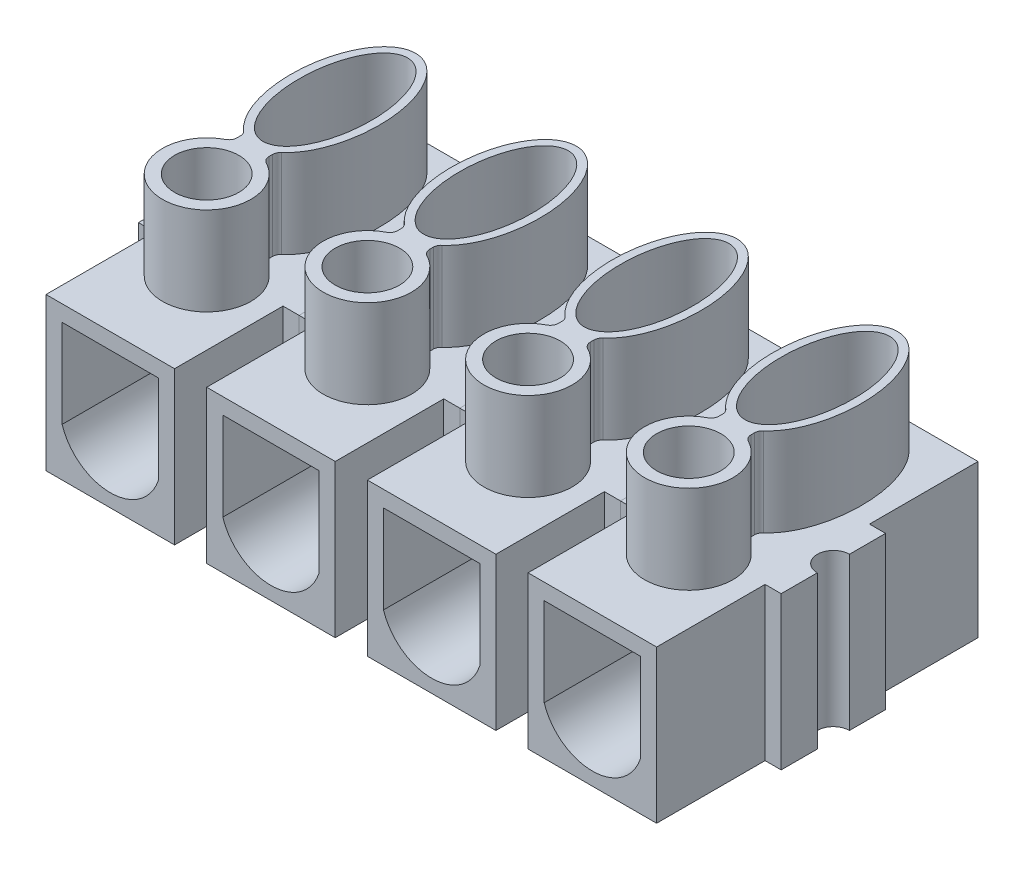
ISO-10303-21;
HEADER;
FILE_DESCRIPTION(('STEP AP214'),'2;1');
FILE_NAME('part.step','',(''),(''),'','','');
FILE_SCHEMA(('AUTOMOTIVE_DESIGN { 1 0 10303 214 1 1 1 1 }'));
ENDSEC;
DATA;
#1=APPLICATION_CONTEXT('core data for automotive mechanical design processes');
#2=APPLICATION_PROTOCOL_DEFINITION('international standard','automotive_design',2000,#1);
#3=PRODUCT_CONTEXT('',#1,'mechanical');
#4=PRODUCT('Part','Part','',(#3));
#5=PRODUCT_RELATED_PRODUCT_CATEGORY('part','',(#4));
#6=PRODUCT_DEFINITION_FORMATION('','',#4);
#7=PRODUCT_DEFINITION_CONTEXT('part definition',#1,'design');
#8=PRODUCT_DEFINITION('design','',#6,#7);
#9=PRODUCT_DEFINITION_SHAPE('','',#8);
#10=(LENGTH_UNIT() NAMED_UNIT(*) SI_UNIT(.MILLI.,.METRE.));
#11=(NAMED_UNIT(*) PLANE_ANGLE_UNIT() SI_UNIT($,.RADIAN.));
#12=(NAMED_UNIT(*) SI_UNIT($,.STERADIAN.) SOLID_ANGLE_UNIT());
#13=UNCERTAINTY_MEASURE_WITH_UNIT(LENGTH_MEASURE(1.E-05),#10,'distance_accuracy_value','');
#14=(GEOMETRIC_REPRESENTATION_CONTEXT(3) GLOBAL_UNCERTAINTY_ASSIGNED_CONTEXT((#13)) GLOBAL_UNIT_ASSIGNED_CONTEXT((#10,
#11,#12)) REPRESENTATION_CONTEXT('',''));
#15=CARTESIAN_POINT('',(0.,0.,0.));
#16=DIRECTION('',(0.,0.,1.));
#17=DIRECTION('',(1.,0.,0.));
#18=AXIS2_PLACEMENT_3D('',#15,#16,#17);
#19=CARTESIAN_POINT('',(26.,0.,10.));
#20=DIRECTION('',(0.,-1.,0.));
#21=DIRECTION('',(0.,0.,-1.));
#22=AXIS2_PLACEMENT_3D('',#19,#20,#21);
#23=PLANE('',#22);
#24=DIRECTION('',(0.,0.,1.));
#25=VECTOR('',#24,1.);
#26=CARTESIAN_POINT('',(25.,0.,3.25));
#27=LINE('',#26,#25);
#28=CARTESIAN_POINT('',(25.,0.,-3.25));
#29=VERTEX_POINT('',#28);
#30=CARTESIAN_POINT('',(25.,0.,-0.999999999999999));
#31=VERTEX_POINT('',#30);
#32=EDGE_CURVE('E248',#29,#31,#27,.T.);
#33=ORIENTED_EDGE('',*,*,#32,.T.);
#34=CARTESIAN_POINT('',(25.,0.,0.));
#35=DIRECTION('',(0.,1.,0.));
#36=DIRECTION('',(0.,0.,-1.));
#37=AXIS2_PLACEMENT_3D('',#34,#35,#36);
#38=CIRCLE('',#37,1.);
#39=CARTESIAN_POINT('',(25.,0.,1.));
#40=VERTEX_POINT('',#39);
#41=EDGE_CURVE('E231',#40,#31,#38,.T.);
#42=ORIENTED_EDGE('',*,*,#41,.F.);
#43=CARTESIAN_POINT('',(25.,0.,3.25));
#44=VERTEX_POINT('',#43);
#45=EDGE_CURVE('E245',#40,#44,#27,.T.);
#46=ORIENTED_EDGE('',*,*,#45,.T.);
#47=DIRECTION('',(1.,0.,0.));
#48=VECTOR('',#47,1.);
#49=CARTESIAN_POINT('',(25.,0.,3.25));
#50=LINE('',#49,#48);
#51=CARTESIAN_POINT('',(26.,0.,3.25));
#52=VERTEX_POINT('',#51);
#53=EDGE_CURVE('E277',#44,#52,#50,.T.);
#54=ORIENTED_EDGE('',*,*,#53,.T.);
#55=DIRECTION('',(0.,0.,-1.));
#56=VECTOR('',#55,1.);
#57=CARTESIAN_POINT('',(26.,0.,10.));
#58=LINE('',#57,#56);
#59=CARTESIAN_POINT('',(26.,0.,10.));
#60=VERTEX_POINT('',#59);
#61=EDGE_CURVE('E317',#60,#52,#58,.T.);
#62=ORIENTED_EDGE('',*,*,#61,.F.);
#63=DIRECTION('',(-1.,0.,0.));
#64=VECTOR('',#63,1.);
#65=CARTESIAN_POINT('',(26.,0.,10.));
#66=LINE('',#65,#64);
#67=CARTESIAN_POINT('',(34.,0.,10.));
#68=VERTEX_POINT('',#67);
#69=EDGE_CURVE('E311',#68,#60,#66,.T.);
#70=ORIENTED_EDGE('',*,*,#69,.F.);
#71=DIRECTION('',(0.,0.,-1.));
#72=VECTOR('',#71,1.);
#73=CARTESIAN_POINT('',(34.,0.,10.));
#74=LINE('',#73,#72);
#75=CARTESIAN_POINT('',(34.,0.,3.25));
#76=VERTEX_POINT('',#75);
#77=EDGE_CURVE('E299',#68,#76,#74,.T.);
#78=ORIENTED_EDGE('',*,*,#77,.T.);
#79=DIRECTION('',(-1.,0.,0.));
#80=VECTOR('',#79,1.);
#81=CARTESIAN_POINT('',(35.,0.,3.25));
#82=LINE('',#81,#80);
#83=CARTESIAN_POINT('',(35.,0.,3.25));
#84=VERTEX_POINT('',#83);
#85=EDGE_CURVE('E280',#84,#76,#82,.T.);
#86=ORIENTED_EDGE('',*,*,#85,.F.);
#87=DIRECTION('',(0.,0.,1.));
#88=VECTOR('',#87,1.);
#89=CARTESIAN_POINT('',(35.,0.,3.25));
#90=LINE('',#89,#88);
#91=CARTESIAN_POINT('',(35.,0.,1.));
#92=VERTEX_POINT('',#91);
#93=EDGE_CURVE('E383',#92,#84,#90,.T.);
#94=ORIENTED_EDGE('',*,*,#93,.F.);
#95=CARTESIAN_POINT('',(35.,0.,0.));
#96=DIRECTION('',(0.,1.,0.));
#97=DIRECTION('',(0.,0.,1.));
#98=AXIS2_PLACEMENT_3D('',#95,#96,#97);
#99=CIRCLE('',#98,1.);
#100=CARTESIAN_POINT('',(35.,0.,-1.));
#101=VERTEX_POINT('',#100);
#102=EDGE_CURVE('E444',#101,#92,#99,.T.);
#103=ORIENTED_EDGE('',*,*,#102,.F.);
#104=CARTESIAN_POINT('',(35.,0.,-3.25));
#105=VERTEX_POINT('',#104);
#106=EDGE_CURVE('E284',#105,#101,#90,.T.);
#107=ORIENTED_EDGE('',*,*,#106,.F.);
#108=DIRECTION('',(-1.,0.,0.));
#109=VECTOR('',#108,1.);
#110=CARTESIAN_POINT('',(35.,0.,-3.25));
#111=LINE('',#110,#109);
#112=CARTESIAN_POINT('',(34.,0.,-3.25));
#113=VERTEX_POINT('',#112);
#114=EDGE_CURVE('E283',#105,#113,#111,.T.);
#115=ORIENTED_EDGE('',*,*,#114,.T.);
#116=CARTESIAN_POINT('',(34.,0.,-10.));
#117=VERTEX_POINT('',#116);
#118=EDGE_CURVE('E304',#113,#117,#74,.T.);
#119=ORIENTED_EDGE('',*,*,#118,.T.);
#120=DIRECTION('',(-1.,0.,0.));
#121=VECTOR('',#120,1.);
#122=CARTESIAN_POINT('',(26.,0.,-10.));
#123=LINE('',#122,#121);
#124=CARTESIAN_POINT('',(26.,0.,-10.));
#125=VERTEX_POINT('',#124);
#126=EDGE_CURVE('E339',#117,#125,#123,.T.);
#127=ORIENTED_EDGE('',*,*,#126,.T.);
#128=CARTESIAN_POINT('',(26.,0.,-3.25));
#129=VERTEX_POINT('',#128);
#130=EDGE_CURVE('E315',#129,#125,#58,.T.);
#131=ORIENTED_EDGE('',*,*,#130,.F.);
#132=DIRECTION('',(1.,0.,0.));
#133=VECTOR('',#132,1.);
#134=CARTESIAN_POINT('',(25.,0.,-3.25));
#135=LINE('',#134,#133);
#136=EDGE_CURVE('E430',#29,#129,#135,.T.);
#137=ORIENTED_EDGE('',*,*,#136,.F.);
#138=EDGE_LOOP('',(#33,#42,#46,#54,#62,#70,#78,#86,#94,#103,#107,#115,#119,#127,#131,#137));
#139=FACE_BOUND('',#138,.T.);
#140=CARTESIAN_POINT('',(30.,0.,4.));
#141=DIRECTION('',(0.,-1.,0.));
#142=DIRECTION('',(0.,0.,-1.));
#143=AXIS2_PLACEMENT_3D('',#140,#141,#142);
#144=CIRCLE('',#143,2.75);
#145=CARTESIAN_POINT('',(28.7307692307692,0.,1.56041945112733));
#146=VERTEX_POINT('',#145);
#147=CARTESIAN_POINT('',(31.2692307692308,0.,1.56041945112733));
#148=VERTEX_POINT('',#147);
#149=EDGE_CURVE('E239',#146,#148,#144,.F.);
#150=ORIENTED_EDGE('',*,*,#149,.F.);
#151=CARTESIAN_POINT('',(28.5,0.,1.1168593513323));
#152=DIRECTION('',(0.,-1.,0.));
#153=DIRECTION('',(0.,0.,-1.));
#154=AXIS2_PLACEMENT_3D('',#151,#152,#153);
#155=CIRCLE('',#154,0.5);
#156=CARTESIAN_POINT('',(29.,0.,1.1168593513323));
#157=VERTEX_POINT('',#156);
#158=EDGE_CURVE('E474',#146,#157,#155,.F.);
#159=ORIENTED_EDGE('',*,*,#158,.T.);
#160=DIRECTION('',(0.,0.,-1.));
#161=VECTOR('',#160,1.);
#162=CARTESIAN_POINT('',(29.,0.,1.5));
#163=LINE('',#162,#161);
#164=CARTESIAN_POINT('',(29.,0.,0.900582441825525));
#165=VERTEX_POINT('',#164);
#166=EDGE_CURVE('E512',#157,#165,#163,.T.);
#167=ORIENTED_EDGE('',*,*,#166,.T.);
#168=CARTESIAN_POINT('',(28.5,0.,0.900582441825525));
#169=DIRECTION('',(0.,-1.,0.));
#170=DIRECTION('',(0.,0.,-1.));
#171=AXIS2_PLACEMENT_3D('',#168,#169,#170);
#172=CIRCLE('',#171,0.5);
#173=CARTESIAN_POINT('',(28.8257146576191,0.,0.521227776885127));
#174=VERTEX_POINT('',#173);
#175=EDGE_CURVE('E472',#165,#174,#172,.F.);
#176=ORIENTED_EDGE('',*,*,#175,.T.);
#177=CARTESIAN_POINT('',(30.,0.,-4.));
#178=DIRECTION('',(0.,1.,0.));
#179=DIRECTION('',(0.,0.,1.));
#180=AXIS2_PLACEMENT_3D('',#177,#178,#179);
#181=ELLIPSE('',#180,5.,2.75);
#182=CARTESIAN_POINT('',(31.1742853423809,0.,0.521227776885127));
#183=VERTEX_POINT('',#182);
#184=EDGE_CURVE('E455',#183,#174,#181,.T.);
#185=ORIENTED_EDGE('',*,*,#184,.F.);
#186=CARTESIAN_POINT('',(31.5,0.,0.900582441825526));
#187=DIRECTION('',(0.,-1.,0.));
#188=DIRECTION('',(0.,0.,-1.));
#189=AXIS2_PLACEMENT_3D('',#186,#187,#188);
#190=CIRCLE('',#189,0.5);
#191=CARTESIAN_POINT('',(31.,0.,0.900582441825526));
#192=VERTEX_POINT('',#191);
#193=EDGE_CURVE('E470',#183,#192,#190,.F.);
#194=ORIENTED_EDGE('',*,*,#193,.T.);
#195=DIRECTION('',(0.,0.,-1.));
#196=VECTOR('',#195,1.);
#197=CARTESIAN_POINT('',(31.,0.,1.5));
#198=LINE('',#197,#196);
#199=CARTESIAN_POINT('',(31.,0.,1.1168593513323));
#200=VERTEX_POINT('',#199);
#201=EDGE_CURVE('E508',#200,#192,#198,.T.);
#202=ORIENTED_EDGE('',*,*,#201,.F.);
#203=CARTESIAN_POINT('',(31.5,0.,1.1168593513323));
#204=DIRECTION('',(0.,-1.,0.));
#205=DIRECTION('',(0.,0.,-1.));
#206=AXIS2_PLACEMENT_3D('',#203,#204,#205);
#207=CIRCLE('',#206,0.5);
#208=EDGE_CURVE('E468',#200,#148,#207,.F.);
#209=ORIENTED_EDGE('',*,*,#208,.T.);
#210=EDGE_LOOP('',(#150,#159,#167,#176,#185,#194,#202,#209));
#211=FACE_BOUND('',#210,.T.);
#212=ADVANCED_FACE('F44',(#139,#211),#23,.F.);
#213=CARTESIAN_POINT('',(30.,5.5,4.));
#214=DIRECTION('',(0.,-1.,0.));
#215=DIRECTION('',(0.,0.,-1.));
#216=AXIS2_PLACEMENT_3D('',#213,#214,#215);
#217=CYLINDRICAL_SURFACE('',#216,2.75);
#218=CARTESIAN_POINT('',(30.,5.5,4.));
#219=DIRECTION('',(0.,1.,0.));
#220=DIRECTION('',(0.,0.,1.));
#221=AXIS2_PLACEMENT_3D('',#218,#219,#220);
#222=CIRCLE('',#221,2.75);
#223=CARTESIAN_POINT('',(28.7307692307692,5.5,1.56041945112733));
#224=VERTEX_POINT('',#223);
#225=CARTESIAN_POINT('',(31.2692307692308,5.5,1.56041945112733));
#226=VERTEX_POINT('',#225);
#227=EDGE_CURVE('E827',#224,#226,#222,.T.);
#228=ORIENTED_EDGE('',*,*,#227,.F.);
#229=DIRECTION('',(0.,-1.,0.));
#230=VECTOR('',#229,1.);
#231=CARTESIAN_POINT('',(28.7307692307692,5.5,1.56041945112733));
#232=LINE('',#231,#230);
#233=EDGE_CURVE('E466',#224,#146,#232,.T.);
#234=ORIENTED_EDGE('',*,*,#233,.T.);
#235=ORIENTED_EDGE('',*,*,#149,.T.);
#236=DIRECTION('',(0.,-1.,0.));
#237=VECTOR('',#236,1.);
#238=CARTESIAN_POINT('',(31.2692307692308,5.5,1.56041945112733));
#239=LINE('',#238,#237);
#240=EDGE_CURVE('E464',#148,#226,#239,.F.);
#241=ORIENTED_EDGE('',*,*,#240,.T.);
#242=EDGE_LOOP('',(#228,#234,#235,#241));
#243=FACE_BOUND('',#242,.T.);
#244=ADVANCED_FACE('F538',(#243),#217,.T.);
#245=CARTESIAN_POINT('',(30.,5.5,-4.));
#246=DIRECTION('',(0.,1.,0.));
#247=DIRECTION('',(0.,0.,1.));
#248=AXIS2_PLACEMENT_3D('',#245,#246,#247);
#249=ELLIPSE('',#248,5.,2.75);
#250=DIRECTION('',(0.,-1.,0.));
#251=VECTOR('',#250,1.);
#252=SURFACE_OF_LINEAR_EXTRUSION('',#249,#251);
#253=ORIENTED_EDGE('',*,*,#184,.T.);
#254=DIRECTION('',(0.,-1.,0.));
#255=VECTOR('',#254,1.);
#256=CARTESIAN_POINT('',(28.8257146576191,0.,0.521227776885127));
#257=LINE('',#256,#255);
#258=CARTESIAN_POINT('',(28.8257146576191,5.5,0.521227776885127));
#259=VERTEX_POINT('',#258);
#260=EDGE_CURVE('E478',#174,#259,#257,.F.);
#261=ORIENTED_EDGE('',*,*,#260,.T.);
#262=CARTESIAN_POINT('',(31.1742853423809,5.5,0.521227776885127));
#263=VERTEX_POINT('',#262);
#264=EDGE_CURVE('E493',#263,#259,#249,.T.);
#265=ORIENTED_EDGE('',*,*,#264,.F.);
#266=DIRECTION('',(0.,-1.,0.));
#267=VECTOR('',#266,1.);
#268=CARTESIAN_POINT('',(31.1742853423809,5.5,0.521227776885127));
#269=LINE('',#268,#267);
#270=EDGE_CURVE('E476',#263,#183,#269,.T.);
#271=ORIENTED_EDGE('',*,*,#270,.T.);
#272=EDGE_LOOP('',(#253,#261,#265,#271));
#273=FACE_BOUND('',#272,.T.);
#274=ADVANCED_FACE('F497',(#273),#252,.F.);
#275=CARTESIAN_POINT('',(30.,0.,-4.));
#276=DIRECTION('',(0.,1.,0.));
#277=DIRECTION('',(0.,0.,1.));
#278=AXIS2_PLACEMENT_3D('',#275,#276,#277);
#279=ELLIPSE('',#278,4.5,2.25);
#280=CARTESIAN_POINT('',(30.,0.,0.5));
#281=VERTEX_POINT('',#280);
#282=EDGE_CURVE('E515',#281,#281,#279,.T.);
#283=ORIENTED_EDGE('',*,*,#282,.T.);
#284=EDGE_LOOP('',(#283));
#285=FACE_BOUND('',#284,.T.);
#286=CARTESIAN_POINT('',(30.,0.,-4.));
#287=DIRECTION('',(0.,1.,0.));
#288=DIRECTION('',(0.,0.,1.));
#289=AXIS2_PLACEMENT_3D('',#286,#287,#288);
#290=CIRCLE('',#289,2.);
#291=CARTESIAN_POINT('',(30.,0.,-2.));
#292=VERTEX_POINT('',#291);
#293=EDGE_CURVE('E452',#292,#292,#290,.T.);
#294=ORIENTED_EDGE('',*,*,#293,.F.);
#295=EDGE_LOOP('',(#294));
#296=FACE_BOUND('',#295,.T.);
#297=ADVANCED_FACE('F537',(#285,#296),#23,.F.);
#298=CARTESIAN_POINT('',(25.,0.,3.25));
#299=DIRECTION('',(-1.,0.,0.));
#300=DIRECTION('',(0.,1.,0.));
#301=AXIS2_PLACEMENT_3D('',#298,#299,#300);
#302=PLANE('',#301);
#303=DIRECTION('',(0.,1.,0.));
#304=VECTOR('',#303,1.);
#305=CARTESIAN_POINT('',(25.,-9.50005,1.));
#306=LINE('',#305,#304);
#307=CARTESIAN_POINT('',(25.,-9.5,1.));
#308=VERTEX_POINT('',#307);
#309=EDGE_CURVE('E228',#308,#40,#306,.T.);
#310=ORIENTED_EDGE('',*,*,#309,.F.);
#311=DIRECTION('',(0.,0.,-1.));
#312=VECTOR('',#311,1.);
#313=CARTESIAN_POINT('',(25.,-9.5,3.25));
#314=LINE('',#313,#312);
#315=CARTESIAN_POINT('',(25.,-9.5,3.25));
#316=VERTEX_POINT('',#315);
#317=EDGE_CURVE('E264',#316,#308,#314,.T.);
#318=ORIENTED_EDGE('',*,*,#317,.F.);
#319=DIRECTION('',(0.,-1.,0.));
#320=VECTOR('',#319,1.);
#321=CARTESIAN_POINT('',(25.,0.,3.25));
#322=LINE('',#321,#320);
#323=EDGE_CURVE('E254',#44,#316,#322,.T.);
#324=ORIENTED_EDGE('',*,*,#323,.F.);
#325=ORIENTED_EDGE('',*,*,#45,.F.);
#326=EDGE_LOOP('',(#310,#318,#324,#325));
#327=FACE_BOUND('',#326,.T.);
#328=ADVANCED_FACE('F252',(#327),#302,.T.);
#329=CARTESIAN_POINT('',(35.,0.,3.25));
#330=DIRECTION('',(1.,0.,0.));
#331=DIRECTION('',(0.,1.,0.));
#332=AXIS2_PLACEMENT_3D('',#329,#330,#331);
#333=PLANE('',#332);
#334=DIRECTION('',(0.,1.,0.));
#335=VECTOR('',#334,1.);
#336=CARTESIAN_POINT('',(35.,-9.50005,-1.));
#337=LINE('',#336,#335);
#338=CARTESIAN_POINT('',(35.,-9.5,-1.));
#339=VERTEX_POINT('',#338);
#340=EDGE_CURVE('E440',#339,#101,#337,.T.);
#341=ORIENTED_EDGE('',*,*,#340,.F.);
#342=DIRECTION('',(0.,0.,-1.));
#343=VECTOR('',#342,1.);
#344=CARTESIAN_POINT('',(35.,-9.5,3.25));
#345=LINE('',#344,#343);
#346=CARTESIAN_POINT('',(35.,-9.5,-3.25));
#347=VERTEX_POINT('',#346);
#348=EDGE_CURVE('E387',#339,#347,#345,.T.);
#349=ORIENTED_EDGE('',*,*,#348,.T.);
#350=DIRECTION('',(0.,1.,0.));
#351=VECTOR('',#350,1.);
#352=CARTESIAN_POINT('',(35.,0.,-3.25));
#353=LINE('',#352,#351);
#354=EDGE_CURVE('E384',#347,#105,#353,.T.);
#355=ORIENTED_EDGE('',*,*,#354,.T.);
#356=ORIENTED_EDGE('',*,*,#106,.T.);
#357=EDGE_LOOP('',(#341,#349,#355,#356));
#358=FACE_BOUND('',#357,.T.);
#359=ADVANCED_FACE('F572',(#358),#333,.T.);
#360=CARTESIAN_POINT('',(26.,0.,10.));
#361=DIRECTION('',(1.,0.,0.));
#362=DIRECTION('',(0.,1.,0.));
#363=AXIS2_PLACEMENT_3D('',#360,#361,#362);
#364=PLANE('',#363);
#365=ORIENTED_EDGE('',*,*,#61,.T.);
#366=DIRECTION('',(0.,-1.,0.));
#367=VECTOR('',#366,1.);
#368=CARTESIAN_POINT('',(26.,0.,3.25));
#369=LINE('',#368,#367);
#370=CARTESIAN_POINT('',(26.,-9.5,3.25));
#371=VERTEX_POINT('',#370);
#372=EDGE_CURVE('E429',#52,#371,#369,.T.);
#373=ORIENTED_EDGE('',*,*,#372,.T.);
#374=DIRECTION('',(0.,0.,-1.));
#375=VECTOR('',#374,1.);
#376=CARTESIAN_POINT('',(26.,-9.5,10.));
#377=LINE('',#376,#375);
#378=CARTESIAN_POINT('',(26.,-9.5,10.));
#379=VERTEX_POINT('',#378);
#380=EDGE_CURVE('E287',#379,#371,#377,.T.);
#381=ORIENTED_EDGE('',*,*,#380,.F.);
#382=DIRECTION('',(0.,-1.,0.));
#383=VECTOR('',#382,1.);
#384=CARTESIAN_POINT('',(26.,0.,10.));
#385=LINE('',#384,#383);
#386=EDGE_CURVE('E335',#60,#379,#385,.T.);
#387=ORIENTED_EDGE('',*,*,#386,.F.);
#388=EDGE_LOOP('',(#365,#373,#381,#387));
#389=FACE_BOUND('',#388,.T.);
#390=ADVANCED_FACE('F422',(#389),#364,.F.);
#391=CARTESIAN_POINT('',(34.,0.,10.));
#392=DIRECTION('',(-1.,0.,0.));
#393=DIRECTION('',(0.,-1.,0.));
#394=AXIS2_PLACEMENT_3D('',#391,#392,#393);
#395=PLANE('',#394);
#396=DIRECTION('',(0.,-1.,0.));
#397=VECTOR('',#396,1.);
#398=CARTESIAN_POINT('',(34.,0.,3.25));
#399=LINE('',#398,#397);
#400=CARTESIAN_POINT('',(34.,-9.5,3.25));
#401=VERTEX_POINT('',#400);
#402=EDGE_CURVE('E272',#76,#401,#399,.T.);
#403=ORIENTED_EDGE('',*,*,#402,.F.);
#404=ORIENTED_EDGE('',*,*,#77,.F.);
#405=DIRECTION('',(0.,1.,0.));
#406=VECTOR('',#405,1.);
#407=CARTESIAN_POINT('',(34.,0.,10.));
#408=LINE('',#407,#406);
#409=CARTESIAN_POINT('',(34.,-9.5,10.));
#410=VERTEX_POINT('',#409);
#411=EDGE_CURVE('E328',#410,#68,#408,.T.);
#412=ORIENTED_EDGE('',*,*,#411,.F.);
#413=DIRECTION('',(0.,0.,-1.));
#414=VECTOR('',#413,1.);
#415=CARTESIAN_POINT('',(34.,-9.5,10.));
#416=LINE('',#415,#414);
#417=EDGE_CURVE('E412',#410,#401,#416,.T.);
#418=ORIENTED_EDGE('',*,*,#417,.T.);
#419=EDGE_LOOP('',(#403,#404,#412,#418));
#420=FACE_BOUND('',#419,.T.);
#421=ADVANCED_FACE('F418',(#420),#395,.F.);
#422=DIRECTION('',(0.,1.,0.));
#423=VECTOR('',#422,1.);
#424=CARTESIAN_POINT('',(34.,0.,-3.25));
#425=LINE('',#424,#423);
#426=CARTESIAN_POINT('',(34.,-9.5,-3.25));
#427=VERTEX_POINT('',#426);
#428=EDGE_CURVE('E276',#427,#113,#425,.T.);
#429=ORIENTED_EDGE('',*,*,#428,.F.);
#430=CARTESIAN_POINT('',(34.,-9.5,-10.));
#431=VERTEX_POINT('',#430);
#432=EDGE_CURVE('E303',#427,#431,#416,.T.);
#433=ORIENTED_EDGE('',*,*,#432,.T.);
#434=DIRECTION('',(0.,1.,0.));
#435=VECTOR('',#434,1.);
#436=CARTESIAN_POINT('',(34.,0.,-10.));
#437=LINE('',#436,#435);
#438=EDGE_CURVE('E341',#431,#117,#437,.T.);
#439=ORIENTED_EDGE('',*,*,#438,.T.);
#440=ORIENTED_EDGE('',*,*,#118,.F.);
#441=EDGE_LOOP('',(#429,#433,#439,#440));
#442=FACE_BOUND('',#441,.T.);
#443=ADVANCED_FACE('F599',(#442),#395,.F.);
#444=CARTESIAN_POINT('',(26.,-9.5,10.));
#445=DIRECTION('',(0.,0.,1.));
#446=DIRECTION('',(1.,0.,0.));
#447=AXIS2_PLACEMENT_3D('',#444,#445,#446);
#448=PLANE('',#447);
#449=ORIENTED_EDGE('',*,*,#386,.T.);
#450=DIRECTION('',(1.,0.,0.));
#451=VECTOR('',#450,1.);
#452=CARTESIAN_POINT('',(26.,-9.5,10.));
#453=LINE('',#452,#451);
#454=EDGE_CURVE('E332',#379,#410,#453,.T.);
#455=ORIENTED_EDGE('',*,*,#454,.T.);
#456=ORIENTED_EDGE('',*,*,#411,.T.);
#457=ORIENTED_EDGE('',*,*,#69,.T.);
#458=EDGE_LOOP('',(#449,#455,#456,#457));
#459=FACE_BOUND('',#458,.T.);
#460=CARTESIAN_POINT('',(30.0012966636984,-5.53549064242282,10.));
#461=DIRECTION('',(0.,0.,1.));
#462=DIRECTION('',(1.,0.,0.));
#463=AXIS2_PLACEMENT_3D('',#460,#461,#462);
#464=CIRCLE('',#463,3.15);
#465=CARTESIAN_POINT('',(27.0025933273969,-6.5,10.));
#466=VERTEX_POINT('',#465);
#467=CARTESIAN_POINT('',(33.,-6.5,10.));
#468=VERTEX_POINT('',#467);
#469=EDGE_CURVE('E364',#466,#468,#464,.T.);
#470=ORIENTED_EDGE('',*,*,#469,.F.);
#471=DIRECTION('',(0.,-1.,0.));
#472=VECTOR('',#471,1.);
#473=CARTESIAN_POINT('',(27.0025933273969,-1.,10.));
#474=LINE('',#473,#472);
#475=CARTESIAN_POINT('',(27.0025933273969,-1.,10.));
#476=VERTEX_POINT('',#475);
#477=EDGE_CURVE('E366',#476,#466,#474,.T.);
#478=ORIENTED_EDGE('',*,*,#477,.F.);
#479=DIRECTION('',(-1.,0.,0.));
#480=VECTOR('',#479,1.);
#481=CARTESIAN_POINT('',(27.0025933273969,-1.,10.));
#482=LINE('',#481,#480);
#483=CARTESIAN_POINT('',(33.,-0.999999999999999,10.));
#484=VERTEX_POINT('',#483);
#485=EDGE_CURVE('E359',#484,#476,#482,.T.);
#486=ORIENTED_EDGE('',*,*,#485,.F.);
#487=DIRECTION('',(0.,1.,0.));
#488=VECTOR('',#487,1.);
#489=CARTESIAN_POINT('',(33.,-1.,10.));
#490=LINE('',#489,#488);
#491=EDGE_CURVE('E361',#468,#484,#490,.T.);
#492=ORIENTED_EDGE('',*,*,#491,.F.);
#493=EDGE_LOOP('',(#470,#478,#486,#492));
#494=FACE_BOUND('',#493,.T.);
#495=ADVANCED_FACE('F423',(#459,#494),#448,.T.);
#496=CARTESIAN_POINT('',(26.,-9.5,-10.));
#497=DIRECTION('',(0.,0.,1.));
#498=DIRECTION('',(1.,0.,0.));
#499=AXIS2_PLACEMENT_3D('',#496,#497,#498);
#500=PLANE('',#499);
#501=DIRECTION('',(0.,-1.,0.));
#502=VECTOR('',#501,1.);
#503=CARTESIAN_POINT('',(26.,0.,-10.));
#504=LINE('',#503,#502);
#505=CARTESIAN_POINT('',(26.,-9.5,-10.));
#506=VERTEX_POINT('',#505);
#507=EDGE_CURVE('E347',#125,#506,#504,.T.);
#508=ORIENTED_EDGE('',*,*,#507,.F.);
#509=ORIENTED_EDGE('',*,*,#126,.F.);
#510=ORIENTED_EDGE('',*,*,#438,.F.);
#511=DIRECTION('',(1.,0.,0.));
#512=VECTOR('',#511,1.);
#513=CARTESIAN_POINT('',(26.,-9.5,-10.));
#514=LINE('',#513,#512);
#515=EDGE_CURVE('E344',#506,#431,#514,.T.);
#516=ORIENTED_EDGE('',*,*,#515,.F.);
#517=EDGE_LOOP('',(#508,#509,#510,#516));
#518=FACE_BOUND('',#517,.T.);
#519=DIRECTION('',(0.,-1.,0.));
#520=VECTOR('',#519,1.);
#521=CARTESIAN_POINT('',(27.0025933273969,-1.,-10.));
#522=LINE('',#521,#520);
#523=CARTESIAN_POINT('',(27.0025933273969,-0.999999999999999,-10.));
#524=VERTEX_POINT('',#523);
#525=CARTESIAN_POINT('',(27.0025933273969,-6.5,-10.));
#526=VERTEX_POINT('',#525);
#527=EDGE_CURVE('E377',#524,#526,#522,.T.);
#528=ORIENTED_EDGE('',*,*,#527,.T.);
#529=CARTESIAN_POINT('',(30.0012966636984,-5.53549064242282,-10.));
#530=DIRECTION('',(0.,0.,1.));
#531=DIRECTION('',(1.,0.,0.));
#532=AXIS2_PLACEMENT_3D('',#529,#530,#531);
#533=CIRCLE('',#532,3.15);
#534=CARTESIAN_POINT('',(33.,-6.5,-10.));
#535=VERTEX_POINT('',#534);
#536=EDGE_CURVE('E374',#526,#535,#533,.T.);
#537=ORIENTED_EDGE('',*,*,#536,.T.);
#538=DIRECTION('',(0.,1.,0.));
#539=VECTOR('',#538,1.);
#540=CARTESIAN_POINT('',(33.,-1.,-10.));
#541=LINE('',#540,#539);
#542=CARTESIAN_POINT('',(33.,-1.,-10.));
#543=VERTEX_POINT('',#542);
#544=EDGE_CURVE('E371',#535,#543,#541,.T.);
#545=ORIENTED_EDGE('',*,*,#544,.T.);
#546=DIRECTION('',(-1.,0.,0.));
#547=VECTOR('',#546,1.);
#548=CARTESIAN_POINT('',(27.0025933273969,-1.,-10.));
#549=LINE('',#548,#547);
#550=EDGE_CURVE('E368',#543,#524,#549,.T.);
#551=ORIENTED_EDGE('',*,*,#550,.T.);
#552=EDGE_LOOP('',(#528,#537,#545,#551));
#553=FACE_BOUND('',#552,.T.);
#554=ADVANCED_FACE('F593',(#518,#553),#500,.F.);
#555=CARTESIAN_POINT('',(26.,-9.5,-3.25));
#556=VERTEX_POINT('',#555);
#557=EDGE_CURVE('E292',#556,#506,#377,.T.);
#558=ORIENTED_EDGE('',*,*,#557,.F.);
#559=DIRECTION('',(0.,1.,0.));
#560=VECTOR('',#559,1.);
#561=CARTESIAN_POINT('',(26.,0.,-3.25));
#562=LINE('',#561,#560);
#563=EDGE_CURVE('E257',#556,#129,#562,.T.);
#564=ORIENTED_EDGE('',*,*,#563,.T.);
#565=ORIENTED_EDGE('',*,*,#130,.T.);
#566=ORIENTED_EDGE('',*,*,#507,.T.);
#567=EDGE_LOOP('',(#558,#564,#565,#566));
#568=FACE_BOUND('',#567,.T.);
#569=ADVANCED_FACE('F46',(#568),#364,.F.);
#570=CARTESIAN_POINT('',(26.,-9.5,10.));
#571=DIRECTION('',(0.,1.,0.));
#572=DIRECTION('',(0.,0.,1.));
#573=AXIS2_PLACEMENT_3D('',#570,#571,#572);
#574=PLANE('',#573);
#575=ORIENTED_EDGE('',*,*,#317,.T.);
#576=CARTESIAN_POINT('',(25.,-9.5,0.));
#577=DIRECTION('',(0.,1.,0.));
#578=DIRECTION('',(0.,0.,1.));
#579=AXIS2_PLACEMENT_3D('',#576,#577,#578);
#580=CIRCLE('',#579,1.);
#581=CARTESIAN_POINT('',(25.,-9.5,-1.));
#582=VERTEX_POINT('',#581);
#583=EDGE_CURVE('E234',#308,#582,#580,.T.);
#584=ORIENTED_EDGE('',*,*,#583,.T.);
#585=CARTESIAN_POINT('',(25.,-9.5,-3.25));
#586=VERTEX_POINT('',#585);
#587=EDGE_CURVE('E263',#582,#586,#314,.T.);
#588=ORIENTED_EDGE('',*,*,#587,.T.);
#589=DIRECTION('',(1.,0.,0.));
#590=VECTOR('',#589,1.);
#591=CARTESIAN_POINT('',(25.,-9.5,-3.25));
#592=LINE('',#591,#590);
#593=EDGE_CURVE('E426',#586,#556,#592,.T.);
#594=ORIENTED_EDGE('',*,*,#593,.T.);
#595=ORIENTED_EDGE('',*,*,#557,.T.);
#596=ORIENTED_EDGE('',*,*,#515,.T.);
#597=ORIENTED_EDGE('',*,*,#432,.F.);
#598=DIRECTION('',(-1.,0.,0.));
#599=VECTOR('',#598,1.);
#600=CARTESIAN_POINT('',(35.,-9.5,-3.25));
#601=LINE('',#600,#599);
#602=EDGE_CURVE('E403',#347,#427,#601,.T.);
#603=ORIENTED_EDGE('',*,*,#602,.F.);
#604=ORIENTED_EDGE('',*,*,#348,.F.);
#605=CARTESIAN_POINT('',(35.,-9.5,0.));
#606=DIRECTION('',(0.,1.,0.));
#607=DIRECTION('',(0.,0.,1.));
#608=AXIS2_PLACEMENT_3D('',#605,#606,#607);
#609=CIRCLE('',#608,1.);
#610=CARTESIAN_POINT('',(35.,-9.5,1.));
#611=VERTEX_POINT('',#610);
#612=EDGE_CURVE('E442',#339,#611,#609,.T.);
#613=ORIENTED_EDGE('',*,*,#612,.T.);
#614=CARTESIAN_POINT('',(35.,-9.5,3.25));
#615=VERTEX_POINT('',#614);
#616=EDGE_CURVE('E386',#615,#611,#345,.T.);
#617=ORIENTED_EDGE('',*,*,#616,.F.);
#618=DIRECTION('',(-1.,0.,0.));
#619=VECTOR('',#618,1.);
#620=CARTESIAN_POINT('',(35.,-9.5,3.25));
#621=LINE('',#620,#619);
#622=EDGE_CURVE('E380',#615,#401,#621,.T.);
#623=ORIENTED_EDGE('',*,*,#622,.T.);
#624=ORIENTED_EDGE('',*,*,#417,.F.);
#625=ORIENTED_EDGE('',*,*,#454,.F.);
#626=ORIENTED_EDGE('',*,*,#380,.T.);
#627=DIRECTION('',(1.,0.,0.));
#628=VECTOR('',#627,1.);
#629=CARTESIAN_POINT('',(25.,-9.5,3.25));
#630=LINE('',#629,#628);
#631=EDGE_CURVE('E266',#316,#371,#630,.T.);
#632=ORIENTED_EDGE('',*,*,#631,.F.);
#633=EDGE_LOOP('',(#575,#584,#588,#594,#595,#596,#597,#603,#604,#613,#617,#623,#624,#625,#626,#632));
#634=FACE_BOUND('',#633,.T.);
#635=ADVANCED_FACE('F411',(#634),#574,.F.);
#636=CARTESIAN_POINT('',(27.0025933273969,-1.,10.));
#637=DIRECTION('',(1.,0.,0.));
#638=DIRECTION('',(0.,1.,0.));
#639=AXIS2_PLACEMENT_3D('',#636,#637,#638);
#640=PLANE('',#639);
#641=ORIENTED_EDGE('',*,*,#527,.F.);
#642=DIRECTION('',(0.,0.,-1.));
#643=VECTOR('',#642,1.);
#644=CARTESIAN_POINT('',(27.0025933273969,-1.,10.));
#645=LINE('',#644,#643);
#646=EDGE_CURVE('E356',#476,#524,#645,.T.);
#647=ORIENTED_EDGE('',*,*,#646,.F.);
#648=ORIENTED_EDGE('',*,*,#477,.T.);
#649=DIRECTION('',(0.,0.,-1.));
#650=VECTOR('',#649,1.);
#651=CARTESIAN_POINT('',(27.0025933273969,-6.5,10.));
#652=LINE('',#651,#650);
#653=EDGE_CURVE('E349',#466,#526,#652,.T.);
#654=ORIENTED_EDGE('',*,*,#653,.T.);
#655=EDGE_LOOP('',(#641,#647,#648,#654));
#656=FACE_BOUND('',#655,.T.);
#657=ADVANCED_FACE('F588',(#656),#640,.T.);
#658=CARTESIAN_POINT('',(30.0012966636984,-5.53549064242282,10.));
#659=DIRECTION('',(0.,0.,-1.));
#660=DIRECTION('',(-1.,0.,0.));
#661=AXIS2_PLACEMENT_3D('',#658,#659,#660);
#662=CYLINDRICAL_SURFACE('',#661,3.15);
#663=ORIENTED_EDGE('',*,*,#536,.F.);
#664=ORIENTED_EDGE('',*,*,#653,.F.);
#665=ORIENTED_EDGE('',*,*,#469,.T.);
#666=DIRECTION('',(0.,0.,-1.));
#667=VECTOR('',#666,1.);
#668=CARTESIAN_POINT('',(33.,-6.5,10.));
#669=LINE('',#668,#667);
#670=EDGE_CURVE('E352',#468,#535,#669,.T.);
#671=ORIENTED_EDGE('',*,*,#670,.T.);
#672=EDGE_LOOP('',(#663,#664,#665,#671));
#673=FACE_BOUND('',#672,.T.);
#674=ADVANCED_FACE('F584',(#673),#662,.F.);
#675=CARTESIAN_POINT('',(33.,-1.,10.));
#676=DIRECTION('',(-1.,0.,0.));
#677=DIRECTION('',(0.,-1.,0.));
#678=AXIS2_PLACEMENT_3D('',#675,#676,#677);
#679=PLANE('',#678);
#680=ORIENTED_EDGE('',*,*,#544,.F.);
#681=ORIENTED_EDGE('',*,*,#670,.F.);
#682=ORIENTED_EDGE('',*,*,#491,.T.);
#683=DIRECTION('',(0.,0.,-1.));
#684=VECTOR('',#683,1.);
#685=CARTESIAN_POINT('',(33.,-1.,10.));
#686=LINE('',#685,#684);
#687=EDGE_CURVE('E354',#484,#543,#686,.T.);
#688=ORIENTED_EDGE('',*,*,#687,.T.);
#689=EDGE_LOOP('',(#680,#681,#682,#688));
#690=FACE_BOUND('',#689,.T.);
#691=ADVANCED_FACE('F580',(#690),#679,.T.);
#692=CARTESIAN_POINT('',(27.0025933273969,-1.,10.));
#693=DIRECTION('',(0.,-1.,0.));
#694=DIRECTION('',(0.,0.,-1.));
#695=AXIS2_PLACEMENT_3D('',#692,#693,#694);
#696=PLANE('',#695);
#697=CARTESIAN_POINT('',(30.,-1.,-4.));
#698=DIRECTION('',(0.,-1.,0.));
#699=DIRECTION('',(0.,0.,-1.));
#700=AXIS2_PLACEMENT_3D('',#697,#698,#699);
#701=CIRCLE('',#700,2.);
#702=CARTESIAN_POINT('',(30.,-1.,-6.));
#703=VERTEX_POINT('',#702);
#704=EDGE_CURVE('E449',#703,#703,#701,.T.);
#705=ORIENTED_EDGE('',*,*,#704,.F.);
#706=EDGE_LOOP('',(#705));
#707=FACE_BOUND('',#706,.T.);
#708=CARTESIAN_POINT('',(30.,-1.,4.));
#709=DIRECTION('',(0.,-1.,0.));
#710=DIRECTION('',(0.,0.,-1.));
#711=AXIS2_PLACEMENT_3D('',#708,#709,#710);
#712=CIRCLE('',#711,2.);
#713=CARTESIAN_POINT('',(30.,-1.,2.));
#714=VERTEX_POINT('',#713);
#715=EDGE_CURVE('E249',#714,#714,#712,.T.);
#716=ORIENTED_EDGE('',*,*,#715,.F.);
#717=EDGE_LOOP('',(#716));
#718=FACE_BOUND('',#717,.T.);
#719=ORIENTED_EDGE('',*,*,#550,.F.);
#720=ORIENTED_EDGE('',*,*,#687,.F.);
#721=ORIENTED_EDGE('',*,*,#485,.T.);
#722=ORIENTED_EDGE('',*,*,#646,.T.);
#723=EDGE_LOOP('',(#719,#720,#721,#722));
#724=FACE_BOUND('',#723,.T.);
#725=ADVANCED_FACE('F577',(#707,#718,#724),#696,.T.);
#726=CARTESIAN_POINT('',(35.,0.,3.25));
#727=DIRECTION('',(0.,0.,-1.));
#728=DIRECTION('',(0.,1.,0.));
#729=AXIS2_PLACEMENT_3D('',#726,#727,#728);
#730=PLANE('',#729);
#731=ORIENTED_EDGE('',*,*,#402,.T.);
#732=ORIENTED_EDGE('',*,*,#622,.F.);
#733=DIRECTION('',(0.,-1.,0.));
#734=VECTOR('',#733,1.);
#735=CARTESIAN_POINT('',(35.,0.,3.25));
#736=LINE('',#735,#734);
#737=EDGE_CURVE('E388',#84,#615,#736,.T.);
#738=ORIENTED_EDGE('',*,*,#737,.F.);
#739=ORIENTED_EDGE('',*,*,#85,.T.);
#740=EDGE_LOOP('',(#731,#732,#738,#739));
#741=FACE_BOUND('',#740,.T.);
#742=ADVANCED_FACE('F415',(#741),#730,.F.);
#743=CARTESIAN_POINT('',(35.,0.,-3.25));
#744=DIRECTION('',(0.,0.,1.));
#745=DIRECTION('',(0.,-1.,0.));
#746=AXIS2_PLACEMENT_3D('',#743,#744,#745);
#747=PLANE('',#746);
#748=ORIENTED_EDGE('',*,*,#428,.T.);
#749=ORIENTED_EDGE('',*,*,#114,.F.);
#750=ORIENTED_EDGE('',*,*,#354,.F.);
#751=ORIENTED_EDGE('',*,*,#602,.T.);
#752=EDGE_LOOP('',(#748,#749,#750,#751));
#753=FACE_BOUND('',#752,.T.);
#754=ADVANCED_FACE('F571',(#753),#747,.F.);
#755=DIRECTION('',(0.,1.,0.));
#756=VECTOR('',#755,1.);
#757=CARTESIAN_POINT('',(35.,-9.50005,1.));
#758=LINE('',#757,#756);
#759=EDGE_CURVE('E291',#92,#611,#758,.F.);
#760=ORIENTED_EDGE('',*,*,#759,.F.);
#761=ORIENTED_EDGE('',*,*,#93,.T.);
#762=ORIENTED_EDGE('',*,*,#737,.T.);
#763=ORIENTED_EDGE('',*,*,#616,.T.);
#764=EDGE_LOOP('',(#760,#761,#762,#763));
#765=FACE_BOUND('',#764,.T.);
#766=ADVANCED_FACE('F568',(#765),#333,.T.);
#767=CARTESIAN_POINT('',(25.,0.,3.25));
#768=DIRECTION('',(0.,0.,1.));
#769=DIRECTION('',(0.,-1.,0.));
#770=AXIS2_PLACEMENT_3D('',#767,#768,#769);
#771=PLANE('',#770);
#772=ORIENTED_EDGE('',*,*,#372,.F.);
#773=ORIENTED_EDGE('',*,*,#53,.F.);
#774=ORIENTED_EDGE('',*,*,#323,.T.);
#775=ORIENTED_EDGE('',*,*,#631,.T.);
#776=EDGE_LOOP('',(#772,#773,#774,#775));
#777=FACE_BOUND('',#776,.T.);
#778=ADVANCED_FACE('F428',(#777),#771,.T.);
#779=CARTESIAN_POINT('',(25.,0.,-3.25));
#780=DIRECTION('',(0.,0.,-1.));
#781=DIRECTION('',(0.,1.,0.));
#782=AXIS2_PLACEMENT_3D('',#779,#780,#781);
#783=PLANE('',#782);
#784=ORIENTED_EDGE('',*,*,#563,.F.);
#785=ORIENTED_EDGE('',*,*,#593,.F.);
#786=DIRECTION('',(0.,1.,0.));
#787=VECTOR('',#786,1.);
#788=CARTESIAN_POINT('',(25.,0.,-3.25));
#789=LINE('',#788,#787);
#790=EDGE_CURVE('E256',#586,#29,#789,.T.);
#791=ORIENTED_EDGE('',*,*,#790,.T.);
#792=ORIENTED_EDGE('',*,*,#136,.T.);
#793=EDGE_LOOP('',(#784,#785,#791,#792));
#794=FACE_BOUND('',#793,.T.);
#795=ADVANCED_FACE('F561',(#794),#783,.T.);
#796=DIRECTION('',(0.,1.,0.));
#797=VECTOR('',#796,1.);
#798=CARTESIAN_POINT('',(25.,-9.50005,-1.));
#799=LINE('',#798,#797);
#800=EDGE_CURVE('E240',#31,#582,#799,.F.);
#801=ORIENTED_EDGE('',*,*,#800,.F.);
#802=ORIENTED_EDGE('',*,*,#32,.F.);
#803=ORIENTED_EDGE('',*,*,#790,.F.);
#804=ORIENTED_EDGE('',*,*,#587,.F.);
#805=EDGE_LOOP('',(#801,#802,#803,#804));
#806=FACE_BOUND('',#805,.T.);
#807=ADVANCED_FACE('F557',(#806),#302,.T.);
#808=CARTESIAN_POINT('',(35.,-9.50005,0.));
#809=DIRECTION('',(0.,1.,0.));
#810=DIRECTION('',(0.,0.,1.));
#811=AXIS2_PLACEMENT_3D('',#808,#809,#810);
#812=CYLINDRICAL_SURFACE('',#811,1.);
#813=ORIENTED_EDGE('',*,*,#340,.T.);
#814=ORIENTED_EDGE('',*,*,#102,.T.);
#815=ORIENTED_EDGE('',*,*,#759,.T.);
#816=ORIENTED_EDGE('',*,*,#612,.F.);
#817=EDGE_LOOP('',(#813,#814,#815,#816));
#818=FACE_BOUND('',#817,.T.);
#819=ADVANCED_FACE('F554',(#818),#812,.F.);
#820=CARTESIAN_POINT('',(25.,-9.50005,0.));
#821=DIRECTION('',(0.,1.,0.));
#822=DIRECTION('',(0.,0.,1.));
#823=AXIS2_PLACEMENT_3D('',#820,#821,#822);
#824=CYLINDRICAL_SURFACE('',#823,1.);
#825=ORIENTED_EDGE('',*,*,#309,.T.);
#826=ORIENTED_EDGE('',*,*,#41,.T.);
#827=ORIENTED_EDGE('',*,*,#800,.T.);
#828=ORIENTED_EDGE('',*,*,#583,.F.);
#829=EDGE_LOOP('',(#825,#826,#827,#828));
#830=FACE_BOUND('',#829,.T.);
#831=ADVANCED_FACE('F230',(#830),#824,.F.);
#832=CARTESIAN_POINT('',(30.,-3.,4.));
#833=DIRECTION('',(0.,1.,0.));
#834=DIRECTION('',(0.,0.,1.));
#835=AXIS2_PLACEMENT_3D('',#832,#833,#834);
#836=CYLINDRICAL_SURFACE('',#835,2.);
#837=ORIENTED_EDGE('',*,*,#715,.T.);
#838=EDGE_LOOP('',(#837));
#839=FACE_BOUND('',#838,.T.);
#840=CARTESIAN_POINT('',(30.,5.5,4.));
#841=DIRECTION('',(0.,1.,0.));
#842=DIRECTION('',(0.,0.,1.));
#843=AXIS2_PLACEMENT_3D('',#840,#841,#842);
#844=CIRCLE('',#843,2.);
#845=CARTESIAN_POINT('',(30.,5.5,6.));
#846=VERTEX_POINT('',#845);
#847=EDGE_CURVE('E500',#846,#846,#844,.T.);
#848=ORIENTED_EDGE('',*,*,#847,.T.);
#849=EDGE_LOOP('',(#848));
#850=FACE_BOUND('',#849,.T.);
#851=ADVANCED_FACE('F547',(#839,#850),#836,.F.);
#852=CARTESIAN_POINT('',(30.,-3.,-4.));
#853=DIRECTION('',(0.,1.,0.));
#854=DIRECTION('',(0.,0.,1.));
#855=AXIS2_PLACEMENT_3D('',#852,#853,#854);
#856=CYLINDRICAL_SURFACE('',#855,2.);
#857=ORIENTED_EDGE('',*,*,#704,.T.);
#858=EDGE_LOOP('',(#857));
#859=FACE_BOUND('',#858,.T.);
#860=ORIENTED_EDGE('',*,*,#293,.T.);
#861=EDGE_LOOP('',(#860));
#862=FACE_BOUND('',#861,.T.);
#863=ADVANCED_FACE('F541',(#859,#862),#856,.F.);
#864=CARTESIAN_POINT('',(30.,5.5,4.));
#865=DIRECTION('',(0.,1.,0.));
#866=DIRECTION('',(0.,0.,1.));
#867=AXIS2_PLACEMENT_3D('',#864,#865,#866);
#868=PLANE('',#867);
#869=DIRECTION('',(0.,0.,-1.));
#870=VECTOR('',#869,1.);
#871=CARTESIAN_POINT('',(29.,5.5,1.5));
#872=LINE('',#871,#870);
#873=CARTESIAN_POINT('',(29.,5.5,1.1168593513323));
#874=VERTEX_POINT('',#873);
#875=CARTESIAN_POINT('',(29.,5.5,0.900582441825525));
#876=VERTEX_POINT('',#875);
#877=EDGE_CURVE('E517',#874,#876,#872,.T.);
#878=ORIENTED_EDGE('',*,*,#877,.F.);
#879=CARTESIAN_POINT('',(28.5,5.5,1.1168593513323));
#880=DIRECTION('',(0.,1.,0.));
#881=DIRECTION('',(0.,0.,1.));
#882=AXIS2_PLACEMENT_3D('',#879,#880,#881);
#883=CIRCLE('',#882,0.5);
#884=EDGE_CURVE('E485',#874,#224,#883,.F.);
#885=ORIENTED_EDGE('',*,*,#884,.T.);
#886=ORIENTED_EDGE('',*,*,#227,.T.);
#887=CARTESIAN_POINT('',(31.5,5.5,1.1168593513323));
#888=DIRECTION('',(0.,1.,0.));
#889=DIRECTION('',(0.,0.,1.));
#890=AXIS2_PLACEMENT_3D('',#887,#888,#889);
#891=CIRCLE('',#890,0.5);
#892=CARTESIAN_POINT('',(31.,5.5,1.1168593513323));
#893=VERTEX_POINT('',#892);
#894=EDGE_CURVE('E12',#226,#893,#891,.F.);
#895=ORIENTED_EDGE('',*,*,#894,.T.);
#896=DIRECTION('',(0.,0.,-1.));
#897=VECTOR('',#896,1.);
#898=CARTESIAN_POINT('',(31.,5.5,1.5));
#899=LINE('',#898,#897);
#900=CARTESIAN_POINT('',(31.,5.5,0.900582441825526));
#901=VERTEX_POINT('',#900);
#902=EDGE_CURVE('E495',#893,#901,#899,.T.);
#903=ORIENTED_EDGE('',*,*,#902,.T.);
#904=CARTESIAN_POINT('',(31.5,5.5,0.900582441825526));
#905=DIRECTION('',(0.,1.,0.));
#906=DIRECTION('',(0.,0.,1.));
#907=AXIS2_PLACEMENT_3D('',#904,#905,#906);
#908=CIRCLE('',#907,0.5);
#909=EDGE_CURVE('E52',#901,#263,#908,.F.);
#910=ORIENTED_EDGE('',*,*,#909,.T.);
#911=ORIENTED_EDGE('',*,*,#264,.T.);
#912=CARTESIAN_POINT('',(28.5,5.5,0.900582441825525));
#913=DIRECTION('',(0.,1.,0.));
#914=DIRECTION('',(0.,0.,1.));
#915=AXIS2_PLACEMENT_3D('',#912,#913,#914);
#916=CIRCLE('',#915,0.5);
#917=EDGE_CURVE('E487',#259,#876,#916,.F.);
#918=ORIENTED_EDGE('',*,*,#917,.T.);
#919=EDGE_LOOP('',(#878,#885,#886,#895,#903,#910,#911,#918));
#920=FACE_BOUND('',#919,.T.);
#921=CARTESIAN_POINT('',(30.,5.5,-4.));
#922=DIRECTION('',(0.,1.,0.));
#923=DIRECTION('',(0.,0.,1.));
#924=AXIS2_PLACEMENT_3D('',#921,#922,#923);
#925=ELLIPSE('',#924,4.5,2.25);
#926=CARTESIAN_POINT('',(30.,5.5,0.5));
#927=VERTEX_POINT('',#926);
#928=EDGE_CURVE('E501',#927,#927,#925,.T.);
#929=ORIENTED_EDGE('',*,*,#928,.F.);
#930=EDGE_LOOP('',(#929));
#931=FACE_BOUND('',#930,.T.);
#932=ORIENTED_EDGE('',*,*,#847,.F.);
#933=EDGE_LOOP('',(#932));
#934=FACE_BOUND('',#933,.T.);
#935=ADVANCED_FACE('F491',(#920,#931,#934),#868,.T.);
#936=DIRECTION('',(0.,-1.,0.));
#937=VECTOR('',#936,1.);
#938=SURFACE_OF_LINEAR_EXTRUSION('',#925,#937);
#939=ORIENTED_EDGE('',*,*,#282,.F.);
#940=EDGE_LOOP('',(#939));
#941=FACE_BOUND('',#940,.T.);
#942=ORIENTED_EDGE('',*,*,#928,.T.);
#943=EDGE_LOOP('',(#942));
#944=FACE_BOUND('',#943,.T.);
#945=ADVANCED_FACE('F528',(#941,#944),#938,.T.);
#946=CARTESIAN_POINT('',(29.,5.5,1.5));
#947=DIRECTION('',(1.,0.,0.));
#948=DIRECTION('',(0.,1.,0.));
#949=AXIS2_PLACEMENT_3D('',#946,#947,#948);
#950=PLANE('',#949);
#951=ORIENTED_EDGE('',*,*,#166,.F.);
#952=DIRECTION('',(0.,1.,0.));
#953=VECTOR('',#952,1.);
#954=CARTESIAN_POINT('',(29.,5.5,1.1168593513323));
#955=LINE('',#954,#953);
#956=EDGE_CURVE('E461',#157,#874,#955,.T.);
#957=ORIENTED_EDGE('',*,*,#956,.T.);
#958=ORIENTED_EDGE('',*,*,#877,.T.);
#959=DIRECTION('',(0.,1.,0.));
#960=VECTOR('',#959,1.);
#961=CARTESIAN_POINT('',(29.,0.,0.900582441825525));
#962=LINE('',#961,#960);
#963=EDGE_CURVE('E458',#876,#165,#962,.F.);
#964=ORIENTED_EDGE('',*,*,#963,.T.);
#965=EDGE_LOOP('',(#951,#957,#958,#964));
#966=FACE_BOUND('',#965,.T.);
#967=ADVANCED_FACE('F532',(#966),#950,.F.);
#968=CARTESIAN_POINT('',(31.,5.5,1.5));
#969=DIRECTION('',(-1.,0.,0.));
#970=DIRECTION('',(0.,-1.,0.));
#971=AXIS2_PLACEMENT_3D('',#968,#969,#970);
#972=PLANE('',#971);
#973=ORIENTED_EDGE('',*,*,#201,.T.);
#974=DIRECTION('',(0.,1.,0.));
#975=VECTOR('',#974,1.);
#976=CARTESIAN_POINT('',(31.,5.5,0.900582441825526));
#977=LINE('',#976,#975);
#978=EDGE_CURVE('E483',#192,#901,#977,.T.);
#979=ORIENTED_EDGE('',*,*,#978,.T.);
#980=ORIENTED_EDGE('',*,*,#902,.F.);
#981=DIRECTION('',(0.,1.,0.));
#982=VECTOR('',#981,1.);
#983=CARTESIAN_POINT('',(31.,0.,1.1168593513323));
#984=LINE('',#983,#982);
#985=EDGE_CURVE('E480',#893,#200,#984,.F.);
#986=ORIENTED_EDGE('',*,*,#985,.T.);
#987=EDGE_LOOP('',(#973,#979,#980,#986));
#988=FACE_BOUND('',#987,.T.);
#989=ADVANCED_FACE('F510',(#988),#972,.F.);
#990=CARTESIAN_POINT('',(28.5,5.5,1.1168593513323));
#991=DIRECTION('',(0.,-1.,0.));
#992=DIRECTION('',(0.,0.,-1.));
#993=AXIS2_PLACEMENT_3D('',#990,#991,#992);
#994=CYLINDRICAL_SURFACE('',#993,0.5);
#995=ORIENTED_EDGE('',*,*,#158,.F.);
#996=ORIENTED_EDGE('',*,*,#233,.F.);
#997=ORIENTED_EDGE('',*,*,#884,.F.);
#998=ORIENTED_EDGE('',*,*,#956,.F.);
#999=EDGE_LOOP('',(#995,#996,#997,#998));
#1000=FACE_BOUND('',#999,.T.);
#1001=ADVANCED_FACE('F783',(#1000),#994,.F.);
#1002=CARTESIAN_POINT('',(28.5,2.75,0.900582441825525));
#1003=DIRECTION('',(0.,-1.,0.));
#1004=DIRECTION('',(0.,0.,-1.));
#1005=AXIS2_PLACEMENT_3D('',#1002,#1003,#1004);
#1006=CYLINDRICAL_SURFACE('',#1005,0.5);
#1007=ORIENTED_EDGE('',*,*,#917,.F.);
#1008=ORIENTED_EDGE('',*,*,#260,.F.);
#1009=ORIENTED_EDGE('',*,*,#175,.F.);
#1010=ORIENTED_EDGE('',*,*,#963,.F.);
#1011=EDGE_LOOP('',(#1007,#1008,#1009,#1010));
#1012=FACE_BOUND('',#1011,.T.);
#1013=ADVANCED_FACE('F791',(#1012),#1006,.F.);
#1014=CARTESIAN_POINT('',(31.5,2.75,0.900582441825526));
#1015=DIRECTION('',(0.,-1.,0.));
#1016=DIRECTION('',(0.,0.,-1.));
#1017=AXIS2_PLACEMENT_3D('',#1014,#1015,#1016);
#1018=CYLINDRICAL_SURFACE('',#1017,0.5);
#1019=ORIENTED_EDGE('',*,*,#193,.F.);
#1020=ORIENTED_EDGE('',*,*,#270,.F.);
#1021=ORIENTED_EDGE('',*,*,#909,.F.);
#1022=ORIENTED_EDGE('',*,*,#978,.F.);
#1023=EDGE_LOOP('',(#1019,#1020,#1021,#1022));
#1024=FACE_BOUND('',#1023,.T.);
#1025=ADVANCED_FACE('F504',(#1024),#1018,.F.);
#1026=CARTESIAN_POINT('',(31.5,5.5,1.1168593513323));
#1027=DIRECTION('',(0.,-1.,0.));
#1028=DIRECTION('',(0.,0.,-1.));
#1029=AXIS2_PLACEMENT_3D('',#1026,#1027,#1028);
#1030=CYLINDRICAL_SURFACE('',#1029,0.5);
#1031=ORIENTED_EDGE('',*,*,#894,.F.);
#1032=ORIENTED_EDGE('',*,*,#240,.F.);
#1033=ORIENTED_EDGE('',*,*,#208,.F.);
#1034=ORIENTED_EDGE('',*,*,#985,.F.);
#1035=EDGE_LOOP('',(#1031,#1032,#1033,#1034));
#1036=FACE_BOUND('',#1035,.T.);
#1037=ADVANCED_FACE('F810',(#1036),#1030,.F.);
#1038=CLOSED_SHELL('',(#212,#244,#274,#297,#328,#359,#390,#421,#443,#495,#554,#569,#635,#657,
#674,#691,#725,#742,#754,#766,#778,#795,#807,#819,#831,#851,#863,#935,#945,#967,#989,#1001,
#1013,#1025,#1037));
#1039=MANIFOLD_SOLID_BREP('B2',#1038);
#1040=CARTESIAN_POINT('',(16.,0.,10.));
#1041=DIRECTION('',(0.,-1.,0.));
#1042=DIRECTION('',(0.,0.,-1.));
#1043=AXIS2_PLACEMENT_3D('',#1040,#1041,#1042);
#1044=PLANE('',#1043);
#1045=DIRECTION('',(0.,0.,1.));
#1046=VECTOR('',#1045,1.);
#1047=CARTESIAN_POINT('',(15.,0.,3.25));
#1048=LINE('',#1047,#1046);
#1049=CARTESIAN_POINT('',(15.,0.,-3.25));
#1050=VERTEX_POINT('',#1049);
#1051=CARTESIAN_POINT('',(15.,0.,-0.999999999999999));
#1052=VERTEX_POINT('',#1051);
#1053=EDGE_CURVE('E1147',#1050,#1052,#1048,.T.);
#1054=ORIENTED_EDGE('',*,*,#1053,.T.);
#1055=CARTESIAN_POINT('',(15.,0.,0.));
#1056=DIRECTION('',(0.,1.,0.));
#1057=DIRECTION('',(0.,0.,-1.));
#1058=AXIS2_PLACEMENT_3D('',#1055,#1056,#1057);
#1059=CIRCLE('',#1058,1.);
#1060=CARTESIAN_POINT('',(15.,0.,1.));
#1061=VERTEX_POINT('',#1060);
#1062=EDGE_CURVE('E1130',#1061,#1052,#1059,.T.);
#1063=ORIENTED_EDGE('',*,*,#1062,.F.);
#1064=CARTESIAN_POINT('',(15.,0.,3.25));
#1065=VERTEX_POINT('',#1064);
#1066=EDGE_CURVE('E1144',#1061,#1065,#1048,.T.);
#1067=ORIENTED_EDGE('',*,*,#1066,.T.);
#1068=DIRECTION('',(1.,0.,0.));
#1069=VECTOR('',#1068,1.);
#1070=CARTESIAN_POINT('',(15.,0.,3.25));
#1071=LINE('',#1070,#1069);
#1072=CARTESIAN_POINT('',(16.,0.,3.25));
#1073=VERTEX_POINT('',#1072);
#1074=EDGE_CURVE('E1176',#1065,#1073,#1071,.T.);
#1075=ORIENTED_EDGE('',*,*,#1074,.T.);
#1076=DIRECTION('',(0.,0.,-1.));
#1077=VECTOR('',#1076,1.);
#1078=CARTESIAN_POINT('',(16.,0.,10.));
#1079=LINE('',#1078,#1077);
#1080=CARTESIAN_POINT('',(16.,0.,10.));
#1081=VERTEX_POINT('',#1080);
#1082=EDGE_CURVE('E1216',#1081,#1073,#1079,.T.);
#1083=ORIENTED_EDGE('',*,*,#1082,.F.);
#1084=DIRECTION('',(-1.,0.,0.));
#1085=VECTOR('',#1084,1.);
#1086=CARTESIAN_POINT('',(16.,0.,10.));
#1087=LINE('',#1086,#1085);
#1088=CARTESIAN_POINT('',(24.,0.,10.));
#1089=VERTEX_POINT('',#1088);
#1090=EDGE_CURVE('E1210',#1089,#1081,#1087,.T.);
#1091=ORIENTED_EDGE('',*,*,#1090,.F.);
#1092=DIRECTION('',(0.,0.,-1.));
#1093=VECTOR('',#1092,1.);
#1094=CARTESIAN_POINT('',(24.,0.,10.));
#1095=LINE('',#1094,#1093);
#1096=CARTESIAN_POINT('',(24.,0.,3.25));
#1097=VERTEX_POINT('',#1096);
#1098=EDGE_CURVE('E1198',#1089,#1097,#1095,.T.);
#1099=ORIENTED_EDGE('',*,*,#1098,.T.);
#1100=DIRECTION('',(-1.,0.,0.));
#1101=VECTOR('',#1100,1.);
#1102=CARTESIAN_POINT('',(25.,0.,3.25));
#1103=LINE('',#1102,#1101);
#1104=CARTESIAN_POINT('',(25.,0.,3.25));
#1105=VERTEX_POINT('',#1104);
#1106=EDGE_CURVE('E1179',#1105,#1097,#1103,.T.);
#1107=ORIENTED_EDGE('',*,*,#1106,.F.);
#1108=DIRECTION('',(0.,0.,1.));
#1109=VECTOR('',#1108,1.);
#1110=CARTESIAN_POINT('',(25.,0.,3.25));
#1111=LINE('',#1110,#1109);
#1112=CARTESIAN_POINT('',(25.,0.,1.));
#1113=VERTEX_POINT('',#1112);
#1114=EDGE_CURVE('E1282',#1113,#1105,#1111,.T.);
#1115=ORIENTED_EDGE('',*,*,#1114,.F.);
#1116=CARTESIAN_POINT('',(25.,0.,0.));
#1117=DIRECTION('',(0.,1.,0.));
#1118=DIRECTION('',(0.,0.,1.));
#1119=AXIS2_PLACEMENT_3D('',#1116,#1117,#1118);
#1120=CIRCLE('',#1119,1.);
#1121=CARTESIAN_POINT('',(25.,0.,-1.));
#1122=VERTEX_POINT('',#1121);
#1123=EDGE_CURVE('E1343',#1122,#1113,#1120,.T.);
#1124=ORIENTED_EDGE('',*,*,#1123,.F.);
#1125=CARTESIAN_POINT('',(25.,0.,-3.25));
#1126=VERTEX_POINT('',#1125);
#1127=EDGE_CURVE('E1183',#1126,#1122,#1111,.T.);
#1128=ORIENTED_EDGE('',*,*,#1127,.F.);
#1129=DIRECTION('',(-1.,0.,0.));
#1130=VECTOR('',#1129,1.);
#1131=CARTESIAN_POINT('',(25.,0.,-3.25));
#1132=LINE('',#1131,#1130);
#1133=CARTESIAN_POINT('',(24.,0.,-3.25));
#1134=VERTEX_POINT('',#1133);
#1135=EDGE_CURVE('E1182',#1126,#1134,#1132,.T.);
#1136=ORIENTED_EDGE('',*,*,#1135,.T.);
#1137=CARTESIAN_POINT('',(24.,0.,-10.));
#1138=VERTEX_POINT('',#1137);
#1139=EDGE_CURVE('E1203',#1134,#1138,#1095,.T.);
#1140=ORIENTED_EDGE('',*,*,#1139,.T.);
#1141=DIRECTION('',(-1.,0.,0.));
#1142=VECTOR('',#1141,1.);
#1143=CARTESIAN_POINT('',(16.,0.,-10.));
#1144=LINE('',#1143,#1142);
#1145=CARTESIAN_POINT('',(16.,0.,-10.));
#1146=VERTEX_POINT('',#1145);
#1147=EDGE_CURVE('E1238',#1138,#1146,#1144,.T.);
#1148=ORIENTED_EDGE('',*,*,#1147,.T.);
#1149=CARTESIAN_POINT('',(16.,0.,-3.25));
#1150=VERTEX_POINT('',#1149);
#1151=EDGE_CURVE('E1214',#1150,#1146,#1079,.T.);
#1152=ORIENTED_EDGE('',*,*,#1151,.F.);
#1153=DIRECTION('',(1.,0.,0.));
#1154=VECTOR('',#1153,1.);
#1155=CARTESIAN_POINT('',(15.,0.,-3.25));
#1156=LINE('',#1155,#1154);
#1157=EDGE_CURVE('E1329',#1050,#1150,#1156,.T.);
#1158=ORIENTED_EDGE('',*,*,#1157,.F.);
#1159=EDGE_LOOP('',(#1054,#1063,#1067,#1075,#1083,#1091,#1099,#1107,#1115,#1124,#1128,#1136,
#1140,#1148,#1152,#1158));
#1160=FACE_BOUND('',#1159,.T.);
#1161=CARTESIAN_POINT('',(20.,0.,4.));
#1162=DIRECTION('',(0.,-1.,0.));
#1163=DIRECTION('',(0.,0.,-1.));
#1164=AXIS2_PLACEMENT_3D('',#1161,#1162,#1163);
#1165=CIRCLE('',#1164,2.75);
#1166=CARTESIAN_POINT('',(18.7307692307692,0.,1.56041945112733));
#1167=VERTEX_POINT('',#1166);
#1168=CARTESIAN_POINT('',(21.2692307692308,0.,1.56041945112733));
#1169=VERTEX_POINT('',#1168);
#1170=EDGE_CURVE('E1138',#1167,#1169,#1165,.F.);
#1171=ORIENTED_EDGE('',*,*,#1170,.F.);
#1172=CARTESIAN_POINT('',(18.5,0.,1.1168593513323));
#1173=DIRECTION('',(0.,-1.,0.));
#1174=DIRECTION('',(0.,0.,-1.));
#1175=AXIS2_PLACEMENT_3D('',#1172,#1173,#1174);
#1176=CIRCLE('',#1175,0.5);
#1177=CARTESIAN_POINT('',(19.,0.,1.1168593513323));
#1178=VERTEX_POINT('',#1177);
#1179=EDGE_CURVE('E1373',#1167,#1178,#1176,.F.);
#1180=ORIENTED_EDGE('',*,*,#1179,.T.);
#1181=DIRECTION('',(0.,0.,-1.));
#1182=VECTOR('',#1181,1.);
#1183=CARTESIAN_POINT('',(19.,0.,1.5));
#1184=LINE('',#1183,#1182);
#1185=CARTESIAN_POINT('',(19.,0.,0.900582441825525));
#1186=VERTEX_POINT('',#1185);
#1187=EDGE_CURVE('E1411',#1178,#1186,#1184,.T.);
#1188=ORIENTED_EDGE('',*,*,#1187,.T.);
#1189=CARTESIAN_POINT('',(18.5,0.,0.900582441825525));
#1190=DIRECTION('',(0.,-1.,0.));
#1191=DIRECTION('',(0.,0.,-1.));
#1192=AXIS2_PLACEMENT_3D('',#1189,#1190,#1191);
#1193=CIRCLE('',#1192,0.5);
#1194=CARTESIAN_POINT('',(18.8257146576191,0.,0.521227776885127));
#1195=VERTEX_POINT('',#1194);
#1196=EDGE_CURVE('E1371',#1186,#1195,#1193,.F.);
#1197=ORIENTED_EDGE('',*,*,#1196,.T.);
#1198=CARTESIAN_POINT('',(20.,0.,-4.));
#1199=DIRECTION('',(0.,1.,0.));
#1200=DIRECTION('',(0.,0.,1.));
#1201=AXIS2_PLACEMENT_3D('',#1198,#1199,#1200);
#1202=ELLIPSE('',#1201,5.,2.75);
#1203=CARTESIAN_POINT('',(21.1742853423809,0.,0.521227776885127));
#1204=VERTEX_POINT('',#1203);
#1205=EDGE_CURVE('E1354',#1204,#1195,#1202,.T.);
#1206=ORIENTED_EDGE('',*,*,#1205,.F.);
#1207=CARTESIAN_POINT('',(21.5,0.,0.900582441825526));
#1208=DIRECTION('',(0.,-1.,0.));
#1209=DIRECTION('',(0.,0.,-1.));
#1210=AXIS2_PLACEMENT_3D('',#1207,#1208,#1209);
#1211=CIRCLE('',#1210,0.5);
#1212=CARTESIAN_POINT('',(21.,0.,0.900582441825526));
#1213=VERTEX_POINT('',#1212);
#1214=EDGE_CURVE('E1369',#1204,#1213,#1211,.F.);
#1215=ORIENTED_EDGE('',*,*,#1214,.T.);
#1216=DIRECTION('',(0.,0.,-1.));
#1217=VECTOR('',#1216,1.);
#1218=CARTESIAN_POINT('',(21.,0.,1.5));
#1219=LINE('',#1218,#1217);
#1220=CARTESIAN_POINT('',(21.,0.,1.1168593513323));
#1221=VERTEX_POINT('',#1220);
#1222=EDGE_CURVE('E1407',#1221,#1213,#1219,.T.);
#1223=ORIENTED_EDGE('',*,*,#1222,.F.);
#1224=CARTESIAN_POINT('',(21.5,0.,1.1168593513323));
#1225=DIRECTION('',(0.,-1.,0.));
#1226=DIRECTION('',(0.,0.,-1.));
#1227=AXIS2_PLACEMENT_3D('',#1224,#1225,#1226);
#1228=CIRCLE('',#1227,0.5);
#1229=EDGE_CURVE('E1367',#1221,#1169,#1228,.F.);
#1230=ORIENTED_EDGE('',*,*,#1229,.T.);
#1231=EDGE_LOOP('',(#1171,#1180,#1188,#1197,#1206,#1215,#1223,#1230));
#1232=FACE_BOUND('',#1231,.T.);
#1233=ADVANCED_FACE('F943',(#1160,#1232),#1044,.F.);
#1234=CARTESIAN_POINT('',(20.,5.5,4.));
#1235=DIRECTION('',(0.,-1.,0.));
#1236=DIRECTION('',(0.,0.,-1.));
#1237=AXIS2_PLACEMENT_3D('',#1234,#1235,#1236);
#1238=CYLINDRICAL_SURFACE('',#1237,2.75);
#1239=CARTESIAN_POINT('',(20.,5.5,4.));
#1240=DIRECTION('',(0.,1.,0.));
#1241=DIRECTION('',(0.,0.,1.));
#1242=AXIS2_PLACEMENT_3D('',#1239,#1240,#1241);
#1243=CIRCLE('',#1242,2.75);
#1244=CARTESIAN_POINT('',(18.7307692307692,5.5,1.56041945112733));
#1245=VERTEX_POINT('',#1244);
#1246=CARTESIAN_POINT('',(21.2692307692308,5.5,1.56041945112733));
#1247=VERTEX_POINT('',#1246);
#1248=EDGE_CURVE('E1726',#1245,#1247,#1243,.T.);
#1249=ORIENTED_EDGE('',*,*,#1248,.F.);
#1250=DIRECTION('',(0.,-1.,0.));
#1251=VECTOR('',#1250,1.);
#1252=CARTESIAN_POINT('',(18.7307692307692,5.5,1.56041945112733));
#1253=LINE('',#1252,#1251);
#1254=EDGE_CURVE('E1365',#1245,#1167,#1253,.T.);
#1255=ORIENTED_EDGE('',*,*,#1254,.T.);
#1256=ORIENTED_EDGE('',*,*,#1170,.T.);
#1257=DIRECTION('',(0.,-1.,0.));
#1258=VECTOR('',#1257,1.);
#1259=CARTESIAN_POINT('',(21.2692307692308,5.5,1.56041945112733));
#1260=LINE('',#1259,#1258);
#1261=EDGE_CURVE('E1363',#1169,#1247,#1260,.F.);
#1262=ORIENTED_EDGE('',*,*,#1261,.T.);
#1263=EDGE_LOOP('',(#1249,#1255,#1256,#1262));
#1264=FACE_BOUND('',#1263,.T.);
#1265=ADVANCED_FACE('F1437',(#1264),#1238,.T.);
#1266=CARTESIAN_POINT('',(20.,5.5,-4.));
#1267=DIRECTION('',(0.,1.,0.));
#1268=DIRECTION('',(0.,0.,1.));
#1269=AXIS2_PLACEMENT_3D('',#1266,#1267,#1268);
#1270=ELLIPSE('',#1269,5.,2.75);
#1271=DIRECTION('',(0.,-1.,0.));
#1272=VECTOR('',#1271,1.);
#1273=SURFACE_OF_LINEAR_EXTRUSION('',#1270,#1272);
#1274=ORIENTED_EDGE('',*,*,#1205,.T.);
#1275=DIRECTION('',(0.,-1.,0.));
#1276=VECTOR('',#1275,1.);
#1277=CARTESIAN_POINT('',(18.8257146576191,0.,0.521227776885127));
#1278=LINE('',#1277,#1276);
#1279=CARTESIAN_POINT('',(18.8257146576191,5.5,0.521227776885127));
#1280=VERTEX_POINT('',#1279);
#1281=EDGE_CURVE('E1377',#1195,#1280,#1278,.F.);
#1282=ORIENTED_EDGE('',*,*,#1281,.T.);
#1283=CARTESIAN_POINT('',(21.1742853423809,5.5,0.521227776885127));
#1284=VERTEX_POINT('',#1283);
#1285=EDGE_CURVE('E1392',#1284,#1280,#1270,.T.);
#1286=ORIENTED_EDGE('',*,*,#1285,.F.);
#1287=DIRECTION('',(0.,-1.,0.));
#1288=VECTOR('',#1287,1.);
#1289=CARTESIAN_POINT('',(21.1742853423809,5.5,0.521227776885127));
#1290=LINE('',#1289,#1288);
#1291=EDGE_CURVE('E1375',#1284,#1204,#1290,.T.);
#1292=ORIENTED_EDGE('',*,*,#1291,.T.);
#1293=EDGE_LOOP('',(#1274,#1282,#1286,#1292));
#1294=FACE_BOUND('',#1293,.T.);
#1295=ADVANCED_FACE('F1396',(#1294),#1273,.F.);
#1296=CARTESIAN_POINT('',(20.,0.,-4.));
#1297=DIRECTION('',(0.,1.,0.));
#1298=DIRECTION('',(0.,0.,1.));
#1299=AXIS2_PLACEMENT_3D('',#1296,#1297,#1298);
#1300=ELLIPSE('',#1299,4.5,2.25);
#1301=CARTESIAN_POINT('',(20.,0.,0.5));
#1302=VERTEX_POINT('',#1301);
#1303=EDGE_CURVE('E1414',#1302,#1302,#1300,.T.);
#1304=ORIENTED_EDGE('',*,*,#1303,.T.);
#1305=EDGE_LOOP('',(#1304));
#1306=FACE_BOUND('',#1305,.T.);
#1307=CARTESIAN_POINT('',(20.,0.,-4.));
#1308=DIRECTION('',(0.,1.,0.));
#1309=DIRECTION('',(0.,0.,1.));
#1310=AXIS2_PLACEMENT_3D('',#1307,#1308,#1309);
#1311=CIRCLE('',#1310,2.);
#1312=CARTESIAN_POINT('',(20.,0.,-2.));
#1313=VERTEX_POINT('',#1312);
#1314=EDGE_CURVE('E1351',#1313,#1313,#1311,.T.);
#1315=ORIENTED_EDGE('',*,*,#1314,.F.);
#1316=EDGE_LOOP('',(#1315));
#1317=FACE_BOUND('',#1316,.T.);
#1318=ADVANCED_FACE('F1436',(#1306,#1317),#1044,.F.);
#1319=CARTESIAN_POINT('',(15.,0.,3.25));
#1320=DIRECTION('',(-1.,0.,0.));
#1321=DIRECTION('',(0.,1.,0.));
#1322=AXIS2_PLACEMENT_3D('',#1319,#1320,#1321);
#1323=PLANE('',#1322);
#1324=DIRECTION('',(0.,1.,0.));
#1325=VECTOR('',#1324,1.);
#1326=CARTESIAN_POINT('',(15.,-9.50005,1.));
#1327=LINE('',#1326,#1325);
#1328=CARTESIAN_POINT('',(15.,-9.5,1.));
#1329=VERTEX_POINT('',#1328);
#1330=EDGE_CURVE('E1127',#1329,#1061,#1327,.T.);
#1331=ORIENTED_EDGE('',*,*,#1330,.F.);
#1332=DIRECTION('',(0.,0.,-1.));
#1333=VECTOR('',#1332,1.);
#1334=CARTESIAN_POINT('',(15.,-9.5,3.25));
#1335=LINE('',#1334,#1333);
#1336=CARTESIAN_POINT('',(15.,-9.5,3.25));
#1337=VERTEX_POINT('',#1336);
#1338=EDGE_CURVE('E1163',#1337,#1329,#1335,.T.);
#1339=ORIENTED_EDGE('',*,*,#1338,.F.);
#1340=DIRECTION('',(0.,-1.,0.));
#1341=VECTOR('',#1340,1.);
#1342=CARTESIAN_POINT('',(15.,0.,3.25));
#1343=LINE('',#1342,#1341);
#1344=EDGE_CURVE('E1153',#1065,#1337,#1343,.T.);
#1345=ORIENTED_EDGE('',*,*,#1344,.F.);
#1346=ORIENTED_EDGE('',*,*,#1066,.F.);
#1347=EDGE_LOOP('',(#1331,#1339,#1345,#1346));
#1348=FACE_BOUND('',#1347,.T.);
#1349=ADVANCED_FACE('F1151',(#1348),#1323,.T.);
#1350=CARTESIAN_POINT('',(25.,0.,3.25));
#1351=DIRECTION('',(1.,0.,0.));
#1352=DIRECTION('',(0.,1.,0.));
#1353=AXIS2_PLACEMENT_3D('',#1350,#1351,#1352);
#1354=PLANE('',#1353);
#1355=DIRECTION('',(0.,1.,0.));
#1356=VECTOR('',#1355,1.);
#1357=CARTESIAN_POINT('',(25.,-9.50005,-1.));
#1358=LINE('',#1357,#1356);
#1359=CARTESIAN_POINT('',(25.,-9.5,-1.));
#1360=VERTEX_POINT('',#1359);
#1361=EDGE_CURVE('E1339',#1360,#1122,#1358,.T.);
#1362=ORIENTED_EDGE('',*,*,#1361,.F.);
#1363=DIRECTION('',(0.,0.,-1.));
#1364=VECTOR('',#1363,1.);
#1365=CARTESIAN_POINT('',(25.,-9.5,3.25));
#1366=LINE('',#1365,#1364);
#1367=CARTESIAN_POINT('',(25.,-9.5,-3.25));
#1368=VERTEX_POINT('',#1367);
#1369=EDGE_CURVE('E1286',#1360,#1368,#1366,.T.);
#1370=ORIENTED_EDGE('',*,*,#1369,.T.);
#1371=DIRECTION('',(0.,1.,0.));
#1372=VECTOR('',#1371,1.);
#1373=CARTESIAN_POINT('',(25.,0.,-3.25));
#1374=LINE('',#1373,#1372);
#1375=EDGE_CURVE('E1283',#1368,#1126,#1374,.T.);
#1376=ORIENTED_EDGE('',*,*,#1375,.T.);
#1377=ORIENTED_EDGE('',*,*,#1127,.T.);
#1378=EDGE_LOOP('',(#1362,#1370,#1376,#1377));
#1379=FACE_BOUND('',#1378,.T.);
#1380=ADVANCED_FACE('F1471',(#1379),#1354,.T.);
#1381=CARTESIAN_POINT('',(16.,0.,10.));
#1382=DIRECTION('',(1.,0.,0.));
#1383=DIRECTION('',(0.,1.,0.));
#1384=AXIS2_PLACEMENT_3D('',#1381,#1382,#1383);
#1385=PLANE('',#1384);
#1386=ORIENTED_EDGE('',*,*,#1082,.T.);
#1387=DIRECTION('',(0.,-1.,0.));
#1388=VECTOR('',#1387,1.);
#1389=CARTESIAN_POINT('',(16.,0.,3.25));
#1390=LINE('',#1389,#1388);
#1391=CARTESIAN_POINT('',(16.,-9.5,3.25));
#1392=VERTEX_POINT('',#1391);
#1393=EDGE_CURVE('E1328',#1073,#1392,#1390,.T.);
#1394=ORIENTED_EDGE('',*,*,#1393,.T.);
#1395=DIRECTION('',(0.,0.,-1.));
#1396=VECTOR('',#1395,1.);
#1397=CARTESIAN_POINT('',(16.,-9.5,10.));
#1398=LINE('',#1397,#1396);
#1399=CARTESIAN_POINT('',(16.,-9.5,10.));
#1400=VERTEX_POINT('',#1399);
#1401=EDGE_CURVE('E1186',#1400,#1392,#1398,.T.);
#1402=ORIENTED_EDGE('',*,*,#1401,.F.);
#1403=DIRECTION('',(0.,-1.,0.));
#1404=VECTOR('',#1403,1.);
#1405=CARTESIAN_POINT('',(16.,0.,10.));
#1406=LINE('',#1405,#1404);
#1407=EDGE_CURVE('E1234',#1081,#1400,#1406,.T.);
#1408=ORIENTED_EDGE('',*,*,#1407,.F.);
#1409=EDGE_LOOP('',(#1386,#1394,#1402,#1408));
#1410=FACE_BOUND('',#1409,.T.);
#1411=ADVANCED_FACE('F1321',(#1410),#1385,.F.);
#1412=CARTESIAN_POINT('',(24.,0.,10.));
#1413=DIRECTION('',(-1.,0.,0.));
#1414=DIRECTION('',(0.,-1.,0.));
#1415=AXIS2_PLACEMENT_3D('',#1412,#1413,#1414);
#1416=PLANE('',#1415);
#1417=DIRECTION('',(0.,-1.,0.));
#1418=VECTOR('',#1417,1.);
#1419=CARTESIAN_POINT('',(24.,0.,3.25));
#1420=LINE('',#1419,#1418);
#1421=CARTESIAN_POINT('',(24.,-9.5,3.25));
#1422=VERTEX_POINT('',#1421);
#1423=EDGE_CURVE('E1171',#1097,#1422,#1420,.T.);
#1424=ORIENTED_EDGE('',*,*,#1423,.F.);
#1425=ORIENTED_EDGE('',*,*,#1098,.F.);
#1426=DIRECTION('',(0.,1.,0.));
#1427=VECTOR('',#1426,1.);
#1428=CARTESIAN_POINT('',(24.,0.,10.));
#1429=LINE('',#1428,#1427);
#1430=CARTESIAN_POINT('',(24.,-9.5,10.));
#1431=VERTEX_POINT('',#1430);
#1432=EDGE_CURVE('E1227',#1431,#1089,#1429,.T.);
#1433=ORIENTED_EDGE('',*,*,#1432,.F.);
#1434=DIRECTION('',(0.,0.,-1.));
#1435=VECTOR('',#1434,1.);
#1436=CARTESIAN_POINT('',(24.,-9.5,10.));
#1437=LINE('',#1436,#1435);
#1438=EDGE_CURVE('E1311',#1431,#1422,#1437,.T.);
#1439=ORIENTED_EDGE('',*,*,#1438,.T.);
#1440=EDGE_LOOP('',(#1424,#1425,#1433,#1439));
#1441=FACE_BOUND('',#1440,.T.);
#1442=ADVANCED_FACE('F1317',(#1441),#1416,.F.);
#1443=DIRECTION('',(0.,1.,0.));
#1444=VECTOR('',#1443,1.);
#1445=CARTESIAN_POINT('',(24.,0.,-3.25));
#1446=LINE('',#1445,#1444);
#1447=CARTESIAN_POINT('',(24.,-9.5,-3.25));
#1448=VERTEX_POINT('',#1447);
#1449=EDGE_CURVE('E1175',#1448,#1134,#1446,.T.);
#1450=ORIENTED_EDGE('',*,*,#1449,.F.);
#1451=CARTESIAN_POINT('',(24.,-9.5,-10.));
#1452=VERTEX_POINT('',#1451);
#1453=EDGE_CURVE('E1202',#1448,#1452,#1437,.T.);
#1454=ORIENTED_EDGE('',*,*,#1453,.T.);
#1455=DIRECTION('',(0.,1.,0.));
#1456=VECTOR('',#1455,1.);
#1457=CARTESIAN_POINT('',(24.,0.,-10.));
#1458=LINE('',#1457,#1456);
#1459=EDGE_CURVE('E1240',#1452,#1138,#1458,.T.);
#1460=ORIENTED_EDGE('',*,*,#1459,.T.);
#1461=ORIENTED_EDGE('',*,*,#1139,.F.);
#1462=EDGE_LOOP('',(#1450,#1454,#1460,#1461));
#1463=FACE_BOUND('',#1462,.T.);
#1464=ADVANCED_FACE('F1498',(#1463),#1416,.F.);
#1465=CARTESIAN_POINT('',(16.,-9.5,10.));
#1466=DIRECTION('',(0.,0.,1.));
#1467=DIRECTION('',(1.,0.,0.));
#1468=AXIS2_PLACEMENT_3D('',#1465,#1466,#1467);
#1469=PLANE('',#1468);
#1470=ORIENTED_EDGE('',*,*,#1407,.T.);
#1471=DIRECTION('',(1.,0.,0.));
#1472=VECTOR('',#1471,1.);
#1473=CARTESIAN_POINT('',(16.,-9.5,10.));
#1474=LINE('',#1473,#1472);
#1475=EDGE_CURVE('E1231',#1400,#1431,#1474,.T.);
#1476=ORIENTED_EDGE('',*,*,#1475,.T.);
#1477=ORIENTED_EDGE('',*,*,#1432,.T.);
#1478=ORIENTED_EDGE('',*,*,#1090,.T.);
#1479=EDGE_LOOP('',(#1470,#1476,#1477,#1478));
#1480=FACE_BOUND('',#1479,.T.);
#1481=CARTESIAN_POINT('',(20.0012966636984,-5.53549064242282,10.));
#1482=DIRECTION('',(0.,0.,1.));
#1483=DIRECTION('',(1.,0.,0.));
#1484=AXIS2_PLACEMENT_3D('',#1481,#1482,#1483);
#1485=CIRCLE('',#1484,3.15);
#1486=CARTESIAN_POINT('',(17.0025933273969,-6.5,10.));
#1487=VERTEX_POINT('',#1486);
#1488=CARTESIAN_POINT('',(23.,-6.5,10.));
#1489=VERTEX_POINT('',#1488);
#1490=EDGE_CURVE('E1263',#1487,#1489,#1485,.T.);
#1491=ORIENTED_EDGE('',*,*,#1490,.F.);
#1492=DIRECTION('',(0.,-1.,0.));
#1493=VECTOR('',#1492,1.);
#1494=CARTESIAN_POINT('',(17.0025933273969,-1.,10.));
#1495=LINE('',#1494,#1493);
#1496=CARTESIAN_POINT('',(17.0025933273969,-1.,10.));
#1497=VERTEX_POINT('',#1496);
#1498=EDGE_CURVE('E1265',#1497,#1487,#1495,.T.);
#1499=ORIENTED_EDGE('',*,*,#1498,.F.);
#1500=DIRECTION('',(-1.,0.,0.));
#1501=VECTOR('',#1500,1.);
#1502=CARTESIAN_POINT('',(17.0025933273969,-1.,10.));
#1503=LINE('',#1502,#1501);
#1504=CARTESIAN_POINT('',(23.,-0.999999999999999,10.));
#1505=VERTEX_POINT('',#1504);
#1506=EDGE_CURVE('E1258',#1505,#1497,#1503,.T.);
#1507=ORIENTED_EDGE('',*,*,#1506,.F.);
#1508=DIRECTION('',(0.,1.,0.));
#1509=VECTOR('',#1508,1.);
#1510=CARTESIAN_POINT('',(23.,-1.,10.));
#1511=LINE('',#1510,#1509);
#1512=EDGE_CURVE('E1260',#1489,#1505,#1511,.T.);
#1513=ORIENTED_EDGE('',*,*,#1512,.F.);
#1514=EDGE_LOOP('',(#1491,#1499,#1507,#1513));
#1515=FACE_BOUND('',#1514,.T.);
#1516=ADVANCED_FACE('F1322',(#1480,#1515),#1469,.T.);
#1517=CARTESIAN_POINT('',(16.,-9.5,-10.));
#1518=DIRECTION('',(0.,0.,1.));
#1519=DIRECTION('',(1.,0.,0.));
#1520=AXIS2_PLACEMENT_3D('',#1517,#1518,#1519);
#1521=PLANE('',#1520);
#1522=DIRECTION('',(0.,-1.,0.));
#1523=VECTOR('',#1522,1.);
#1524=CARTESIAN_POINT('',(16.,0.,-10.));
#1525=LINE('',#1524,#1523);
#1526=CARTESIAN_POINT('',(16.,-9.5,-10.));
#1527=VERTEX_POINT('',#1526);
#1528=EDGE_CURVE('E1246',#1146,#1527,#1525,.T.);
#1529=ORIENTED_EDGE('',*,*,#1528,.F.);
#1530=ORIENTED_EDGE('',*,*,#1147,.F.);
#1531=ORIENTED_EDGE('',*,*,#1459,.F.);
#1532=DIRECTION('',(1.,0.,0.));
#1533=VECTOR('',#1532,1.);
#1534=CARTESIAN_POINT('',(16.,-9.5,-10.));
#1535=LINE('',#1534,#1533);
#1536=EDGE_CURVE('E1243',#1527,#1452,#1535,.T.);
#1537=ORIENTED_EDGE('',*,*,#1536,.F.);
#1538=EDGE_LOOP('',(#1529,#1530,#1531,#1537));
#1539=FACE_BOUND('',#1538,.T.);
#1540=DIRECTION('',(0.,-1.,0.));
#1541=VECTOR('',#1540,1.);
#1542=CARTESIAN_POINT('',(17.0025933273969,-1.,-10.));
#1543=LINE('',#1542,#1541);
#1544=CARTESIAN_POINT('',(17.0025933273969,-0.999999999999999,-10.));
#1545=VERTEX_POINT('',#1544);
#1546=CARTESIAN_POINT('',(17.0025933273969,-6.5,-10.));
#1547=VERTEX_POINT('',#1546);
#1548=EDGE_CURVE('E1276',#1545,#1547,#1543,.T.);
#1549=ORIENTED_EDGE('',*,*,#1548,.T.);
#1550=CARTESIAN_POINT('',(20.0012966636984,-5.53549064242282,-10.));
#1551=DIRECTION('',(0.,0.,1.));
#1552=DIRECTION('',(1.,0.,0.));
#1553=AXIS2_PLACEMENT_3D('',#1550,#1551,#1552);
#1554=CIRCLE('',#1553,3.15);
#1555=CARTESIAN_POINT('',(23.,-6.5,-10.));
#1556=VERTEX_POINT('',#1555);
#1557=EDGE_CURVE('E1273',#1547,#1556,#1554,.T.);
#1558=ORIENTED_EDGE('',*,*,#1557,.T.);
#1559=DIRECTION('',(0.,1.,0.));
#1560=VECTOR('',#1559,1.);
#1561=CARTESIAN_POINT('',(23.,-1.,-10.));
#1562=LINE('',#1561,#1560);
#1563=CARTESIAN_POINT('',(23.,-1.,-10.));
#1564=VERTEX_POINT('',#1563);
#1565=EDGE_CURVE('E1270',#1556,#1564,#1562,.T.);
#1566=ORIENTED_EDGE('',*,*,#1565,.T.);
#1567=DIRECTION('',(-1.,0.,0.));
#1568=VECTOR('',#1567,1.);
#1569=CARTESIAN_POINT('',(17.0025933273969,-1.,-10.));
#1570=LINE('',#1569,#1568);
#1571=EDGE_CURVE('E1267',#1564,#1545,#1570,.T.);
#1572=ORIENTED_EDGE('',*,*,#1571,.T.);
#1573=EDGE_LOOP('',(#1549,#1558,#1566,#1572));
#1574=FACE_BOUND('',#1573,.T.);
#1575=ADVANCED_FACE('F1492',(#1539,#1574),#1521,.F.);
#1576=CARTESIAN_POINT('',(16.,-9.5,-3.25));
#1577=VERTEX_POINT('',#1576);
#1578=EDGE_CURVE('E1191',#1577,#1527,#1398,.T.);
#1579=ORIENTED_EDGE('',*,*,#1578,.F.);
#1580=DIRECTION('',(0.,1.,0.));
#1581=VECTOR('',#1580,1.);
#1582=CARTESIAN_POINT('',(16.,0.,-3.25));
#1583=LINE('',#1582,#1581);
#1584=EDGE_CURVE('E1156',#1577,#1150,#1583,.T.);
#1585=ORIENTED_EDGE('',*,*,#1584,.T.);
#1586=ORIENTED_EDGE('',*,*,#1151,.T.);
#1587=ORIENTED_EDGE('',*,*,#1528,.T.);
#1588=EDGE_LOOP('',(#1579,#1585,#1586,#1587));
#1589=FACE_BOUND('',#1588,.T.);
#1590=ADVANCED_FACE('F945',(#1589),#1385,.F.);
#1591=CARTESIAN_POINT('',(16.,-9.5,10.));
#1592=DIRECTION('',(0.,1.,0.));
#1593=DIRECTION('',(0.,0.,1.));
#1594=AXIS2_PLACEMENT_3D('',#1591,#1592,#1593);
#1595=PLANE('',#1594);
#1596=ORIENTED_EDGE('',*,*,#1338,.T.);
#1597=CARTESIAN_POINT('',(15.,-9.5,0.));
#1598=DIRECTION('',(0.,1.,0.));
#1599=DIRECTION('',(0.,0.,1.));
#1600=AXIS2_PLACEMENT_3D('',#1597,#1598,#1599);
#1601=CIRCLE('',#1600,1.);
#1602=CARTESIAN_POINT('',(15.,-9.5,-1.));
#1603=VERTEX_POINT('',#1602);
#1604=EDGE_CURVE('E1133',#1329,#1603,#1601,.T.);
#1605=ORIENTED_EDGE('',*,*,#1604,.T.);
#1606=CARTESIAN_POINT('',(15.,-9.5,-3.25));
#1607=VERTEX_POINT('',#1606);
#1608=EDGE_CURVE('E1162',#1603,#1607,#1335,.T.);
#1609=ORIENTED_EDGE('',*,*,#1608,.T.);
#1610=DIRECTION('',(1.,0.,0.));
#1611=VECTOR('',#1610,1.);
#1612=CARTESIAN_POINT('',(15.,-9.5,-3.25));
#1613=LINE('',#1612,#1611);
#1614=EDGE_CURVE('E1325',#1607,#1577,#1613,.T.);
#1615=ORIENTED_EDGE('',*,*,#1614,.T.);
#1616=ORIENTED_EDGE('',*,*,#1578,.T.);
#1617=ORIENTED_EDGE('',*,*,#1536,.T.);
#1618=ORIENTED_EDGE('',*,*,#1453,.F.);
#1619=DIRECTION('',(-1.,0.,0.));
#1620=VECTOR('',#1619,1.);
#1621=CARTESIAN_POINT('',(25.,-9.5,-3.25));
#1622=LINE('',#1621,#1620);
#1623=EDGE_CURVE('E1302',#1368,#1448,#1622,.T.);
#1624=ORIENTED_EDGE('',*,*,#1623,.F.);
#1625=ORIENTED_EDGE('',*,*,#1369,.F.);
#1626=CARTESIAN_POINT('',(25.,-9.5,0.));
#1627=DIRECTION('',(0.,1.,0.));
#1628=DIRECTION('',(0.,0.,1.));
#1629=AXIS2_PLACEMENT_3D('',#1626,#1627,#1628);
#1630=CIRCLE('',#1629,1.);
#1631=CARTESIAN_POINT('',(25.,-9.5,1.));
#1632=VERTEX_POINT('',#1631);
#1633=EDGE_CURVE('E1341',#1360,#1632,#1630,.T.);
#1634=ORIENTED_EDGE('',*,*,#1633,.T.);
#1635=CARTESIAN_POINT('',(25.,-9.5,3.25));
#1636=VERTEX_POINT('',#1635);
#1637=EDGE_CURVE('E1285',#1636,#1632,#1366,.T.);
#1638=ORIENTED_EDGE('',*,*,#1637,.F.);
#1639=DIRECTION('',(-1.,0.,0.));
#1640=VECTOR('',#1639,1.);
#1641=CARTESIAN_POINT('',(25.,-9.5,3.25));
#1642=LINE('',#1641,#1640);
#1643=EDGE_CURVE('E1279',#1636,#1422,#1642,.T.);
#1644=ORIENTED_EDGE('',*,*,#1643,.T.);
#1645=ORIENTED_EDGE('',*,*,#1438,.F.);
#1646=ORIENTED_EDGE('',*,*,#1475,.F.);
#1647=ORIENTED_EDGE('',*,*,#1401,.T.);
#1648=DIRECTION('',(1.,0.,0.));
#1649=VECTOR('',#1648,1.);
#1650=CARTESIAN_POINT('',(15.,-9.5,3.25));
#1651=LINE('',#1650,#1649);
#1652=EDGE_CURVE('E1165',#1337,#1392,#1651,.T.);
#1653=ORIENTED_EDGE('',*,*,#1652,.F.);
#1654=EDGE_LOOP('',(#1596,#1605,#1609,#1615,#1616,#1617,#1618,#1624,#1625,#1634,#1638,#1644,
#1645,#1646,#1647,#1653));
#1655=FACE_BOUND('',#1654,.T.);
#1656=ADVANCED_FACE('F1310',(#1655),#1595,.F.);
#1657=CARTESIAN_POINT('',(17.0025933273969,-1.,10.));
#1658=DIRECTION('',(1.,0.,0.));
#1659=DIRECTION('',(0.,1.,0.));
#1660=AXIS2_PLACEMENT_3D('',#1657,#1658,#1659);
#1661=PLANE('',#1660);
#1662=ORIENTED_EDGE('',*,*,#1548,.F.);
#1663=DIRECTION('',(0.,0.,-1.));
#1664=VECTOR('',#1663,1.);
#1665=CARTESIAN_POINT('',(17.0025933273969,-1.,10.));
#1666=LINE('',#1665,#1664);
#1667=EDGE_CURVE('E1255',#1497,#1545,#1666,.T.);
#1668=ORIENTED_EDGE('',*,*,#1667,.F.);
#1669=ORIENTED_EDGE('',*,*,#1498,.T.);
#1670=DIRECTION('',(0.,0.,-1.));
#1671=VECTOR('',#1670,1.);
#1672=CARTESIAN_POINT('',(17.0025933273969,-6.5,10.));
#1673=LINE('',#1672,#1671);
#1674=EDGE_CURVE('E1248',#1487,#1547,#1673,.T.);
#1675=ORIENTED_EDGE('',*,*,#1674,.T.);
#1676=EDGE_LOOP('',(#1662,#1668,#1669,#1675));
#1677=FACE_BOUND('',#1676,.T.);
#1678=ADVANCED_FACE('F1487',(#1677),#1661,.T.);
#1679=CARTESIAN_POINT('',(20.0012966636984,-5.53549064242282,10.));
#1680=DIRECTION('',(0.,0.,-1.));
#1681=DIRECTION('',(-1.,0.,0.));
#1682=AXIS2_PLACEMENT_3D('',#1679,#1680,#1681);
#1683=CYLINDRICAL_SURFACE('',#1682,3.15);
#1684=ORIENTED_EDGE('',*,*,#1557,.F.);
#1685=ORIENTED_EDGE('',*,*,#1674,.F.);
#1686=ORIENTED_EDGE('',*,*,#1490,.T.);
#1687=DIRECTION('',(0.,0.,-1.));
#1688=VECTOR('',#1687,1.);
#1689=CARTESIAN_POINT('',(23.,-6.5,10.));
#1690=LINE('',#1689,#1688);
#1691=EDGE_CURVE('E1251',#1489,#1556,#1690,.T.);
#1692=ORIENTED_EDGE('',*,*,#1691,.T.);
#1693=EDGE_LOOP('',(#1684,#1685,#1686,#1692));
#1694=FACE_BOUND('',#1693,.T.);
#1695=ADVANCED_FACE('F1483',(#1694),#1683,.F.);
#1696=CARTESIAN_POINT('',(23.,-1.,10.));
#1697=DIRECTION('',(-1.,0.,0.));
#1698=DIRECTION('',(0.,-1.,0.));
#1699=AXIS2_PLACEMENT_3D('',#1696,#1697,#1698);
#1700=PLANE('',#1699);
#1701=ORIENTED_EDGE('',*,*,#1565,.F.);
#1702=ORIENTED_EDGE('',*,*,#1691,.F.);
#1703=ORIENTED_EDGE('',*,*,#1512,.T.);
#1704=DIRECTION('',(0.,0.,-1.));
#1705=VECTOR('',#1704,1.);
#1706=CARTESIAN_POINT('',(23.,-1.,10.));
#1707=LINE('',#1706,#1705);
#1708=EDGE_CURVE('E1253',#1505,#1564,#1707,.T.);
#1709=ORIENTED_EDGE('',*,*,#1708,.T.);
#1710=EDGE_LOOP('',(#1701,#1702,#1703,#1709));
#1711=FACE_BOUND('',#1710,.T.);
#1712=ADVANCED_FACE('F1479',(#1711),#1700,.T.);
#1713=CARTESIAN_POINT('',(17.0025933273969,-1.,10.));
#1714=DIRECTION('',(0.,-1.,0.));
#1715=DIRECTION('',(0.,0.,-1.));
#1716=AXIS2_PLACEMENT_3D('',#1713,#1714,#1715);
#1717=PLANE('',#1716);
#1718=CARTESIAN_POINT('',(20.,-1.,-4.));
#1719=DIRECTION('',(0.,-1.,0.));
#1720=DIRECTION('',(0.,0.,-1.));
#1721=AXIS2_PLACEMENT_3D('',#1718,#1719,#1720);
#1722=CIRCLE('',#1721,2.);
#1723=CARTESIAN_POINT('',(20.,-1.,-6.));
#1724=VERTEX_POINT('',#1723);
#1725=EDGE_CURVE('E1348',#1724,#1724,#1722,.T.);
#1726=ORIENTED_EDGE('',*,*,#1725,.F.);
#1727=EDGE_LOOP('',(#1726));
#1728=FACE_BOUND('',#1727,.T.);
#1729=CARTESIAN_POINT('',(20.,-1.,4.));
#1730=DIRECTION('',(0.,-1.,0.));
#1731=DIRECTION('',(0.,0.,-1.));
#1732=AXIS2_PLACEMENT_3D('',#1729,#1730,#1731);
#1733=CIRCLE('',#1732,2.);
#1734=CARTESIAN_POINT('',(20.,-1.,2.));
#1735=VERTEX_POINT('',#1734);
#1736=EDGE_CURVE('E1148',#1735,#1735,#1733,.T.);
#1737=ORIENTED_EDGE('',*,*,#1736,.F.);
#1738=EDGE_LOOP('',(#1737));
#1739=FACE_BOUND('',#1738,.T.);
#1740=ORIENTED_EDGE('',*,*,#1571,.F.);
#1741=ORIENTED_EDGE('',*,*,#1708,.F.);
#1742=ORIENTED_EDGE('',*,*,#1506,.T.);
#1743=ORIENTED_EDGE('',*,*,#1667,.T.);
#1744=EDGE_LOOP('',(#1740,#1741,#1742,#1743));
#1745=FACE_BOUND('',#1744,.T.);
#1746=ADVANCED_FACE('F1476',(#1728,#1739,#1745),#1717,.T.);
#1747=CARTESIAN_POINT('',(25.,0.,3.25));
#1748=DIRECTION('',(0.,0.,-1.));
#1749=DIRECTION('',(0.,1.,0.));
#1750=AXIS2_PLACEMENT_3D('',#1747,#1748,#1749);
#1751=PLANE('',#1750);
#1752=ORIENTED_EDGE('',*,*,#1423,.T.);
#1753=ORIENTED_EDGE('',*,*,#1643,.F.);
#1754=DIRECTION('',(0.,-1.,0.));
#1755=VECTOR('',#1754,1.);
#1756=CARTESIAN_POINT('',(25.,0.,3.25));
#1757=LINE('',#1756,#1755);
#1758=EDGE_CURVE('E1287',#1105,#1636,#1757,.T.);
#1759=ORIENTED_EDGE('',*,*,#1758,.F.);
#1760=ORIENTED_EDGE('',*,*,#1106,.T.);
#1761=EDGE_LOOP('',(#1752,#1753,#1759,#1760));
#1762=FACE_BOUND('',#1761,.T.);
#1763=ADVANCED_FACE('F1314',(#1762),#1751,.F.);
#1764=CARTESIAN_POINT('',(25.,0.,-3.25));
#1765=DIRECTION('',(0.,0.,1.));
#1766=DIRECTION('',(0.,-1.,0.));
#1767=AXIS2_PLACEMENT_3D('',#1764,#1765,#1766);
#1768=PLANE('',#1767);
#1769=ORIENTED_EDGE('',*,*,#1449,.T.);
#1770=ORIENTED_EDGE('',*,*,#1135,.F.);
#1771=ORIENTED_EDGE('',*,*,#1375,.F.);
#1772=ORIENTED_EDGE('',*,*,#1623,.T.);
#1773=EDGE_LOOP('',(#1769,#1770,#1771,#1772));
#1774=FACE_BOUND('',#1773,.T.);
#1775=ADVANCED_FACE('F1470',(#1774),#1768,.F.);
#1776=DIRECTION('',(0.,1.,0.));
#1777=VECTOR('',#1776,1.);
#1778=CARTESIAN_POINT('',(25.,-9.50005,1.));
#1779=LINE('',#1778,#1777);
#1780=EDGE_CURVE('E1190',#1113,#1632,#1779,.F.);
#1781=ORIENTED_EDGE('',*,*,#1780,.F.);
#1782=ORIENTED_EDGE('',*,*,#1114,.T.);
#1783=ORIENTED_EDGE('',*,*,#1758,.T.);
#1784=ORIENTED_EDGE('',*,*,#1637,.T.);
#1785=EDGE_LOOP('',(#1781,#1782,#1783,#1784));
#1786=FACE_BOUND('',#1785,.T.);
#1787=ADVANCED_FACE('F1467',(#1786),#1354,.T.);
#1788=CARTESIAN_POINT('',(15.,0.,3.25));
#1789=DIRECTION('',(0.,0.,1.));
#1790=DIRECTION('',(0.,-1.,0.));
#1791=AXIS2_PLACEMENT_3D('',#1788,#1789,#1790);
#1792=PLANE('',#1791);
#1793=ORIENTED_EDGE('',*,*,#1393,.F.);
#1794=ORIENTED_EDGE('',*,*,#1074,.F.);
#1795=ORIENTED_EDGE('',*,*,#1344,.T.);
#1796=ORIENTED_EDGE('',*,*,#1652,.T.);
#1797=EDGE_LOOP('',(#1793,#1794,#1795,#1796));
#1798=FACE_BOUND('',#1797,.T.);
#1799=ADVANCED_FACE('F1327',(#1798),#1792,.T.);
#1800=CARTESIAN_POINT('',(15.,0.,-3.25));
#1801=DIRECTION('',(0.,0.,-1.));
#1802=DIRECTION('',(0.,1.,0.));
#1803=AXIS2_PLACEMENT_3D('',#1800,#1801,#1802);
#1804=PLANE('',#1803);
#1805=ORIENTED_EDGE('',*,*,#1584,.F.);
#1806=ORIENTED_EDGE('',*,*,#1614,.F.);
#1807=DIRECTION('',(0.,1.,0.));
#1808=VECTOR('',#1807,1.);
#1809=CARTESIAN_POINT('',(15.,0.,-3.25));
#1810=LINE('',#1809,#1808);
#1811=EDGE_CURVE('E1155',#1607,#1050,#1810,.T.);
#1812=ORIENTED_EDGE('',*,*,#1811,.T.);
#1813=ORIENTED_EDGE('',*,*,#1157,.T.);
#1814=EDGE_LOOP('',(#1805,#1806,#1812,#1813));
#1815=FACE_BOUND('',#1814,.T.);
#1816=ADVANCED_FACE('F1460',(#1815),#1804,.T.);
#1817=DIRECTION('',(0.,1.,0.));
#1818=VECTOR('',#1817,1.);
#1819=CARTESIAN_POINT('',(15.,-9.50005,-1.));
#1820=LINE('',#1819,#1818);
#1821=EDGE_CURVE('E1139',#1052,#1603,#1820,.F.);
#1822=ORIENTED_EDGE('',*,*,#1821,.F.);
#1823=ORIENTED_EDGE('',*,*,#1053,.F.);
#1824=ORIENTED_EDGE('',*,*,#1811,.F.);
#1825=ORIENTED_EDGE('',*,*,#1608,.F.);
#1826=EDGE_LOOP('',(#1822,#1823,#1824,#1825));
#1827=FACE_BOUND('',#1826,.T.);
#1828=ADVANCED_FACE('F1456',(#1827),#1323,.T.);
#1829=CARTESIAN_POINT('',(25.,-9.50005,0.));
#1830=DIRECTION('',(0.,1.,0.));
#1831=DIRECTION('',(0.,0.,1.));
#1832=AXIS2_PLACEMENT_3D('',#1829,#1830,#1831);
#1833=CYLINDRICAL_SURFACE('',#1832,1.);
#1834=ORIENTED_EDGE('',*,*,#1361,.T.);
#1835=ORIENTED_EDGE('',*,*,#1123,.T.);
#1836=ORIENTED_EDGE('',*,*,#1780,.T.);
#1837=ORIENTED_EDGE('',*,*,#1633,.F.);
#1838=EDGE_LOOP('',(#1834,#1835,#1836,#1837));
#1839=FACE_BOUND('',#1838,.T.);
#1840=ADVANCED_FACE('F1453',(#1839),#1833,.F.);
#1841=CARTESIAN_POINT('',(15.,-9.50005,0.));
#1842=DIRECTION('',(0.,1.,0.));
#1843=DIRECTION('',(0.,0.,1.));
#1844=AXIS2_PLACEMENT_3D('',#1841,#1842,#1843);
#1845=CYLINDRICAL_SURFACE('',#1844,1.);
#1846=ORIENTED_EDGE('',*,*,#1330,.T.);
#1847=ORIENTED_EDGE('',*,*,#1062,.T.);
#1848=ORIENTED_EDGE('',*,*,#1821,.T.);
#1849=ORIENTED_EDGE('',*,*,#1604,.F.);
#1850=EDGE_LOOP('',(#1846,#1847,#1848,#1849));
#1851=FACE_BOUND('',#1850,.T.);
#1852=ADVANCED_FACE('F1129',(#1851),#1845,.F.);
#1853=CARTESIAN_POINT('',(20.,-3.,4.));
#1854=DIRECTION('',(0.,1.,0.));
#1855=DIRECTION('',(0.,0.,1.));
#1856=AXIS2_PLACEMENT_3D('',#1853,#1854,#1855);
#1857=CYLINDRICAL_SURFACE('',#1856,2.);
#1858=ORIENTED_EDGE('',*,*,#1736,.T.);
#1859=EDGE_LOOP('',(#1858));
#1860=FACE_BOUND('',#1859,.T.);
#1861=CARTESIAN_POINT('',(20.,5.5,4.));
#1862=DIRECTION('',(0.,1.,0.));
#1863=DIRECTION('',(0.,0.,1.));
#1864=AXIS2_PLACEMENT_3D('',#1861,#1862,#1863);
#1865=CIRCLE('',#1864,2.);
#1866=CARTESIAN_POINT('',(20.,5.5,6.));
#1867=VERTEX_POINT('',#1866);
#1868=EDGE_CURVE('E1399',#1867,#1867,#1865,.T.);
#1869=ORIENTED_EDGE('',*,*,#1868,.T.);
#1870=EDGE_LOOP('',(#1869));
#1871=FACE_BOUND('',#1870,.T.);
#1872=ADVANCED_FACE('F1446',(#1860,#1871),#1857,.F.);
#1873=CARTESIAN_POINT('',(20.,-3.,-4.));
#1874=DIRECTION('',(0.,1.,0.));
#1875=DIRECTION('',(0.,0.,1.));
#1876=AXIS2_PLACEMENT_3D('',#1873,#1874,#1875);
#1877=CYLINDRICAL_SURFACE('',#1876,2.);
#1878=ORIENTED_EDGE('',*,*,#1725,.T.);
#1879=EDGE_LOOP('',(#1878));
#1880=FACE_BOUND('',#1879,.T.);
#1881=ORIENTED_EDGE('',*,*,#1314,.T.);
#1882=EDGE_LOOP('',(#1881));
#1883=FACE_BOUND('',#1882,.T.);
#1884=ADVANCED_FACE('F1440',(#1880,#1883),#1877,.F.);
#1885=CARTESIAN_POINT('',(20.,5.5,4.));
#1886=DIRECTION('',(0.,1.,0.));
#1887=DIRECTION('',(0.,0.,1.));
#1888=AXIS2_PLACEMENT_3D('',#1885,#1886,#1887);
#1889=PLANE('',#1888);
#1890=DIRECTION('',(0.,0.,-1.));
#1891=VECTOR('',#1890,1.);
#1892=CARTESIAN_POINT('',(19.,5.5,1.5));
#1893=LINE('',#1892,#1891);
#1894=CARTESIAN_POINT('',(19.,5.5,1.1168593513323));
#1895=VERTEX_POINT('',#1894);
#1896=CARTESIAN_POINT('',(19.,5.5,0.900582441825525));
#1897=VERTEX_POINT('',#1896);
#1898=EDGE_CURVE('E1416',#1895,#1897,#1893,.T.);
#1899=ORIENTED_EDGE('',*,*,#1898,.F.);
#1900=CARTESIAN_POINT('',(18.5,5.5,1.1168593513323));
#1901=DIRECTION('',(0.,1.,0.));
#1902=DIRECTION('',(0.,0.,1.));
#1903=AXIS2_PLACEMENT_3D('',#1900,#1901,#1902);
#1904=CIRCLE('',#1903,0.5);
#1905=EDGE_CURVE('E1384',#1895,#1245,#1904,.F.);
#1906=ORIENTED_EDGE('',*,*,#1905,.T.);
#1907=ORIENTED_EDGE('',*,*,#1248,.T.);
#1908=CARTESIAN_POINT('',(21.5,5.5,1.1168593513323));
#1909=DIRECTION('',(0.,1.,0.));
#1910=DIRECTION('',(0.,0.,1.));
#1911=AXIS2_PLACEMENT_3D('',#1908,#1909,#1910);
#1912=CIRCLE('',#1911,0.5);
#1913=CARTESIAN_POINT('',(21.,5.5,1.1168593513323));
#1914=VERTEX_POINT('',#1913);
#1915=EDGE_CURVE('E42',#1247,#1914,#1912,.F.);
#1916=ORIENTED_EDGE('',*,*,#1915,.T.);
#1917=DIRECTION('',(0.,0.,-1.));
#1918=VECTOR('',#1917,1.);
#1919=CARTESIAN_POINT('',(21.,5.5,1.5));
#1920=LINE('',#1919,#1918);
#1921=CARTESIAN_POINT('',(21.,5.5,0.900582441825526));
#1922=VERTEX_POINT('',#1921);
#1923=EDGE_CURVE('E1394',#1914,#1922,#1920,.T.);
#1924=ORIENTED_EDGE('',*,*,#1923,.T.);
#1925=CARTESIAN_POINT('',(21.5,5.5,0.900582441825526));
#1926=DIRECTION('',(0.,1.,0.));
#1927=DIRECTION('',(0.,0.,1.));
#1928=AXIS2_PLACEMENT_3D('',#1925,#1926,#1927);
#1929=CIRCLE('',#1928,0.5);
#1930=EDGE_CURVE('E951',#1922,#1284,#1929,.F.);
#1931=ORIENTED_EDGE('',*,*,#1930,.T.);
#1932=ORIENTED_EDGE('',*,*,#1285,.T.);
#1933=CARTESIAN_POINT('',(18.5,5.5,0.900582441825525));
#1934=DIRECTION('',(0.,1.,0.));
#1935=DIRECTION('',(0.,0.,1.));
#1936=AXIS2_PLACEMENT_3D('',#1933,#1934,#1935);
#1937=CIRCLE('',#1936,0.5);
#1938=EDGE_CURVE('E1386',#1280,#1897,#1937,.F.);
#1939=ORIENTED_EDGE('',*,*,#1938,.T.);
#1940=EDGE_LOOP('',(#1899,#1906,#1907,#1916,#1924,#1931,#1932,#1939));
#1941=FACE_BOUND('',#1940,.T.);
#1942=CARTESIAN_POINT('',(20.,5.5,-4.));
#1943=DIRECTION('',(0.,1.,0.));
#1944=DIRECTION('',(0.,0.,1.));
#1945=AXIS2_PLACEMENT_3D('',#1942,#1943,#1944);
#1946=ELLIPSE('',#1945,4.5,2.25);
#1947=CARTESIAN_POINT('',(20.,5.5,0.5));
#1948=VERTEX_POINT('',#1947);
#1949=EDGE_CURVE('E1400',#1948,#1948,#1946,.T.);
#1950=ORIENTED_EDGE('',*,*,#1949,.F.);
#1951=EDGE_LOOP('',(#1950));
#1952=FACE_BOUND('',#1951,.T.);
#1953=ORIENTED_EDGE('',*,*,#1868,.F.);
#1954=EDGE_LOOP('',(#1953));
#1955=FACE_BOUND('',#1954,.T.);
#1956=ADVANCED_FACE('F1390',(#1941,#1952,#1955),#1889,.T.);
#1957=DIRECTION('',(0.,-1.,0.));
#1958=VECTOR('',#1957,1.);
#1959=SURFACE_OF_LINEAR_EXTRUSION('',#1946,#1958);
#1960=ORIENTED_EDGE('',*,*,#1303,.F.);
#1961=EDGE_LOOP('',(#1960));
#1962=FACE_BOUND('',#1961,.T.);
#1963=ORIENTED_EDGE('',*,*,#1949,.T.);
#1964=EDGE_LOOP('',(#1963));
#1965=FACE_BOUND('',#1964,.T.);
#1966=ADVANCED_FACE('F1427',(#1962,#1965),#1959,.T.);
#1967=CARTESIAN_POINT('',(19.,5.5,1.5));
#1968=DIRECTION('',(1.,0.,0.));
#1969=DIRECTION('',(0.,1.,0.));
#1970=AXIS2_PLACEMENT_3D('',#1967,#1968,#1969);
#1971=PLANE('',#1970);
#1972=ORIENTED_EDGE('',*,*,#1187,.F.);
#1973=DIRECTION('',(0.,1.,0.));
#1974=VECTOR('',#1973,1.);
#1975=CARTESIAN_POINT('',(19.,5.5,1.1168593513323));
#1976=LINE('',#1975,#1974);
#1977=EDGE_CURVE('E1360',#1178,#1895,#1976,.T.);
#1978=ORIENTED_EDGE('',*,*,#1977,.T.);
#1979=ORIENTED_EDGE('',*,*,#1898,.T.);
#1980=DIRECTION('',(0.,1.,0.));
#1981=VECTOR('',#1980,1.);
#1982=CARTESIAN_POINT('',(19.,0.,0.900582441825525));
#1983=LINE('',#1982,#1981);
#1984=EDGE_CURVE('E1357',#1897,#1186,#1983,.F.);
#1985=ORIENTED_EDGE('',*,*,#1984,.T.);
#1986=EDGE_LOOP('',(#1972,#1978,#1979,#1985));
#1987=FACE_BOUND('',#1986,.T.);
#1988=ADVANCED_FACE('F1431',(#1987),#1971,.F.);
#1989=CARTESIAN_POINT('',(21.,5.5,1.5));
#1990=DIRECTION('',(-1.,0.,0.));
#1991=DIRECTION('',(0.,-1.,0.));
#1992=AXIS2_PLACEMENT_3D('',#1989,#1990,#1991);
#1993=PLANE('',#1992);
#1994=ORIENTED_EDGE('',*,*,#1222,.T.);
#1995=DIRECTION('',(0.,1.,0.));
#1996=VECTOR('',#1995,1.);
#1997=CARTESIAN_POINT('',(21.,5.5,0.900582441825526));
#1998=LINE('',#1997,#1996);
#1999=EDGE_CURVE('E1382',#1213,#1922,#1998,.T.);
#2000=ORIENTED_EDGE('',*,*,#1999,.T.);
#2001=ORIENTED_EDGE('',*,*,#1923,.F.);
#2002=DIRECTION('',(0.,1.,0.));
#2003=VECTOR('',#2002,1.);
#2004=CARTESIAN_POINT('',(21.,0.,1.1168593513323));
#2005=LINE('',#2004,#2003);
#2006=EDGE_CURVE('E1379',#1914,#1221,#2005,.F.);
#2007=ORIENTED_EDGE('',*,*,#2006,.T.);
#2008=EDGE_LOOP('',(#1994,#2000,#2001,#2007));
#2009=FACE_BOUND('',#2008,.T.);
#2010=ADVANCED_FACE('F1409',(#2009),#1993,.F.);
#2011=CARTESIAN_POINT('',(18.5,5.5,1.1168593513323));
#2012=DIRECTION('',(0.,-1.,0.));
#2013=DIRECTION('',(0.,0.,-1.));
#2014=AXIS2_PLACEMENT_3D('',#2011,#2012,#2013);
#2015=CYLINDRICAL_SURFACE('',#2014,0.5);
#2016=ORIENTED_EDGE('',*,*,#1179,.F.);
#2017=ORIENTED_EDGE('',*,*,#1254,.F.);
#2018=ORIENTED_EDGE('',*,*,#1905,.F.);
#2019=ORIENTED_EDGE('',*,*,#1977,.F.);
#2020=EDGE_LOOP('',(#2016,#2017,#2018,#2019));
#2021=FACE_BOUND('',#2020,.T.);
#2022=ADVANCED_FACE('F1682',(#2021),#2015,.F.);
#2023=CARTESIAN_POINT('',(18.5,2.75,0.900582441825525));
#2024=DIRECTION('',(0.,-1.,0.));
#2025=DIRECTION('',(0.,0.,-1.));
#2026=AXIS2_PLACEMENT_3D('',#2023,#2024,#2025);
#2027=CYLINDRICAL_SURFACE('',#2026,0.5);
#2028=ORIENTED_EDGE('',*,*,#1938,.F.);
#2029=ORIENTED_EDGE('',*,*,#1281,.F.);
#2030=ORIENTED_EDGE('',*,*,#1196,.F.);
#2031=ORIENTED_EDGE('',*,*,#1984,.F.);
#2032=EDGE_LOOP('',(#2028,#2029,#2030,#2031));
#2033=FACE_BOUND('',#2032,.T.);
#2034=ADVANCED_FACE('F1690',(#2033),#2027,.F.);
#2035=CARTESIAN_POINT('',(21.5,2.75,0.900582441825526));
#2036=DIRECTION('',(0.,-1.,0.));
#2037=DIRECTION('',(0.,0.,-1.));
#2038=AXIS2_PLACEMENT_3D('',#2035,#2036,#2037);
#2039=CYLINDRICAL_SURFACE('',#2038,0.5);
#2040=ORIENTED_EDGE('',*,*,#1214,.F.);
#2041=ORIENTED_EDGE('',*,*,#1291,.F.);
#2042=ORIENTED_EDGE('',*,*,#1930,.F.);
#2043=ORIENTED_EDGE('',*,*,#1999,.F.);
#2044=EDGE_LOOP('',(#2040,#2041,#2042,#2043));
#2045=FACE_BOUND('',#2044,.T.);
#2046=ADVANCED_FACE('F1403',(#2045),#2039,.F.);
#2047=CARTESIAN_POINT('',(21.5,5.5,1.1168593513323));
#2048=DIRECTION('',(0.,-1.,0.));
#2049=DIRECTION('',(0.,0.,-1.));
#2050=AXIS2_PLACEMENT_3D('',#2047,#2048,#2049);
#2051=CYLINDRICAL_SURFACE('',#2050,0.5);
#2052=ORIENTED_EDGE('',*,*,#1915,.F.);
#2053=ORIENTED_EDGE('',*,*,#1261,.F.);
#2054=ORIENTED_EDGE('',*,*,#1229,.F.);
#2055=ORIENTED_EDGE('',*,*,#2006,.F.);
#2056=EDGE_LOOP('',(#2052,#2053,#2054,#2055));
#2057=FACE_BOUND('',#2056,.T.);
#2058=ADVANCED_FACE('F1709',(#2057),#2051,.F.);
#2059=CLOSED_SHELL('',(#1233,#1265,#1295,#1318,#1349,#1380,#1411,#1442,#1464,#1516,#1575,#1590,
#1656,#1678,#1695,#1712,#1746,#1763,#1775,#1787,#1799,#1816,#1828,#1840,#1852,#1872,#1884,#1956,
#1966,#1988,#2010,#2022,#2034,#2046,#2058));
#2060=MANIFOLD_SOLID_BREP('B6',#2059);
#2061=CARTESIAN_POINT('',(6.,0.,10.));
#2062=DIRECTION('',(0.,-1.,0.));
#2063=DIRECTION('',(0.,0.,-1.));
#2064=AXIS2_PLACEMENT_3D('',#2061,#2062,#2063);
#2065=PLANE('',#2064);
#2066=DIRECTION('',(0.,0.,1.));
#2067=VECTOR('',#2066,1.);
#2068=CARTESIAN_POINT('',(5.,0.,3.25));
#2069=LINE('',#2068,#2067);
#2070=CARTESIAN_POINT('',(5.,0.,-3.25));
#2071=VERTEX_POINT('',#2070);
#2072=CARTESIAN_POINT('',(5.,0.,-0.999999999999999));
#2073=VERTEX_POINT('',#2072);
#2074=EDGE_CURVE('E2045',#2071,#2073,#2069,.T.);
#2075=ORIENTED_EDGE('',*,*,#2074,.T.);
#2076=CARTESIAN_POINT('',(5.,0.,0.));
#2077=DIRECTION('',(0.,1.,0.));
#2078=DIRECTION('',(0.,0.,-1.));
#2079=AXIS2_PLACEMENT_3D('',#2076,#2077,#2078);
#2080=CIRCLE('',#2079,1.);
#2081=CARTESIAN_POINT('',(5.,0.,1.));
#2082=VERTEX_POINT('',#2081);
#2083=EDGE_CURVE('E2028',#2082,#2073,#2080,.T.);
#2084=ORIENTED_EDGE('',*,*,#2083,.F.);
#2085=CARTESIAN_POINT('',(5.,0.,3.25));
#2086=VERTEX_POINT('',#2085);
#2087=EDGE_CURVE('E2042',#2082,#2086,#2069,.T.);
#2088=ORIENTED_EDGE('',*,*,#2087,.T.);
#2089=DIRECTION('',(1.,0.,0.));
#2090=VECTOR('',#2089,1.);
#2091=CARTESIAN_POINT('',(5.,0.,3.25));
#2092=LINE('',#2091,#2090);
#2093=CARTESIAN_POINT('',(6.,0.,3.25));
#2094=VERTEX_POINT('',#2093);
#2095=EDGE_CURVE('E2074',#2086,#2094,#2092,.T.);
#2096=ORIENTED_EDGE('',*,*,#2095,.T.);
#2097=DIRECTION('',(0.,0.,-1.));
#2098=VECTOR('',#2097,1.);
#2099=CARTESIAN_POINT('',(6.,0.,10.));
#2100=LINE('',#2099,#2098);
#2101=CARTESIAN_POINT('',(6.,0.,10.));
#2102=VERTEX_POINT('',#2101);
#2103=EDGE_CURVE('E2114',#2102,#2094,#2100,.T.);
#2104=ORIENTED_EDGE('',*,*,#2103,.F.);
#2105=DIRECTION('',(-1.,0.,0.));
#2106=VECTOR('',#2105,1.);
#2107=CARTESIAN_POINT('',(6.,0.,10.));
#2108=LINE('',#2107,#2106);
#2109=CARTESIAN_POINT('',(14.,0.,10.));
#2110=VERTEX_POINT('',#2109);
#2111=EDGE_CURVE('E2108',#2110,#2102,#2108,.T.);
#2112=ORIENTED_EDGE('',*,*,#2111,.F.);
#2113=DIRECTION('',(0.,0.,-1.));
#2114=VECTOR('',#2113,1.);
#2115=CARTESIAN_POINT('',(14.,0.,10.));
#2116=LINE('',#2115,#2114);
#2117=CARTESIAN_POINT('',(14.,0.,3.25));
#2118=VERTEX_POINT('',#2117);
#2119=EDGE_CURVE('E2096',#2110,#2118,#2116,.T.);
#2120=ORIENTED_EDGE('',*,*,#2119,.T.);
#2121=DIRECTION('',(-1.,0.,0.));
#2122=VECTOR('',#2121,1.);
#2123=CARTESIAN_POINT('',(15.,0.,3.25));
#2124=LINE('',#2123,#2122);
#2125=CARTESIAN_POINT('',(15.,0.,3.25));
#2126=VERTEX_POINT('',#2125);
#2127=EDGE_CURVE('E2077',#2126,#2118,#2124,.T.);
#2128=ORIENTED_EDGE('',*,*,#2127,.F.);
#2129=DIRECTION('',(0.,0.,1.));
#2130=VECTOR('',#2129,1.);
#2131=CARTESIAN_POINT('',(15.,0.,3.25));
#2132=LINE('',#2131,#2130);
#2133=CARTESIAN_POINT('',(15.,0.,1.));
#2134=VERTEX_POINT('',#2133);
#2135=EDGE_CURVE('E2180',#2134,#2126,#2132,.T.);
#2136=ORIENTED_EDGE('',*,*,#2135,.F.);
#2137=CARTESIAN_POINT('',(15.,0.,0.));
#2138=DIRECTION('',(0.,1.,0.));
#2139=DIRECTION('',(0.,0.,1.));
#2140=AXIS2_PLACEMENT_3D('',#2137,#2138,#2139);
#2141=CIRCLE('',#2140,1.);
#2142=CARTESIAN_POINT('',(15.,0.,-1.));
#2143=VERTEX_POINT('',#2142);
#2144=EDGE_CURVE('E2241',#2143,#2134,#2141,.T.);
#2145=ORIENTED_EDGE('',*,*,#2144,.F.);
#2146=CARTESIAN_POINT('',(15.,0.,-3.25));
#2147=VERTEX_POINT('',#2146);
#2148=EDGE_CURVE('E2081',#2147,#2143,#2132,.T.);
#2149=ORIENTED_EDGE('',*,*,#2148,.F.);
#2150=DIRECTION('',(-1.,0.,0.));
#2151=VECTOR('',#2150,1.);
#2152=CARTESIAN_POINT('',(15.,0.,-3.25));
#2153=LINE('',#2152,#2151);
#2154=CARTESIAN_POINT('',(14.,0.,-3.25));
#2155=VERTEX_POINT('',#2154);
#2156=EDGE_CURVE('E2080',#2147,#2155,#2153,.T.);
#2157=ORIENTED_EDGE('',*,*,#2156,.T.);
#2158=CARTESIAN_POINT('',(14.,0.,-10.));
#2159=VERTEX_POINT('',#2158);
#2160=EDGE_CURVE('E2101',#2155,#2159,#2116,.T.);
#2161=ORIENTED_EDGE('',*,*,#2160,.T.);
#2162=DIRECTION('',(-1.,0.,0.));
#2163=VECTOR('',#2162,1.);
#2164=CARTESIAN_POINT('',(6.,0.,-10.));
#2165=LINE('',#2164,#2163);
#2166=CARTESIAN_POINT('',(6.,0.,-10.));
#2167=VERTEX_POINT('',#2166);
#2168=EDGE_CURVE('E2136',#2159,#2167,#2165,.T.);
#2169=ORIENTED_EDGE('',*,*,#2168,.T.);
#2170=CARTESIAN_POINT('',(6.,0.,-3.25));
#2171=VERTEX_POINT('',#2170);
#2172=EDGE_CURVE('E2112',#2171,#2167,#2100,.T.);
#2173=ORIENTED_EDGE('',*,*,#2172,.F.);
#2174=DIRECTION('',(1.,0.,0.));
#2175=VECTOR('',#2174,1.);
#2176=CARTESIAN_POINT('',(5.,0.,-3.25));
#2177=LINE('',#2176,#2175);
#2178=EDGE_CURVE('E2227',#2071,#2171,#2177,.T.);
#2179=ORIENTED_EDGE('',*,*,#2178,.F.);
#2180=EDGE_LOOP('',(#2075,#2084,#2088,#2096,#2104,#2112,#2120,#2128,#2136,#2145,#2149,#2157,
#2161,#2169,#2173,#2179));
#2181=FACE_BOUND('',#2180,.T.);
#2182=CARTESIAN_POINT('',(10.,0.,4.));
#2183=DIRECTION('',(0.,-1.,0.));
#2184=DIRECTION('',(0.,0.,-1.));
#2185=AXIS2_PLACEMENT_3D('',#2182,#2183,#2184);
#2186=CIRCLE('',#2185,2.75);
#2187=CARTESIAN_POINT('',(8.73076923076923,0.,1.56041945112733));
#2188=VERTEX_POINT('',#2187);
#2189=CARTESIAN_POINT('',(11.2692307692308,0.,1.56041945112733));
#2190=VERTEX_POINT('',#2189);
#2191=EDGE_CURVE('E2036',#2188,#2190,#2186,.F.);
#2192=ORIENTED_EDGE('',*,*,#2191,.F.);
#2193=CARTESIAN_POINT('',(8.5,0.,1.1168593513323));
#2194=DIRECTION('',(0.,-1.,0.));
#2195=DIRECTION('',(0.,0.,-1.));
#2196=AXIS2_PLACEMENT_3D('',#2193,#2194,#2195);
#2197=CIRCLE('',#2196,0.5);
#2198=CARTESIAN_POINT('',(9.,0.,1.1168593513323));
#2199=VERTEX_POINT('',#2198);
#2200=EDGE_CURVE('E2271',#2188,#2199,#2197,.F.);
#2201=ORIENTED_EDGE('',*,*,#2200,.T.);
#2202=DIRECTION('',(0.,0.,-1.));
#2203=VECTOR('',#2202,1.);
#2204=CARTESIAN_POINT('',(9.,0.,1.5));
#2205=LINE('',#2204,#2203);
#2206=CARTESIAN_POINT('',(9.,0.,0.900582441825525));
#2207=VERTEX_POINT('',#2206);
#2208=EDGE_CURVE('E2309',#2199,#2207,#2205,.T.);
#2209=ORIENTED_EDGE('',*,*,#2208,.T.);
#2210=CARTESIAN_POINT('',(8.5,0.,0.900582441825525));
#2211=DIRECTION('',(0.,-1.,0.));
#2212=DIRECTION('',(0.,0.,-1.));
#2213=AXIS2_PLACEMENT_3D('',#2210,#2211,#2212);
#2214=CIRCLE('',#2213,0.5);
#2215=CARTESIAN_POINT('',(8.82571465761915,0.,0.521227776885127));
#2216=VERTEX_POINT('',#2215);
#2217=EDGE_CURVE('E2269',#2207,#2216,#2214,.F.);
#2218=ORIENTED_EDGE('',*,*,#2217,.T.);
#2219=CARTESIAN_POINT('',(10.,0.,-4.));
#2220=DIRECTION('',(0.,1.,0.));
#2221=DIRECTION('',(0.,0.,1.));
#2222=AXIS2_PLACEMENT_3D('',#2219,#2220,#2221);
#2223=ELLIPSE('',#2222,5.,2.75);
#2224=CARTESIAN_POINT('',(11.1742853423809,0.,0.521227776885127));
#2225=VERTEX_POINT('',#2224);
#2226=EDGE_CURVE('E2252',#2225,#2216,#2223,.T.);
#2227=ORIENTED_EDGE('',*,*,#2226,.F.);
#2228=CARTESIAN_POINT('',(11.5,0.,0.900582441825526));
#2229=DIRECTION('',(0.,-1.,0.));
#2230=DIRECTION('',(0.,0.,-1.));
#2231=AXIS2_PLACEMENT_3D('',#2228,#2229,#2230);
#2232=CIRCLE('',#2231,0.5);
#2233=CARTESIAN_POINT('',(11.,0.,0.900582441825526));
#2234=VERTEX_POINT('',#2233);
#2235=EDGE_CURVE('E2267',#2225,#2234,#2232,.F.);
#2236=ORIENTED_EDGE('',*,*,#2235,.T.);
#2237=DIRECTION('',(0.,0.,-1.));
#2238=VECTOR('',#2237,1.);
#2239=CARTESIAN_POINT('',(11.,0.,1.5));
#2240=LINE('',#2239,#2238);
#2241=CARTESIAN_POINT('',(11.,0.,1.1168593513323));
#2242=VERTEX_POINT('',#2241);
#2243=EDGE_CURVE('E2305',#2242,#2234,#2240,.T.);
#2244=ORIENTED_EDGE('',*,*,#2243,.F.);
#2245=CARTESIAN_POINT('',(11.5,0.,1.1168593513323));
#2246=DIRECTION('',(0.,-1.,0.));
#2247=DIRECTION('',(0.,0.,-1.));
#2248=AXIS2_PLACEMENT_3D('',#2245,#2246,#2247);
#2249=CIRCLE('',#2248,0.5);
#2250=EDGE_CURVE('E2265',#2242,#2190,#2249,.F.);
#2251=ORIENTED_EDGE('',*,*,#2250,.T.);
#2252=EDGE_LOOP('',(#2192,#2201,#2209,#2218,#2227,#2236,#2244,#2251));
#2253=FACE_BOUND('',#2252,.T.);
#2254=ADVANCED_FACE('F1841',(#2181,#2253),#2065,.F.);
#2255=CARTESIAN_POINT('',(10.,5.5,4.));
#2256=DIRECTION('',(0.,-1.,0.));
#2257=DIRECTION('',(0.,0.,-1.));
#2258=AXIS2_PLACEMENT_3D('',#2255,#2256,#2257);
#2259=CYLINDRICAL_SURFACE('',#2258,2.75);
#2260=CARTESIAN_POINT('',(10.,5.5,4.));
#2261=DIRECTION('',(0.,1.,0.));
#2262=DIRECTION('',(0.,0.,1.));
#2263=AXIS2_PLACEMENT_3D('',#2260,#2261,#2262);
#2264=CIRCLE('',#2263,2.75);
#2265=CARTESIAN_POINT('',(8.73076923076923,5.5,1.56041945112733));
#2266=VERTEX_POINT('',#2265);
#2267=CARTESIAN_POINT('',(11.2692307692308,5.5,1.56041945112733));
#2268=VERTEX_POINT('',#2267);
#2269=EDGE_CURVE('E2624',#2266,#2268,#2264,.T.);
#2270=ORIENTED_EDGE('',*,*,#2269,.F.);
#2271=DIRECTION('',(0.,-1.,0.));
#2272=VECTOR('',#2271,1.);
#2273=CARTESIAN_POINT('',(8.73076923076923,5.5,1.56041945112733));
#2274=LINE('',#2273,#2272);
#2275=EDGE_CURVE('E2263',#2266,#2188,#2274,.T.);
#2276=ORIENTED_EDGE('',*,*,#2275,.T.);
#2277=ORIENTED_EDGE('',*,*,#2191,.T.);
#2278=DIRECTION('',(0.,-1.,0.));
#2279=VECTOR('',#2278,1.);
#2280=CARTESIAN_POINT('',(11.2692307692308,5.5,1.56041945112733));
#2281=LINE('',#2280,#2279);
#2282=EDGE_CURVE('E2261',#2190,#2268,#2281,.F.);
#2283=ORIENTED_EDGE('',*,*,#2282,.T.);
#2284=EDGE_LOOP('',(#2270,#2276,#2277,#2283));
#2285=FACE_BOUND('',#2284,.T.);
#2286=ADVANCED_FACE('F2335',(#2285),#2259,.T.);
#2287=CARTESIAN_POINT('',(10.,5.5,-4.));
#2288=DIRECTION('',(0.,1.,0.));
#2289=DIRECTION('',(0.,0.,1.));
#2290=AXIS2_PLACEMENT_3D('',#2287,#2288,#2289);
#2291=ELLIPSE('',#2290,5.,2.75);
#2292=DIRECTION('',(0.,-1.,0.));
#2293=VECTOR('',#2292,1.);
#2294=SURFACE_OF_LINEAR_EXTRUSION('',#2291,#2293);
#2295=ORIENTED_EDGE('',*,*,#2226,.T.);
#2296=DIRECTION('',(0.,-1.,0.));
#2297=VECTOR('',#2296,1.);
#2298=CARTESIAN_POINT('',(8.82571465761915,0.,0.521227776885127));
#2299=LINE('',#2298,#2297);
#2300=CARTESIAN_POINT('',(8.82571465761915,5.5,0.521227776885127));
#2301=VERTEX_POINT('',#2300);
#2302=EDGE_CURVE('E2275',#2216,#2301,#2299,.F.);
#2303=ORIENTED_EDGE('',*,*,#2302,.T.);
#2304=CARTESIAN_POINT('',(11.1742853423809,5.5,0.521227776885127));
#2305=VERTEX_POINT('',#2304);
#2306=EDGE_CURVE('E2290',#2305,#2301,#2291,.T.);
#2307=ORIENTED_EDGE('',*,*,#2306,.F.);
#2308=DIRECTION('',(0.,-1.,0.));
#2309=VECTOR('',#2308,1.);
#2310=CARTESIAN_POINT('',(11.1742853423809,5.5,0.521227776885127));
#2311=LINE('',#2310,#2309);
#2312=EDGE_CURVE('E2273',#2305,#2225,#2311,.T.);
#2313=ORIENTED_EDGE('',*,*,#2312,.T.);
#2314=EDGE_LOOP('',(#2295,#2303,#2307,#2313));
#2315=FACE_BOUND('',#2314,.T.);
#2316=ADVANCED_FACE('F2294',(#2315),#2294,.F.);
#2317=CARTESIAN_POINT('',(10.,0.,-4.));
#2318=DIRECTION('',(0.,1.,0.));
#2319=DIRECTION('',(0.,0.,1.));
#2320=AXIS2_PLACEMENT_3D('',#2317,#2318,#2319);
#2321=ELLIPSE('',#2320,4.5,2.25);
#2322=CARTESIAN_POINT('',(10.,0.,0.5));
#2323=VERTEX_POINT('',#2322);
#2324=EDGE_CURVE('E2312',#2323,#2323,#2321,.T.);
#2325=ORIENTED_EDGE('',*,*,#2324,.T.);
#2326=EDGE_LOOP('',(#2325));
#2327=FACE_BOUND('',#2326,.T.);
#2328=CARTESIAN_POINT('',(10.,0.,-4.));
#2329=DIRECTION('',(0.,1.,0.));
#2330=DIRECTION('',(0.,0.,1.));
#2331=AXIS2_PLACEMENT_3D('',#2328,#2329,#2330);
#2332=CIRCLE('',#2331,2.);
#2333=CARTESIAN_POINT('',(10.,0.,-2.));
#2334=VERTEX_POINT('',#2333);
#2335=EDGE_CURVE('E2249',#2334,#2334,#2332,.T.);
#2336=ORIENTED_EDGE('',*,*,#2335,.F.);
#2337=EDGE_LOOP('',(#2336));
#2338=FACE_BOUND('',#2337,.T.);
#2339=ADVANCED_FACE('F2334',(#2327,#2338),#2065,.F.);
#2340=CARTESIAN_POINT('',(5.,0.,3.25));
#2341=DIRECTION('',(-1.,0.,0.));
#2342=DIRECTION('',(0.,1.,0.));
#2343=AXIS2_PLACEMENT_3D('',#2340,#2341,#2342);
#2344=PLANE('',#2343);
#2345=DIRECTION('',(0.,1.,0.));
#2346=VECTOR('',#2345,1.);
#2347=CARTESIAN_POINT('',(5.,-9.50005,1.));
#2348=LINE('',#2347,#2346);
#2349=CARTESIAN_POINT('',(5.,-9.5,1.));
#2350=VERTEX_POINT('',#2349);
#2351=EDGE_CURVE('E2025',#2350,#2082,#2348,.T.);
#2352=ORIENTED_EDGE('',*,*,#2351,.F.);
#2353=DIRECTION('',(0.,0.,-1.));
#2354=VECTOR('',#2353,1.);
#2355=CARTESIAN_POINT('',(5.,-9.5,3.25));
#2356=LINE('',#2355,#2354);
#2357=CARTESIAN_POINT('',(5.,-9.5,3.25));
#2358=VERTEX_POINT('',#2357);
#2359=EDGE_CURVE('E2061',#2358,#2350,#2356,.T.);
#2360=ORIENTED_EDGE('',*,*,#2359,.F.);
#2361=DIRECTION('',(0.,-1.,0.));
#2362=VECTOR('',#2361,1.);
#2363=CARTESIAN_POINT('',(5.,0.,3.25));
#2364=LINE('',#2363,#2362);
#2365=EDGE_CURVE('E2051',#2086,#2358,#2364,.T.);
#2366=ORIENTED_EDGE('',*,*,#2365,.F.);
#2367=ORIENTED_EDGE('',*,*,#2087,.F.);
#2368=EDGE_LOOP('',(#2352,#2360,#2366,#2367));
#2369=FACE_BOUND('',#2368,.T.);
#2370=ADVANCED_FACE('F2049',(#2369),#2344,.T.);
#2371=CARTESIAN_POINT('',(15.,0.,3.25));
#2372=DIRECTION('',(1.,0.,0.));
#2373=DIRECTION('',(0.,1.,0.));
#2374=AXIS2_PLACEMENT_3D('',#2371,#2372,#2373);
#2375=PLANE('',#2374);
#2376=DIRECTION('',(0.,1.,0.));
#2377=VECTOR('',#2376,1.);
#2378=CARTESIAN_POINT('',(15.,-9.50005,-1.));
#2379=LINE('',#2378,#2377);
#2380=CARTESIAN_POINT('',(15.,-9.5,-1.));
#2381=VERTEX_POINT('',#2380);
#2382=EDGE_CURVE('E2237',#2381,#2143,#2379,.T.);
#2383=ORIENTED_EDGE('',*,*,#2382,.F.);
#2384=DIRECTION('',(0.,0.,-1.));
#2385=VECTOR('',#2384,1.);
#2386=CARTESIAN_POINT('',(15.,-9.5,3.25));
#2387=LINE('',#2386,#2385);
#2388=CARTESIAN_POINT('',(15.,-9.5,-3.25));
#2389=VERTEX_POINT('',#2388);
#2390=EDGE_CURVE('E2184',#2381,#2389,#2387,.T.);
#2391=ORIENTED_EDGE('',*,*,#2390,.T.);
#2392=DIRECTION('',(0.,1.,0.));
#2393=VECTOR('',#2392,1.);
#2394=CARTESIAN_POINT('',(15.,0.,-3.25));
#2395=LINE('',#2394,#2393);
#2396=EDGE_CURVE('E2181',#2389,#2147,#2395,.T.);
#2397=ORIENTED_EDGE('',*,*,#2396,.T.);
#2398=ORIENTED_EDGE('',*,*,#2148,.T.);
#2399=EDGE_LOOP('',(#2383,#2391,#2397,#2398));
#2400=FACE_BOUND('',#2399,.T.);
#2401=ADVANCED_FACE('F2369',(#2400),#2375,.T.);
#2402=CARTESIAN_POINT('',(6.,0.,10.));
#2403=DIRECTION('',(1.,0.,0.));
#2404=DIRECTION('',(0.,1.,0.));
#2405=AXIS2_PLACEMENT_3D('',#2402,#2403,#2404);
#2406=PLANE('',#2405);
#2407=ORIENTED_EDGE('',*,*,#2103,.T.);
#2408=DIRECTION('',(0.,-1.,0.));
#2409=VECTOR('',#2408,1.);
#2410=CARTESIAN_POINT('',(6.,0.,3.25));
#2411=LINE('',#2410,#2409);
#2412=CARTESIAN_POINT('',(6.,-9.5,3.25));
#2413=VERTEX_POINT('',#2412);
#2414=EDGE_CURVE('E2226',#2094,#2413,#2411,.T.);
#2415=ORIENTED_EDGE('',*,*,#2414,.T.);
#2416=DIRECTION('',(0.,0.,-1.));
#2417=VECTOR('',#2416,1.);
#2418=CARTESIAN_POINT('',(6.,-9.5,10.));
#2419=LINE('',#2418,#2417);
#2420=CARTESIAN_POINT('',(6.,-9.5,10.));
#2421=VERTEX_POINT('',#2420);
#2422=EDGE_CURVE('E2084',#2421,#2413,#2419,.T.);
#2423=ORIENTED_EDGE('',*,*,#2422,.F.);
#2424=DIRECTION('',(0.,-1.,0.));
#2425=VECTOR('',#2424,1.);
#2426=CARTESIAN_POINT('',(6.,0.,10.));
#2427=LINE('',#2426,#2425);
#2428=EDGE_CURVE('E2132',#2102,#2421,#2427,.T.);
#2429=ORIENTED_EDGE('',*,*,#2428,.F.);
#2430=EDGE_LOOP('',(#2407,#2415,#2423,#2429));
#2431=FACE_BOUND('',#2430,.T.);
#2432=ADVANCED_FACE('F2219',(#2431),#2406,.F.);
#2433=CARTESIAN_POINT('',(14.,0.,10.));
#2434=DIRECTION('',(-1.,0.,0.));
#2435=DIRECTION('',(0.,-1.,0.));
#2436=AXIS2_PLACEMENT_3D('',#2433,#2434,#2435);
#2437=PLANE('',#2436);
#2438=DIRECTION('',(0.,-1.,0.));
#2439=VECTOR('',#2438,1.);
#2440=CARTESIAN_POINT('',(14.,0.,3.25));
#2441=LINE('',#2440,#2439);
#2442=CARTESIAN_POINT('',(14.,-9.5,3.25));
#2443=VERTEX_POINT('',#2442);
#2444=EDGE_CURVE('E2069',#2118,#2443,#2441,.T.);
#2445=ORIENTED_EDGE('',*,*,#2444,.F.);
#2446=ORIENTED_EDGE('',*,*,#2119,.F.);
#2447=DIRECTION('',(0.,1.,0.));
#2448=VECTOR('',#2447,1.);
#2449=CARTESIAN_POINT('',(14.,0.,10.));
#2450=LINE('',#2449,#2448);
#2451=CARTESIAN_POINT('',(14.,-9.5,10.));
#2452=VERTEX_POINT('',#2451);
#2453=EDGE_CURVE('E2125',#2452,#2110,#2450,.T.);
#2454=ORIENTED_EDGE('',*,*,#2453,.F.);
#2455=DIRECTION('',(0.,0.,-1.));
#2456=VECTOR('',#2455,1.);
#2457=CARTESIAN_POINT('',(14.,-9.5,10.));
#2458=LINE('',#2457,#2456);
#2459=EDGE_CURVE('E2209',#2452,#2443,#2458,.T.);
#2460=ORIENTED_EDGE('',*,*,#2459,.T.);
#2461=EDGE_LOOP('',(#2445,#2446,#2454,#2460));
#2462=FACE_BOUND('',#2461,.T.);
#2463=ADVANCED_FACE('F2215',(#2462),#2437,.F.);
#2464=DIRECTION('',(0.,1.,0.));
#2465=VECTOR('',#2464,1.);
#2466=CARTESIAN_POINT('',(14.,0.,-3.25));
#2467=LINE('',#2466,#2465);
#2468=CARTESIAN_POINT('',(14.,-9.5,-3.25));
#2469=VERTEX_POINT('',#2468);
#2470=EDGE_CURVE('E2073',#2469,#2155,#2467,.T.);
#2471=ORIENTED_EDGE('',*,*,#2470,.F.);
#2472=CARTESIAN_POINT('',(14.,-9.5,-10.));
#2473=VERTEX_POINT('',#2472);
#2474=EDGE_CURVE('E2100',#2469,#2473,#2458,.T.);
#2475=ORIENTED_EDGE('',*,*,#2474,.T.);
#2476=DIRECTION('',(0.,1.,0.));
#2477=VECTOR('',#2476,1.);
#2478=CARTESIAN_POINT('',(14.,0.,-10.));
#2479=LINE('',#2478,#2477);
#2480=EDGE_CURVE('E2138',#2473,#2159,#2479,.T.);
#2481=ORIENTED_EDGE('',*,*,#2480,.T.);
#2482=ORIENTED_EDGE('',*,*,#2160,.F.);
#2483=EDGE_LOOP('',(#2471,#2475,#2481,#2482));
#2484=FACE_BOUND('',#2483,.T.);
#2485=ADVANCED_FACE('F2396',(#2484),#2437,.F.);
#2486=CARTESIAN_POINT('',(6.,-9.5,10.));
#2487=DIRECTION('',(0.,0.,1.));
#2488=DIRECTION('',(1.,0.,0.));
#2489=AXIS2_PLACEMENT_3D('',#2486,#2487,#2488);
#2490=PLANE('',#2489);
#2491=ORIENTED_EDGE('',*,*,#2428,.T.);
#2492=DIRECTION('',(1.,0.,0.));
#2493=VECTOR('',#2492,1.);
#2494=CARTESIAN_POINT('',(6.,-9.5,10.));
#2495=LINE('',#2494,#2493);
#2496=EDGE_CURVE('E2129',#2421,#2452,#2495,.T.);
#2497=ORIENTED_EDGE('',*,*,#2496,.T.);
#2498=ORIENTED_EDGE('',*,*,#2453,.T.);
#2499=ORIENTED_EDGE('',*,*,#2111,.T.);
#2500=EDGE_LOOP('',(#2491,#2497,#2498,#2499));
#2501=FACE_BOUND('',#2500,.T.);
#2502=CARTESIAN_POINT('',(10.0012966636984,-5.53549064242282,10.));
#2503=DIRECTION('',(0.,0.,1.));
#2504=DIRECTION('',(1.,0.,0.));
#2505=AXIS2_PLACEMENT_3D('',#2502,#2503,#2504);
#2506=CIRCLE('',#2505,3.15);
#2507=CARTESIAN_POINT('',(7.00259332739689,-6.5,10.));
#2508=VERTEX_POINT('',#2507);
#2509=CARTESIAN_POINT('',(13.,-6.5,10.));
#2510=VERTEX_POINT('',#2509);
#2511=EDGE_CURVE('E2161',#2508,#2510,#2506,.T.);
#2512=ORIENTED_EDGE('',*,*,#2511,.F.);
#2513=DIRECTION('',(0.,-1.,0.));
#2514=VECTOR('',#2513,1.);
#2515=CARTESIAN_POINT('',(7.00259332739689,-1.,10.));
#2516=LINE('',#2515,#2514);
#2517=CARTESIAN_POINT('',(7.00259332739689,-1.,10.));
#2518=VERTEX_POINT('',#2517);
#2519=EDGE_CURVE('E2163',#2518,#2508,#2516,.T.);
#2520=ORIENTED_EDGE('',*,*,#2519,.F.);
#2521=DIRECTION('',(-1.,0.,0.));
#2522=VECTOR('',#2521,1.);
#2523=CARTESIAN_POINT('',(7.00259332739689,-1.,10.));
#2524=LINE('',#2523,#2522);
#2525=CARTESIAN_POINT('',(13.,-0.999999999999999,10.));
#2526=VERTEX_POINT('',#2525);
#2527=EDGE_CURVE('E2156',#2526,#2518,#2524,.T.);
#2528=ORIENTED_EDGE('',*,*,#2527,.F.);
#2529=DIRECTION('',(0.,1.,0.));
#2530=VECTOR('',#2529,1.);
#2531=CARTESIAN_POINT('',(13.,-1.,10.));
#2532=LINE('',#2531,#2530);
#2533=EDGE_CURVE('E2158',#2510,#2526,#2532,.T.);
#2534=ORIENTED_EDGE('',*,*,#2533,.F.);
#2535=EDGE_LOOP('',(#2512,#2520,#2528,#2534));
#2536=FACE_BOUND('',#2535,.T.);
#2537=ADVANCED_FACE('F2220',(#2501,#2536),#2490,.T.);
#2538=CARTESIAN_POINT('',(6.,-9.5,-10.));
#2539=DIRECTION('',(0.,0.,1.));
#2540=DIRECTION('',(1.,0.,0.));
#2541=AXIS2_PLACEMENT_3D('',#2538,#2539,#2540);
#2542=PLANE('',#2541);
#2543=DIRECTION('',(0.,-1.,0.));
#2544=VECTOR('',#2543,1.);
#2545=CARTESIAN_POINT('',(6.,0.,-10.));
#2546=LINE('',#2545,#2544);
#2547=CARTESIAN_POINT('',(6.,-9.5,-10.));
#2548=VERTEX_POINT('',#2547);
#2549=EDGE_CURVE('E2144',#2167,#2548,#2546,.T.);
#2550=ORIENTED_EDGE('',*,*,#2549,.F.);
#2551=ORIENTED_EDGE('',*,*,#2168,.F.);
#2552=ORIENTED_EDGE('',*,*,#2480,.F.);
#2553=DIRECTION('',(1.,0.,0.));
#2554=VECTOR('',#2553,1.);
#2555=CARTESIAN_POINT('',(6.,-9.5,-10.));
#2556=LINE('',#2555,#2554);
#2557=EDGE_CURVE('E2141',#2548,#2473,#2556,.T.);
#2558=ORIENTED_EDGE('',*,*,#2557,.F.);
#2559=EDGE_LOOP('',(#2550,#2551,#2552,#2558));
#2560=FACE_BOUND('',#2559,.T.);
#2561=DIRECTION('',(0.,-1.,0.));
#2562=VECTOR('',#2561,1.);
#2563=CARTESIAN_POINT('',(7.00259332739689,-1.,-10.));
#2564=LINE('',#2563,#2562);
#2565=CARTESIAN_POINT('',(7.00259332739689,-0.999999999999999,-10.));
#2566=VERTEX_POINT('',#2565);
#2567=CARTESIAN_POINT('',(7.00259332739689,-6.5,-10.));
#2568=VERTEX_POINT('',#2567);
#2569=EDGE_CURVE('E2174',#2566,#2568,#2564,.T.);
#2570=ORIENTED_EDGE('',*,*,#2569,.T.);
#2571=CARTESIAN_POINT('',(10.0012966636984,-5.53549064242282,-10.));
#2572=DIRECTION('',(0.,0.,1.));
#2573=DIRECTION('',(1.,0.,0.));
#2574=AXIS2_PLACEMENT_3D('',#2571,#2572,#2573);
#2575=CIRCLE('',#2574,3.15);
#2576=CARTESIAN_POINT('',(13.,-6.5,-10.));
#2577=VERTEX_POINT('',#2576);
#2578=EDGE_CURVE('E2171',#2568,#2577,#2575,.T.);
#2579=ORIENTED_EDGE('',*,*,#2578,.T.);
#2580=DIRECTION('',(0.,1.,0.));
#2581=VECTOR('',#2580,1.);
#2582=CARTESIAN_POINT('',(13.,-1.,-10.));
#2583=LINE('',#2582,#2581);
#2584=CARTESIAN_POINT('',(13.,-1.,-10.));
#2585=VERTEX_POINT('',#2584);
#2586=EDGE_CURVE('E2168',#2577,#2585,#2583,.T.);
#2587=ORIENTED_EDGE('',*,*,#2586,.T.);
#2588=DIRECTION('',(-1.,0.,0.));
#2589=VECTOR('',#2588,1.);
#2590=CARTESIAN_POINT('',(7.00259332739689,-1.,-10.));
#2591=LINE('',#2590,#2589);
#2592=EDGE_CURVE('E2165',#2585,#2566,#2591,.T.);
#2593=ORIENTED_EDGE('',*,*,#2592,.T.);
#2594=EDGE_LOOP('',(#2570,#2579,#2587,#2593));
#2595=FACE_BOUND('',#2594,.T.);
#2596=ADVANCED_FACE('F2390',(#2560,#2595),#2542,.F.);
#2597=CARTESIAN_POINT('',(6.,-9.5,-3.25));
#2598=VERTEX_POINT('',#2597);
#2599=EDGE_CURVE('E2089',#2598,#2548,#2419,.T.);
#2600=ORIENTED_EDGE('',*,*,#2599,.F.);
#2601=DIRECTION('',(0.,1.,0.));
#2602=VECTOR('',#2601,1.);
#2603=CARTESIAN_POINT('',(6.,0.,-3.25));
#2604=LINE('',#2603,#2602);
#2605=EDGE_CURVE('E2054',#2598,#2171,#2604,.T.);
#2606=ORIENTED_EDGE('',*,*,#2605,.T.);
#2607=ORIENTED_EDGE('',*,*,#2172,.T.);
#2608=ORIENTED_EDGE('',*,*,#2549,.T.);
#2609=EDGE_LOOP('',(#2600,#2606,#2607,#2608));
#2610=FACE_BOUND('',#2609,.T.);
#2611=ADVANCED_FACE('F1843',(#2610),#2406,.F.);
#2612=CARTESIAN_POINT('',(6.,-9.5,10.));
#2613=DIRECTION('',(0.,1.,0.));
#2614=DIRECTION('',(0.,0.,1.));
#2615=AXIS2_PLACEMENT_3D('',#2612,#2613,#2614);
#2616=PLANE('',#2615);
#2617=ORIENTED_EDGE('',*,*,#2359,.T.);
#2618=CARTESIAN_POINT('',(5.,-9.5,0.));
#2619=DIRECTION('',(0.,1.,0.));
#2620=DIRECTION('',(0.,0.,1.));
#2621=AXIS2_PLACEMENT_3D('',#2618,#2619,#2620);
#2622=CIRCLE('',#2621,1.);
#2623=CARTESIAN_POINT('',(5.,-9.5,-1.));
#2624=VERTEX_POINT('',#2623);
#2625=EDGE_CURVE('E2031',#2350,#2624,#2622,.T.);
#2626=ORIENTED_EDGE('',*,*,#2625,.T.);
#2627=CARTESIAN_POINT('',(5.,-9.5,-3.25));
#2628=VERTEX_POINT('',#2627);
#2629=EDGE_CURVE('E2060',#2624,#2628,#2356,.T.);
#2630=ORIENTED_EDGE('',*,*,#2629,.T.);
#2631=DIRECTION('',(1.,0.,0.));
#2632=VECTOR('',#2631,1.);
#2633=CARTESIAN_POINT('',(5.,-9.5,-3.25));
#2634=LINE('',#2633,#2632);
#2635=EDGE_CURVE('E2223',#2628,#2598,#2634,.T.);
#2636=ORIENTED_EDGE('',*,*,#2635,.T.);
#2637=ORIENTED_EDGE('',*,*,#2599,.T.);
#2638=ORIENTED_EDGE('',*,*,#2557,.T.);
#2639=ORIENTED_EDGE('',*,*,#2474,.F.);
#2640=DIRECTION('',(-1.,0.,0.));
#2641=VECTOR('',#2640,1.);
#2642=CARTESIAN_POINT('',(15.,-9.5,-3.25));
#2643=LINE('',#2642,#2641);
#2644=EDGE_CURVE('E2200',#2389,#2469,#2643,.T.);
#2645=ORIENTED_EDGE('',*,*,#2644,.F.);
#2646=ORIENTED_EDGE('',*,*,#2390,.F.);
#2647=CARTESIAN_POINT('',(15.,-9.5,0.));
#2648=DIRECTION('',(0.,1.,0.));
#2649=DIRECTION('',(0.,0.,1.));
#2650=AXIS2_PLACEMENT_3D('',#2647,#2648,#2649);
#2651=CIRCLE('',#2650,1.);
#2652=CARTESIAN_POINT('',(15.,-9.5,1.));
#2653=VERTEX_POINT('',#2652);
#2654=EDGE_CURVE('E2239',#2381,#2653,#2651,.T.);
#2655=ORIENTED_EDGE('',*,*,#2654,.T.);
#2656=CARTESIAN_POINT('',(15.,-9.5,3.25));
#2657=VERTEX_POINT('',#2656);
#2658=EDGE_CURVE('E2183',#2657,#2653,#2387,.T.);
#2659=ORIENTED_EDGE('',*,*,#2658,.F.);
#2660=DIRECTION('',(-1.,0.,0.));
#2661=VECTOR('',#2660,1.);
#2662=CARTESIAN_POINT('',(15.,-9.5,3.25));
#2663=LINE('',#2662,#2661);
#2664=EDGE_CURVE('E2177',#2657,#2443,#2663,.T.);
#2665=ORIENTED_EDGE('',*,*,#2664,.T.);
#2666=ORIENTED_EDGE('',*,*,#2459,.F.);
#2667=ORIENTED_EDGE('',*,*,#2496,.F.);
#2668=ORIENTED_EDGE('',*,*,#2422,.T.);
#2669=DIRECTION('',(1.,0.,0.));
#2670=VECTOR('',#2669,1.);
#2671=CARTESIAN_POINT('',(5.,-9.5,3.25));
#2672=LINE('',#2671,#2670);
#2673=EDGE_CURVE('E2063',#2358,#2413,#2672,.T.);
#2674=ORIENTED_EDGE('',*,*,#2673,.F.);
#2675=EDGE_LOOP('',(#2617,#2626,#2630,#2636,#2637,#2638,#2639,#2645,#2646,#2655,#2659,#2665,
#2666,#2667,#2668,#2674));
#2676=FACE_BOUND('',#2675,.T.);
#2677=ADVANCED_FACE('F2208',(#2676),#2616,.F.);
#2678=CARTESIAN_POINT('',(7.00259332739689,-1.,10.));
#2679=DIRECTION('',(1.,0.,0.));
#2680=DIRECTION('',(0.,1.,0.));
#2681=AXIS2_PLACEMENT_3D('',#2678,#2679,#2680);
#2682=PLANE('',#2681);
#2683=ORIENTED_EDGE('',*,*,#2569,.F.);
#2684=DIRECTION('',(0.,0.,-1.));
#2685=VECTOR('',#2684,1.);
#2686=CARTESIAN_POINT('',(7.00259332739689,-1.,10.));
#2687=LINE('',#2686,#2685);
#2688=EDGE_CURVE('E2153',#2518,#2566,#2687,.T.);
#2689=ORIENTED_EDGE('',*,*,#2688,.F.);
#2690=ORIENTED_EDGE('',*,*,#2519,.T.);
#2691=DIRECTION('',(0.,0.,-1.));
#2692=VECTOR('',#2691,1.);
#2693=CARTESIAN_POINT('',(7.00259332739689,-6.5,10.));
#2694=LINE('',#2693,#2692);
#2695=EDGE_CURVE('E2146',#2508,#2568,#2694,.T.);
#2696=ORIENTED_EDGE('',*,*,#2695,.T.);
#2697=EDGE_LOOP('',(#2683,#2689,#2690,#2696));
#2698=FACE_BOUND('',#2697,.T.);
#2699=ADVANCED_FACE('F2385',(#2698),#2682,.T.);
#2700=CARTESIAN_POINT('',(10.0012966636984,-5.53549064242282,10.));
#2701=DIRECTION('',(0.,0.,-1.));
#2702=DIRECTION('',(-1.,0.,0.));
#2703=AXIS2_PLACEMENT_3D('',#2700,#2701,#2702);
#2704=CYLINDRICAL_SURFACE('',#2703,3.15);
#2705=ORIENTED_EDGE('',*,*,#2578,.F.);
#2706=ORIENTED_EDGE('',*,*,#2695,.F.);
#2707=ORIENTED_EDGE('',*,*,#2511,.T.);
#2708=DIRECTION('',(0.,0.,-1.));
#2709=VECTOR('',#2708,1.);
#2710=CARTESIAN_POINT('',(13.,-6.5,10.));
#2711=LINE('',#2710,#2709);
#2712=EDGE_CURVE('E2149',#2510,#2577,#2711,.T.);
#2713=ORIENTED_EDGE('',*,*,#2712,.T.);
#2714=EDGE_LOOP('',(#2705,#2706,#2707,#2713));
#2715=FACE_BOUND('',#2714,.T.);
#2716=ADVANCED_FACE('F2381',(#2715),#2704,.F.);
#2717=CARTESIAN_POINT('',(13.,-1.,10.));
#2718=DIRECTION('',(-1.,0.,0.));
#2719=DIRECTION('',(0.,-1.,0.));
#2720=AXIS2_PLACEMENT_3D('',#2717,#2718,#2719);
#2721=PLANE('',#2720);
#2722=ORIENTED_EDGE('',*,*,#2586,.F.);
#2723=ORIENTED_EDGE('',*,*,#2712,.F.);
#2724=ORIENTED_EDGE('',*,*,#2533,.T.);
#2725=DIRECTION('',(0.,0.,-1.));
#2726=VECTOR('',#2725,1.);
#2727=CARTESIAN_POINT('',(13.,-1.,10.));
#2728=LINE('',#2727,#2726);
#2729=EDGE_CURVE('E2151',#2526,#2585,#2728,.T.);
#2730=ORIENTED_EDGE('',*,*,#2729,.T.);
#2731=EDGE_LOOP('',(#2722,#2723,#2724,#2730));
#2732=FACE_BOUND('',#2731,.T.);
#2733=ADVANCED_FACE('F2377',(#2732),#2721,.T.);
#2734=CARTESIAN_POINT('',(7.00259332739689,-1.,10.));
#2735=DIRECTION('',(0.,-1.,0.));
#2736=DIRECTION('',(0.,0.,-1.));
#2737=AXIS2_PLACEMENT_3D('',#2734,#2735,#2736);
#2738=PLANE('',#2737);
#2739=CARTESIAN_POINT('',(10.,-1.,-4.));
#2740=DIRECTION('',(0.,-1.,0.));
#2741=DIRECTION('',(0.,0.,-1.));
#2742=AXIS2_PLACEMENT_3D('',#2739,#2740,#2741);
#2743=CIRCLE('',#2742,2.);
#2744=CARTESIAN_POINT('',(10.,-1.,-6.));
#2745=VERTEX_POINT('',#2744);
#2746=EDGE_CURVE('E2246',#2745,#2745,#2743,.T.);
#2747=ORIENTED_EDGE('',*,*,#2746,.F.);
#2748=EDGE_LOOP('',(#2747));
#2749=FACE_BOUND('',#2748,.T.);
#2750=CARTESIAN_POINT('',(10.,-1.,4.));
#2751=DIRECTION('',(0.,-1.,0.));
#2752=DIRECTION('',(0.,0.,-1.));
#2753=AXIS2_PLACEMENT_3D('',#2750,#2751,#2752);
#2754=CIRCLE('',#2753,2.);
#2755=CARTESIAN_POINT('',(10.,-1.,2.));
#2756=VERTEX_POINT('',#2755);
#2757=EDGE_CURVE('E2046',#2756,#2756,#2754,.T.);
#2758=ORIENTED_EDGE('',*,*,#2757,.F.);
#2759=EDGE_LOOP('',(#2758));
#2760=FACE_BOUND('',#2759,.T.);
#2761=ORIENTED_EDGE('',*,*,#2592,.F.);
#2762=ORIENTED_EDGE('',*,*,#2729,.F.);
#2763=ORIENTED_EDGE('',*,*,#2527,.T.);
#2764=ORIENTED_EDGE('',*,*,#2688,.T.);
#2765=EDGE_LOOP('',(#2761,#2762,#2763,#2764));
#2766=FACE_BOUND('',#2765,.T.);
#2767=ADVANCED_FACE('F2374',(#2749,#2760,#2766),#2738,.T.);
#2768=CARTESIAN_POINT('',(15.,0.,3.25));
#2769=DIRECTION('',(0.,0.,-1.));
#2770=DIRECTION('',(0.,1.,0.));
#2771=AXIS2_PLACEMENT_3D('',#2768,#2769,#2770);
#2772=PLANE('',#2771);
#2773=ORIENTED_EDGE('',*,*,#2444,.T.);
#2774=ORIENTED_EDGE('',*,*,#2664,.F.);
#2775=DIRECTION('',(0.,-1.,0.));
#2776=VECTOR('',#2775,1.);
#2777=CARTESIAN_POINT('',(15.,0.,3.25));
#2778=LINE('',#2777,#2776);
#2779=EDGE_CURVE('E2185',#2126,#2657,#2778,.T.);
#2780=ORIENTED_EDGE('',*,*,#2779,.F.);
#2781=ORIENTED_EDGE('',*,*,#2127,.T.);
#2782=EDGE_LOOP('',(#2773,#2774,#2780,#2781));
#2783=FACE_BOUND('',#2782,.T.);
#2784=ADVANCED_FACE('F2212',(#2783),#2772,.F.);
#2785=CARTESIAN_POINT('',(15.,0.,-3.25));
#2786=DIRECTION('',(0.,0.,1.));
#2787=DIRECTION('',(0.,-1.,0.));
#2788=AXIS2_PLACEMENT_3D('',#2785,#2786,#2787);
#2789=PLANE('',#2788);
#2790=ORIENTED_EDGE('',*,*,#2470,.T.);
#2791=ORIENTED_EDGE('',*,*,#2156,.F.);
#2792=ORIENTED_EDGE('',*,*,#2396,.F.);
#2793=ORIENTED_EDGE('',*,*,#2644,.T.);
#2794=EDGE_LOOP('',(#2790,#2791,#2792,#2793));
#2795=FACE_BOUND('',#2794,.T.);
#2796=ADVANCED_FACE('F2368',(#2795),#2789,.F.);
#2797=DIRECTION('',(0.,1.,0.));
#2798=VECTOR('',#2797,1.);
#2799=CARTESIAN_POINT('',(15.,-9.50005,1.));
#2800=LINE('',#2799,#2798);
#2801=EDGE_CURVE('E2088',#2134,#2653,#2800,.F.);
#2802=ORIENTED_EDGE('',*,*,#2801,.F.);
#2803=ORIENTED_EDGE('',*,*,#2135,.T.);
#2804=ORIENTED_EDGE('',*,*,#2779,.T.);
#2805=ORIENTED_EDGE('',*,*,#2658,.T.);
#2806=EDGE_LOOP('',(#2802,#2803,#2804,#2805));
#2807=FACE_BOUND('',#2806,.T.);
#2808=ADVANCED_FACE('F2365',(#2807),#2375,.T.);
#2809=CARTESIAN_POINT('',(5.,0.,3.25));
#2810=DIRECTION('',(0.,0.,1.));
#2811=DIRECTION('',(0.,-1.,0.));
#2812=AXIS2_PLACEMENT_3D('',#2809,#2810,#2811);
#2813=PLANE('',#2812);
#2814=ORIENTED_EDGE('',*,*,#2414,.F.);
#2815=ORIENTED_EDGE('',*,*,#2095,.F.);
#2816=ORIENTED_EDGE('',*,*,#2365,.T.);
#2817=ORIENTED_EDGE('',*,*,#2673,.T.);
#2818=EDGE_LOOP('',(#2814,#2815,#2816,#2817));
#2819=FACE_BOUND('',#2818,.T.);
#2820=ADVANCED_FACE('F2225',(#2819),#2813,.T.);
#2821=CARTESIAN_POINT('',(5.,0.,-3.25));
#2822=DIRECTION('',(0.,0.,-1.));
#2823=DIRECTION('',(0.,1.,0.));
#2824=AXIS2_PLACEMENT_3D('',#2821,#2822,#2823);
#2825=PLANE('',#2824);
#2826=ORIENTED_EDGE('',*,*,#2605,.F.);
#2827=ORIENTED_EDGE('',*,*,#2635,.F.);
#2828=DIRECTION('',(0.,1.,0.));
#2829=VECTOR('',#2828,1.);
#2830=CARTESIAN_POINT('',(5.,0.,-3.25));
#2831=LINE('',#2830,#2829);
#2832=EDGE_CURVE('E2053',#2628,#2071,#2831,.T.);
#2833=ORIENTED_EDGE('',*,*,#2832,.T.);
#2834=ORIENTED_EDGE('',*,*,#2178,.T.);
#2835=EDGE_LOOP('',(#2826,#2827,#2833,#2834));
#2836=FACE_BOUND('',#2835,.T.);
#2837=ADVANCED_FACE('F2358',(#2836),#2825,.T.);
#2838=DIRECTION('',(0.,1.,0.));
#2839=VECTOR('',#2838,1.);
#2840=CARTESIAN_POINT('',(5.,-9.50005,-1.));
#2841=LINE('',#2840,#2839);
#2842=EDGE_CURVE('E2037',#2073,#2624,#2841,.F.);
#2843=ORIENTED_EDGE('',*,*,#2842,.F.);
#2844=ORIENTED_EDGE('',*,*,#2074,.F.);
#2845=ORIENTED_EDGE('',*,*,#2832,.F.);
#2846=ORIENTED_EDGE('',*,*,#2629,.F.);
#2847=EDGE_LOOP('',(#2843,#2844,#2845,#2846));
#2848=FACE_BOUND('',#2847,.T.);
#2849=ADVANCED_FACE('F2354',(#2848),#2344,.T.);
#2850=CARTESIAN_POINT('',(15.,-9.50005,0.));
#2851=DIRECTION('',(0.,1.,0.));
#2852=DIRECTION('',(0.,0.,1.));
#2853=AXIS2_PLACEMENT_3D('',#2850,#2851,#2852);
#2854=CYLINDRICAL_SURFACE('',#2853,1.);
#2855=ORIENTED_EDGE('',*,*,#2382,.T.);
#2856=ORIENTED_EDGE('',*,*,#2144,.T.);
#2857=ORIENTED_EDGE('',*,*,#2801,.T.);
#2858=ORIENTED_EDGE('',*,*,#2654,.F.);
#2859=EDGE_LOOP('',(#2855,#2856,#2857,#2858));
#2860=FACE_BOUND('',#2859,.T.);
#2861=ADVANCED_FACE('F2351',(#2860),#2854,.F.);
#2862=CARTESIAN_POINT('',(5.,-9.50005,0.));
#2863=DIRECTION('',(0.,1.,0.));
#2864=DIRECTION('',(0.,0.,1.));
#2865=AXIS2_PLACEMENT_3D('',#2862,#2863,#2864);
#2866=CYLINDRICAL_SURFACE('',#2865,1.);
#2867=ORIENTED_EDGE('',*,*,#2351,.T.);
#2868=ORIENTED_EDGE('',*,*,#2083,.T.);
#2869=ORIENTED_EDGE('',*,*,#2842,.T.);
#2870=ORIENTED_EDGE('',*,*,#2625,.F.);
#2871=EDGE_LOOP('',(#2867,#2868,#2869,#2870));
#2872=FACE_BOUND('',#2871,.T.);
#2873=ADVANCED_FACE('F2027',(#2872),#2866,.F.);
#2874=CARTESIAN_POINT('',(10.,-3.,4.));
#2875=DIRECTION('',(0.,1.,0.));
#2876=DIRECTION('',(0.,0.,1.));
#2877=AXIS2_PLACEMENT_3D('',#2874,#2875,#2876);
#2878=CYLINDRICAL_SURFACE('',#2877,2.);
#2879=ORIENTED_EDGE('',*,*,#2757,.T.);
#2880=EDGE_LOOP('',(#2879));
#2881=FACE_BOUND('',#2880,.T.);
#2882=CARTESIAN_POINT('',(10.,5.5,4.));
#2883=DIRECTION('',(0.,1.,0.));
#2884=DIRECTION('',(0.,0.,1.));
#2885=AXIS2_PLACEMENT_3D('',#2882,#2883,#2884);
#2886=CIRCLE('',#2885,2.);
#2887=CARTESIAN_POINT('',(10.,5.5,6.));
#2888=VERTEX_POINT('',#2887);
#2889=EDGE_CURVE('E2297',#2888,#2888,#2886,.T.);
#2890=ORIENTED_EDGE('',*,*,#2889,.T.);
#2891=EDGE_LOOP('',(#2890));
#2892=FACE_BOUND('',#2891,.T.);
#2893=ADVANCED_FACE('F2344',(#2881,#2892),#2878,.F.);
#2894=CARTESIAN_POINT('',(10.,-3.,-4.));
#2895=DIRECTION('',(0.,1.,0.));
#2896=DIRECTION('',(0.,0.,1.));
#2897=AXIS2_PLACEMENT_3D('',#2894,#2895,#2896);
#2898=CYLINDRICAL_SURFACE('',#2897,2.);
#2899=ORIENTED_EDGE('',*,*,#2746,.T.);
#2900=EDGE_LOOP('',(#2899));
#2901=FACE_BOUND('',#2900,.T.);
#2902=ORIENTED_EDGE('',*,*,#2335,.T.);
#2903=EDGE_LOOP('',(#2902));
#2904=FACE_BOUND('',#2903,.T.);
#2905=ADVANCED_FACE('F2338',(#2901,#2904),#2898,.F.);
#2906=CARTESIAN_POINT('',(10.,5.5,4.));
#2907=DIRECTION('',(0.,1.,0.));
#2908=DIRECTION('',(0.,0.,1.));
#2909=AXIS2_PLACEMENT_3D('',#2906,#2907,#2908);
#2910=PLANE('',#2909);
#2911=DIRECTION('',(0.,0.,-1.));
#2912=VECTOR('',#2911,1.);
#2913=CARTESIAN_POINT('',(9.,5.5,1.5));
#2914=LINE('',#2913,#2912);
#2915=CARTESIAN_POINT('',(9.,5.5,1.1168593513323));
#2916=VERTEX_POINT('',#2915);
#2917=CARTESIAN_POINT('',(9.,5.5,0.900582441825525));
#2918=VERTEX_POINT('',#2917);
#2919=EDGE_CURVE('E2314',#2916,#2918,#2914,.T.);
#2920=ORIENTED_EDGE('',*,*,#2919,.F.);
#2921=CARTESIAN_POINT('',(8.5,5.5,1.1168593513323));
#2922=DIRECTION('',(0.,1.,0.));
#2923=DIRECTION('',(0.,0.,1.));
#2924=AXIS2_PLACEMENT_3D('',#2921,#2922,#2923);
#2925=CIRCLE('',#2924,0.5);
#2926=EDGE_CURVE('E2282',#2916,#2266,#2925,.F.);
#2927=ORIENTED_EDGE('',*,*,#2926,.T.);
#2928=ORIENTED_EDGE('',*,*,#2269,.T.);
#2929=CARTESIAN_POINT('',(11.5,5.5,1.1168593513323));
#2930=DIRECTION('',(0.,1.,0.));
#2931=DIRECTION('',(0.,0.,1.));
#2932=AXIS2_PLACEMENT_3D('',#2929,#2930,#2931);
#2933=CIRCLE('',#2932,0.5);
#2934=CARTESIAN_POINT('',(11.,5.5,1.1168593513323));
#2935=VERTEX_POINT('',#2934);
#2936=EDGE_CURVE('E941',#2268,#2935,#2933,.F.);
#2937=ORIENTED_EDGE('',*,*,#2936,.T.);
#2938=DIRECTION('',(0.,0.,-1.));
#2939=VECTOR('',#2938,1.);
#2940=CARTESIAN_POINT('',(11.,5.5,1.5));
#2941=LINE('',#2940,#2939);
#2942=CARTESIAN_POINT('',(11.,5.5,0.900582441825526));
#2943=VERTEX_POINT('',#2942);
#2944=EDGE_CURVE('E2292',#2935,#2943,#2941,.T.);
#2945=ORIENTED_EDGE('',*,*,#2944,.T.);
#2946=CARTESIAN_POINT('',(11.5,5.5,0.900582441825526));
#2947=DIRECTION('',(0.,1.,0.));
#2948=DIRECTION('',(0.,0.,1.));
#2949=AXIS2_PLACEMENT_3D('',#2946,#2947,#2948);
#2950=CIRCLE('',#2949,0.5);
#2951=EDGE_CURVE('E1849',#2943,#2305,#2950,.F.);
#2952=ORIENTED_EDGE('',*,*,#2951,.T.);
#2953=ORIENTED_EDGE('',*,*,#2306,.T.);
#2954=CARTESIAN_POINT('',(8.5,5.5,0.900582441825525));
#2955=DIRECTION('',(0.,1.,0.));
#2956=DIRECTION('',(0.,0.,1.));
#2957=AXIS2_PLACEMENT_3D('',#2954,#2955,#2956);
#2958=CIRCLE('',#2957,0.5);
#2959=EDGE_CURVE('E2284',#2301,#2918,#2958,.F.);
#2960=ORIENTED_EDGE('',*,*,#2959,.T.);
#2961=EDGE_LOOP('',(#2920,#2927,#2928,#2937,#2945,#2952,#2953,#2960));
#2962=FACE_BOUND('',#2961,.T.);
#2963=CARTESIAN_POINT('',(10.,5.5,-4.));
#2964=DIRECTION('',(0.,1.,0.));
#2965=DIRECTION('',(0.,0.,1.));
#2966=AXIS2_PLACEMENT_3D('',#2963,#2964,#2965);
#2967=ELLIPSE('',#2966,4.5,2.25);
#2968=CARTESIAN_POINT('',(10.,5.5,0.5));
#2969=VERTEX_POINT('',#2968);
#2970=EDGE_CURVE('E2298',#2969,#2969,#2967,.T.);
#2971=ORIENTED_EDGE('',*,*,#2970,.F.);
#2972=EDGE_LOOP('',(#2971));
#2973=FACE_BOUND('',#2972,.T.);
#2974=ORIENTED_EDGE('',*,*,#2889,.F.);
#2975=EDGE_LOOP('',(#2974));
#2976=FACE_BOUND('',#2975,.T.);
#2977=ADVANCED_FACE('F2288',(#2962,#2973,#2976),#2910,.T.);
#2978=DIRECTION('',(0.,-1.,0.));
#2979=VECTOR('',#2978,1.);
#2980=SURFACE_OF_LINEAR_EXTRUSION('',#2967,#2979);
#2981=ORIENTED_EDGE('',*,*,#2324,.F.);
#2982=EDGE_LOOP('',(#2981));
#2983=FACE_BOUND('',#2982,.T.);
#2984=ORIENTED_EDGE('',*,*,#2970,.T.);
#2985=EDGE_LOOP('',(#2984));
#2986=FACE_BOUND('',#2985,.T.);
#2987=ADVANCED_FACE('F2325',(#2983,#2986),#2980,.T.);
#2988=CARTESIAN_POINT('',(9.,5.5,1.5));
#2989=DIRECTION('',(1.,0.,0.));
#2990=DIRECTION('',(0.,1.,0.));
#2991=AXIS2_PLACEMENT_3D('',#2988,#2989,#2990);
#2992=PLANE('',#2991);
#2993=ORIENTED_EDGE('',*,*,#2208,.F.);
#2994=DIRECTION('',(0.,1.,0.));
#2995=VECTOR('',#2994,1.);
#2996=CARTESIAN_POINT('',(9.,5.5,1.1168593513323));
#2997=LINE('',#2996,#2995);
#2998=EDGE_CURVE('E2258',#2199,#2916,#2997,.T.);
#2999=ORIENTED_EDGE('',*,*,#2998,.T.);
#3000=ORIENTED_EDGE('',*,*,#2919,.T.);
#3001=DIRECTION('',(0.,1.,0.));
#3002=VECTOR('',#3001,1.);
#3003=CARTESIAN_POINT('',(9.,0.,0.900582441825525));
#3004=LINE('',#3003,#3002);
#3005=EDGE_CURVE('E2255',#2918,#2207,#3004,.F.);
#3006=ORIENTED_EDGE('',*,*,#3005,.T.);
#3007=EDGE_LOOP('',(#2993,#2999,#3000,#3006));
#3008=FACE_BOUND('',#3007,.T.);
#3009=ADVANCED_FACE('F2329',(#3008),#2992,.F.);
#3010=CARTESIAN_POINT('',(11.,5.5,1.5));
#3011=DIRECTION('',(-1.,0.,0.));
#3012=DIRECTION('',(0.,-1.,0.));
#3013=AXIS2_PLACEMENT_3D('',#3010,#3011,#3012);
#3014=PLANE('',#3013);
#3015=ORIENTED_EDGE('',*,*,#2243,.T.);
#3016=DIRECTION('',(0.,1.,0.));
#3017=VECTOR('',#3016,1.);
#3018=CARTESIAN_POINT('',(11.,5.5,0.900582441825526));
#3019=LINE('',#3018,#3017);
#3020=EDGE_CURVE('E2280',#2234,#2943,#3019,.T.);
#3021=ORIENTED_EDGE('',*,*,#3020,.T.);
#3022=ORIENTED_EDGE('',*,*,#2944,.F.);
#3023=DIRECTION('',(0.,1.,0.));
#3024=VECTOR('',#3023,1.);
#3025=CARTESIAN_POINT('',(11.,0.,1.1168593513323));
#3026=LINE('',#3025,#3024);
#3027=EDGE_CURVE('E2277',#2935,#2242,#3026,.F.);
#3028=ORIENTED_EDGE('',*,*,#3027,.T.);
#3029=EDGE_LOOP('',(#3015,#3021,#3022,#3028));
#3030=FACE_BOUND('',#3029,.T.);
#3031=ADVANCED_FACE('F2307',(#3030),#3014,.F.);
#3032=CARTESIAN_POINT('',(8.5,5.5,1.1168593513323));
#3033=DIRECTION('',(0.,-1.,0.));
#3034=DIRECTION('',(0.,0.,-1.));
#3035=AXIS2_PLACEMENT_3D('',#3032,#3033,#3034);
#3036=CYLINDRICAL_SURFACE('',#3035,0.5);
#3037=ORIENTED_EDGE('',*,*,#2200,.F.);
#3038=ORIENTED_EDGE('',*,*,#2275,.F.);
#3039=ORIENTED_EDGE('',*,*,#2926,.F.);
#3040=ORIENTED_EDGE('',*,*,#2998,.F.);
#3041=EDGE_LOOP('',(#3037,#3038,#3039,#3040));
#3042=FACE_BOUND('',#3041,.T.);
#3043=ADVANCED_FACE('F2580',(#3042),#3036,.F.);
#3044=CARTESIAN_POINT('',(8.5,2.75,0.900582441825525));
#3045=DIRECTION('',(0.,-1.,0.));
#3046=DIRECTION('',(0.,0.,-1.));
#3047=AXIS2_PLACEMENT_3D('',#3044,#3045,#3046);
#3048=CYLINDRICAL_SURFACE('',#3047,0.5);
#3049=ORIENTED_EDGE('',*,*,#2959,.F.);
#3050=ORIENTED_EDGE('',*,*,#2302,.F.);
#3051=ORIENTED_EDGE('',*,*,#2217,.F.);
#3052=ORIENTED_EDGE('',*,*,#3005,.F.);
#3053=EDGE_LOOP('',(#3049,#3050,#3051,#3052));
#3054=FACE_BOUND('',#3053,.T.);
#3055=ADVANCED_FACE('F2588',(#3054),#3048,.F.);
#3056=CARTESIAN_POINT('',(11.5,2.75,0.900582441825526));
#3057=DIRECTION('',(0.,-1.,0.));
#3058=DIRECTION('',(0.,0.,-1.));
#3059=AXIS2_PLACEMENT_3D('',#3056,#3057,#3058);
#3060=CYLINDRICAL_SURFACE('',#3059,0.5);
#3061=ORIENTED_EDGE('',*,*,#2235,.F.);
#3062=ORIENTED_EDGE('',*,*,#2312,.F.);
#3063=ORIENTED_EDGE('',*,*,#2951,.F.);
#3064=ORIENTED_EDGE('',*,*,#3020,.F.);
#3065=EDGE_LOOP('',(#3061,#3062,#3063,#3064));
#3066=FACE_BOUND('',#3065,.T.);
#3067=ADVANCED_FACE('F2301',(#3066),#3060,.F.);
#3068=CARTESIAN_POINT('',(11.5,5.5,1.1168593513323));
#3069=DIRECTION('',(0.,-1.,0.));
#3070=DIRECTION('',(0.,0.,-1.));
#3071=AXIS2_PLACEMENT_3D('',#3068,#3069,#3070);
#3072=CYLINDRICAL_SURFACE('',#3071,0.5);
#3073=ORIENTED_EDGE('',*,*,#2936,.F.);
#3074=ORIENTED_EDGE('',*,*,#2282,.F.);
#3075=ORIENTED_EDGE('',*,*,#2250,.F.);
#3076=ORIENTED_EDGE('',*,*,#3027,.F.);
#3077=EDGE_LOOP('',(#3073,#3074,#3075,#3076));
#3078=FACE_BOUND('',#3077,.T.);
#3079=ADVANCED_FACE('F2607',(#3078),#3072,.F.);
#3080=CLOSED_SHELL('',(#2254,#2286,#2316,#2339,#2370,#2401,#2432,#2463,#2485,#2537,#2596,#2611,
#2677,#2699,#2716,#2733,#2767,#2784,#2796,#2808,#2820,#2837,#2849,#2861,#2873,#2893,#2905,#2977,
#2987,#3009,#3031,#3043,#3055,#3067,#3079));
#3081=MANIFOLD_SOLID_BREP('B36',#3080);
#3082=CARTESIAN_POINT('',(-4.,0.,10.));
#3083=DIRECTION('',(0.,-1.,0.));
#3084=DIRECTION('',(0.,0.,-1.));
#3085=AXIS2_PLACEMENT_3D('',#3082,#3083,#3084);
#3086=PLANE('',#3085);
#3087=DIRECTION('',(0.,0.,1.));
#3088=VECTOR('',#3087,1.);
#3089=CARTESIAN_POINT('',(-5.,0.,3.25));
#3090=LINE('',#3089,#3088);
#3091=CARTESIAN_POINT('',(-5.,0.,-3.25));
#3092=VERTEX_POINT('',#3091);
#3093=CARTESIAN_POINT('',(-5.,0.,-0.999999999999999));
#3094=VERTEX_POINT('',#3093);
#3095=EDGE_CURVE('E2934',#3092,#3094,#3090,.T.);
#3096=ORIENTED_EDGE('',*,*,#3095,.T.);
#3097=CARTESIAN_POINT('',(-5.,0.,0.));
#3098=DIRECTION('',(0.,1.,0.));
#3099=DIRECTION('',(0.,0.,-1.));
#3100=AXIS2_PLACEMENT_3D('',#3097,#3098,#3099);
#3101=CIRCLE('',#3100,1.);
#3102=CARTESIAN_POINT('',(-5.,0.,1.));
#3103=VERTEX_POINT('',#3102);
#3104=EDGE_CURVE('E2917',#3103,#3094,#3101,.T.);
#3105=ORIENTED_EDGE('',*,*,#3104,.F.);
#3106=CARTESIAN_POINT('',(-5.,0.,3.25));
#3107=VERTEX_POINT('',#3106);
#3108=EDGE_CURVE('E2931',#3103,#3107,#3090,.T.);
#3109=ORIENTED_EDGE('',*,*,#3108,.T.);
#3110=DIRECTION('',(1.,0.,0.));
#3111=VECTOR('',#3110,1.);
#3112=CARTESIAN_POINT('',(-5.,0.,3.25));
#3113=LINE('',#3112,#3111);
#3114=CARTESIAN_POINT('',(-4.,0.,3.25));
#3115=VERTEX_POINT('',#3114);
#3116=EDGE_CURVE('E2963',#3107,#3115,#3113,.T.);
#3117=ORIENTED_EDGE('',*,*,#3116,.T.);
#3118=DIRECTION('',(0.,0.,-1.));
#3119=VECTOR('',#3118,1.);
#3120=CARTESIAN_POINT('',(-4.,0.,10.));
#3121=LINE('',#3120,#3119);
#3122=CARTESIAN_POINT('',(-4.,0.,10.));
#3123=VERTEX_POINT('',#3122);
#3124=EDGE_CURVE('E3003',#3123,#3115,#3121,.T.);
#3125=ORIENTED_EDGE('',*,*,#3124,.F.);
#3126=DIRECTION('',(-1.,0.,0.));
#3127=VECTOR('',#3126,1.);
#3128=CARTESIAN_POINT('',(-4.,0.,10.));
#3129=LINE('',#3128,#3127);
#3130=CARTESIAN_POINT('',(4.,0.,10.));
#3131=VERTEX_POINT('',#3130);
#3132=EDGE_CURVE('E2997',#3131,#3123,#3129,.T.);
#3133=ORIENTED_EDGE('',*,*,#3132,.F.);
#3134=DIRECTION('',(0.,0.,-1.));
#3135=VECTOR('',#3134,1.);
#3136=CARTESIAN_POINT('',(4.,0.,10.));
#3137=LINE('',#3136,#3135);
#3138=CARTESIAN_POINT('',(4.,0.,3.25));
#3139=VERTEX_POINT('',#3138);
#3140=EDGE_CURVE('E2985',#3131,#3139,#3137,.T.);
#3141=ORIENTED_EDGE('',*,*,#3140,.T.);
#3142=DIRECTION('',(-1.,0.,0.));
#3143=VECTOR('',#3142,1.);
#3144=CARTESIAN_POINT('',(5.,0.,3.25));
#3145=LINE('',#3144,#3143);
#3146=CARTESIAN_POINT('',(5.,0.,3.25));
#3147=VERTEX_POINT('',#3146);
#3148=EDGE_CURVE('E2966',#3147,#3139,#3145,.T.);
#3149=ORIENTED_EDGE('',*,*,#3148,.F.);
#3150=DIRECTION('',(0.,0.,1.));
#3151=VECTOR('',#3150,1.);
#3152=CARTESIAN_POINT('',(5.,0.,3.25));
#3153=LINE('',#3152,#3151);
#3154=CARTESIAN_POINT('',(5.,0.,1.));
#3155=VERTEX_POINT('',#3154);
#3156=EDGE_CURVE('E3069',#3155,#3147,#3153,.T.);
#3157=ORIENTED_EDGE('',*,*,#3156,.F.);
#3158=CARTESIAN_POINT('',(5.,0.,0.));
#3159=DIRECTION('',(0.,1.,0.));
#3160=DIRECTION('',(0.,0.,1.));
#3161=AXIS2_PLACEMENT_3D('',#3158,#3159,#3160);
#3162=CIRCLE('',#3161,1.);
#3163=CARTESIAN_POINT('',(5.,0.,-1.));
#3164=VERTEX_POINT('',#3163);
#3165=EDGE_CURVE('E3130',#3164,#3155,#3162,.T.);
#3166=ORIENTED_EDGE('',*,*,#3165,.F.);
#3167=CARTESIAN_POINT('',(5.,0.,-3.25));
#3168=VERTEX_POINT('',#3167);
#3169=EDGE_CURVE('E2970',#3168,#3164,#3153,.T.);
#3170=ORIENTED_EDGE('',*,*,#3169,.F.);
#3171=DIRECTION('',(-1.,0.,0.));
#3172=VECTOR('',#3171,1.);
#3173=CARTESIAN_POINT('',(5.,0.,-3.25));
#3174=LINE('',#3173,#3172);
#3175=CARTESIAN_POINT('',(4.,0.,-3.25));
#3176=VERTEX_POINT('',#3175);
#3177=EDGE_CURVE('E2969',#3168,#3176,#3174,.T.);
#3178=ORIENTED_EDGE('',*,*,#3177,.T.);
#3179=CARTESIAN_POINT('',(4.,0.,-10.));
#3180=VERTEX_POINT('',#3179);
#3181=EDGE_CURVE('E2990',#3176,#3180,#3137,.T.);
#3182=ORIENTED_EDGE('',*,*,#3181,.T.);
#3183=DIRECTION('',(-1.,0.,0.));
#3184=VECTOR('',#3183,1.);
#3185=CARTESIAN_POINT('',(-4.,0.,-10.));
#3186=LINE('',#3185,#3184);
#3187=CARTESIAN_POINT('',(-4.,0.,-10.));
#3188=VERTEX_POINT('',#3187);
#3189=EDGE_CURVE('E3025',#3180,#3188,#3186,.T.);
#3190=ORIENTED_EDGE('',*,*,#3189,.T.);
#3191=CARTESIAN_POINT('',(-4.,0.,-3.25));
#3192=VERTEX_POINT('',#3191);
#3193=EDGE_CURVE('E3001',#3192,#3188,#3121,.T.);
#3194=ORIENTED_EDGE('',*,*,#3193,.F.);
#3195=DIRECTION('',(1.,0.,0.));
#3196=VECTOR('',#3195,1.);
#3197=CARTESIAN_POINT('',(-5.,0.,-3.25));
#3198=LINE('',#3197,#3196);
#3199=EDGE_CURVE('E3116',#3092,#3192,#3198,.T.);
#3200=ORIENTED_EDGE('',*,*,#3199,.F.);
#3201=EDGE_LOOP('',(#3096,#3105,#3109,#3117,#3125,#3133,#3141,#3149,#3157,#3166,#3170,#3178,
#3182,#3190,#3194,#3200));
#3202=FACE_BOUND('',#3201,.T.);
#3203=CARTESIAN_POINT('',(0.,0.,4.));
#3204=DIRECTION('',(0.,-1.,0.));
#3205=DIRECTION('',(0.,0.,-1.));
#3206=AXIS2_PLACEMENT_3D('',#3203,#3204,#3205);
#3207=CIRCLE('',#3206,2.75);
#3208=CARTESIAN_POINT('',(-1.26923076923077,0.,1.56041945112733));
#3209=VERTEX_POINT('',#3208);
#3210=CARTESIAN_POINT('',(1.26923076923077,0.,1.56041945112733));
#3211=VERTEX_POINT('',#3210);
#3212=EDGE_CURVE('E2925',#3209,#3211,#3207,.F.);
#3213=ORIENTED_EDGE('',*,*,#3212,.F.);
#3214=CARTESIAN_POINT('',(-1.5,0.,1.1168593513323));
#3215=DIRECTION('',(0.,-1.,0.));
#3216=DIRECTION('',(0.,0.,-1.));
#3217=AXIS2_PLACEMENT_3D('',#3214,#3215,#3216);
#3218=CIRCLE('',#3217,0.5);
#3219=CARTESIAN_POINT('',(-0.999999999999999,0.,1.1168593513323));
#3220=VERTEX_POINT('',#3219);
#3221=EDGE_CURVE('E3160',#3209,#3220,#3218,.F.);
#3222=ORIENTED_EDGE('',*,*,#3221,.T.);
#3223=DIRECTION('',(0.,0.,-1.));
#3224=VECTOR('',#3223,1.);
#3225=CARTESIAN_POINT('',(-0.999999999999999,0.,1.5));
#3226=LINE('',#3225,#3224);
#3227=CARTESIAN_POINT('',(-0.999999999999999,0.,0.900582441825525));
#3228=VERTEX_POINT('',#3227);
#3229=EDGE_CURVE('E3198',#3220,#3228,#3226,.T.);
#3230=ORIENTED_EDGE('',*,*,#3229,.T.);
#3231=CARTESIAN_POINT('',(-1.5,0.,0.900582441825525));
#3232=DIRECTION('',(0.,-1.,0.));
#3233=DIRECTION('',(0.,0.,-1.));
#3234=AXIS2_PLACEMENT_3D('',#3231,#3232,#3233);
#3235=CIRCLE('',#3234,0.5);
#3236=CARTESIAN_POINT('',(-1.17428534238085,0.,0.521227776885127));
#3237=VERTEX_POINT('',#3236);
#3238=EDGE_CURVE('E3158',#3228,#3237,#3235,.F.);
#3239=ORIENTED_EDGE('',*,*,#3238,.T.);
#3240=CARTESIAN_POINT('',(0.,0.,-4.));
#3241=DIRECTION('',(0.,1.,0.));
#3242=DIRECTION('',(0.,0.,1.));
#3243=AXIS2_PLACEMENT_3D('',#3240,#3241,#3242);
#3244=ELLIPSE('',#3243,5.,2.75);
#3245=CARTESIAN_POINT('',(1.17428534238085,0.,0.521227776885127));
#3246=VERTEX_POINT('',#3245);
#3247=EDGE_CURVE('E3141',#3246,#3237,#3244,.T.);
#3248=ORIENTED_EDGE('',*,*,#3247,.F.);
#3249=CARTESIAN_POINT('',(1.5,0.,0.900582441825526));
#3250=DIRECTION('',(0.,-1.,0.));
#3251=DIRECTION('',(0.,0.,-1.));
#3252=AXIS2_PLACEMENT_3D('',#3249,#3250,#3251);
#3253=CIRCLE('',#3252,0.5);
#3254=CARTESIAN_POINT('',(0.999999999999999,0.,0.900582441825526));
#3255=VERTEX_POINT('',#3254);
#3256=EDGE_CURVE('E3156',#3246,#3255,#3253,.F.);
#3257=ORIENTED_EDGE('',*,*,#3256,.T.);
#3258=DIRECTION('',(0.,0.,-1.));
#3259=VECTOR('',#3258,1.);
#3260=CARTESIAN_POINT('',(0.999999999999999,0.,1.5));
#3261=LINE('',#3260,#3259);
#3262=CARTESIAN_POINT('',(0.999999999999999,0.,1.1168593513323));
#3263=VERTEX_POINT('',#3262);
#3264=EDGE_CURVE('E3194',#3263,#3255,#3261,.T.);
#3265=ORIENTED_EDGE('',*,*,#3264,.F.);
#3266=CARTESIAN_POINT('',(1.5,0.,1.1168593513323));
#3267=DIRECTION('',(0.,-1.,0.));
#3268=DIRECTION('',(0.,0.,-1.));
#3269=AXIS2_PLACEMENT_3D('',#3266,#3267,#3268);
#3270=CIRCLE('',#3269,0.5);
#3271=EDGE_CURVE('E3154',#3263,#3211,#3270,.F.);
#3272=ORIENTED_EDGE('',*,*,#3271,.T.);
#3273=EDGE_LOOP('',(#3213,#3222,#3230,#3239,#3248,#3257,#3265,#3272));
#3274=FACE_BOUND('',#3273,.T.);
#3275=ADVANCED_FACE('F2730',(#3202,#3274),#3086,.F.);
#3276=CARTESIAN_POINT('',(0.,5.5,4.));
#3277=DIRECTION('',(0.,-1.,0.));
#3278=DIRECTION('',(0.,0.,-1.));
#3279=AXIS2_PLACEMENT_3D('',#3276,#3277,#3278);
#3280=CYLINDRICAL_SURFACE('',#3279,2.75);
#3281=CARTESIAN_POINT('',(0.,5.5,4.));
#3282=DIRECTION('',(0.,1.,0.));
#3283=DIRECTION('',(0.,0.,1.));
#3284=AXIS2_PLACEMENT_3D('',#3281,#3282,#3283);
#3285=CIRCLE('',#3284,2.75);
#3286=CARTESIAN_POINT('',(-1.26923076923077,5.5,1.56041945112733));
#3287=VERTEX_POINT('',#3286);
#3288=CARTESIAN_POINT('',(1.26923076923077,5.5,1.56041945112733));
#3289=VERTEX_POINT('',#3288);
#3290=EDGE_CURVE('E3503',#3287,#3289,#3285,.T.);
#3291=ORIENTED_EDGE('',*,*,#3290,.F.);
#3292=DIRECTION('',(0.,-1.,0.));
#3293=VECTOR('',#3292,1.);
#3294=CARTESIAN_POINT('',(-1.26923076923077,5.5,1.56041945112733));
#3295=LINE('',#3294,#3293);
#3296=EDGE_CURVE('E3152',#3287,#3209,#3295,.T.);
#3297=ORIENTED_EDGE('',*,*,#3296,.T.);
#3298=ORIENTED_EDGE('',*,*,#3212,.T.);
#3299=DIRECTION('',(0.,-1.,0.));
#3300=VECTOR('',#3299,1.);
#3301=CARTESIAN_POINT('',(1.26923076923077,5.5,1.56041945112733));
#3302=LINE('',#3301,#3300);
#3303=EDGE_CURVE('E3150',#3211,#3289,#3302,.F.);
#3304=ORIENTED_EDGE('',*,*,#3303,.T.);
#3305=EDGE_LOOP('',(#3291,#3297,#3298,#3304));
#3306=FACE_BOUND('',#3305,.T.);
#3307=ADVANCED_FACE('F3224',(#3306),#3280,.T.);
#3308=CARTESIAN_POINT('',(0.,5.5,-4.));
#3309=DIRECTION('',(0.,1.,0.));
#3310=DIRECTION('',(0.,0.,1.));
#3311=AXIS2_PLACEMENT_3D('',#3308,#3309,#3310);
#3312=ELLIPSE('',#3311,5.,2.75);
#3313=DIRECTION('',(0.,-1.,0.));
#3314=VECTOR('',#3313,1.);
#3315=SURFACE_OF_LINEAR_EXTRUSION('',#3312,#3314);
#3316=ORIENTED_EDGE('',*,*,#3247,.T.);
#3317=DIRECTION('',(0.,-1.,0.));
#3318=VECTOR('',#3317,1.);
#3319=CARTESIAN_POINT('',(-1.17428534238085,0.,0.521227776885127));
#3320=LINE('',#3319,#3318);
#3321=CARTESIAN_POINT('',(-1.17428534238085,5.5,0.521227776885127));
#3322=VERTEX_POINT('',#3321);
#3323=EDGE_CURVE('E3164',#3237,#3322,#3320,.F.);
#3324=ORIENTED_EDGE('',*,*,#3323,.T.);
#3325=CARTESIAN_POINT('',(1.17428534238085,5.5,0.521227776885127));
#3326=VERTEX_POINT('',#3325);
#3327=EDGE_CURVE('E3179',#3326,#3322,#3312,.T.);
#3328=ORIENTED_EDGE('',*,*,#3327,.F.);
#3329=DIRECTION('',(0.,-1.,0.));
#3330=VECTOR('',#3329,1.);
#3331=CARTESIAN_POINT('',(1.17428534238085,5.5,0.521227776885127));
#3332=LINE('',#3331,#3330);
#3333=EDGE_CURVE('E3162',#3326,#3246,#3332,.T.);
#3334=ORIENTED_EDGE('',*,*,#3333,.T.);
#3335=EDGE_LOOP('',(#3316,#3324,#3328,#3334));
#3336=FACE_BOUND('',#3335,.T.);
#3337=ADVANCED_FACE('F3183',(#3336),#3315,.F.);
#3338=CARTESIAN_POINT('',(0.,0.,-4.));
#3339=DIRECTION('',(0.,1.,0.));
#3340=DIRECTION('',(0.,0.,1.));
#3341=AXIS2_PLACEMENT_3D('',#3338,#3339,#3340);
#3342=ELLIPSE('',#3341,4.5,2.25);
#3343=CARTESIAN_POINT('',(0.,0.,0.5));
#3344=VERTEX_POINT('',#3343);
#3345=EDGE_CURVE('E3201',#3344,#3344,#3342,.T.);
#3346=ORIENTED_EDGE('',*,*,#3345,.T.);
#3347=EDGE_LOOP('',(#3346));
#3348=FACE_BOUND('',#3347,.T.);
#3349=CARTESIAN_POINT('',(0.,0.,-4.));
#3350=DIRECTION('',(0.,1.,0.));
#3351=DIRECTION('',(0.,0.,1.));
#3352=AXIS2_PLACEMENT_3D('',#3349,#3350,#3351);
#3353=CIRCLE('',#3352,2.);
#3354=CARTESIAN_POINT('',(0.,0.,-2.));
#3355=VERTEX_POINT('',#3354);
#3356=EDGE_CURVE('E3138',#3355,#3355,#3353,.T.);
#3357=ORIENTED_EDGE('',*,*,#3356,.F.);
#3358=EDGE_LOOP('',(#3357));
#3359=FACE_BOUND('',#3358,.T.);
#3360=ADVANCED_FACE('F3223',(#3348,#3359),#3086,.F.);
#3361=CARTESIAN_POINT('',(-5.,0.,3.25));
#3362=DIRECTION('',(-1.,0.,0.));
#3363=DIRECTION('',(0.,1.,0.));
#3364=AXIS2_PLACEMENT_3D('',#3361,#3362,#3363);
#3365=PLANE('',#3364);
#3366=DIRECTION('',(0.,1.,0.));
#3367=VECTOR('',#3366,1.);
#3368=CARTESIAN_POINT('',(-5.,-9.50005,1.));
#3369=LINE('',#3368,#3367);
#3370=CARTESIAN_POINT('',(-5.,-9.5,1.));
#3371=VERTEX_POINT('',#3370);
#3372=EDGE_CURVE('E2914',#3371,#3103,#3369,.T.);
#3373=ORIENTED_EDGE('',*,*,#3372,.F.);
#3374=DIRECTION('',(0.,0.,-1.));
#3375=VECTOR('',#3374,1.);
#3376=CARTESIAN_POINT('',(-5.,-9.5,3.25));
#3377=LINE('',#3376,#3375);
#3378=CARTESIAN_POINT('',(-5.,-9.5,3.25));
#3379=VERTEX_POINT('',#3378);
#3380=EDGE_CURVE('E2950',#3379,#3371,#3377,.T.);
#3381=ORIENTED_EDGE('',*,*,#3380,.F.);
#3382=DIRECTION('',(0.,-1.,0.));
#3383=VECTOR('',#3382,1.);
#3384=CARTESIAN_POINT('',(-5.,0.,3.25));
#3385=LINE('',#3384,#3383);
#3386=EDGE_CURVE('E2940',#3107,#3379,#3385,.T.);
#3387=ORIENTED_EDGE('',*,*,#3386,.F.);
#3388=ORIENTED_EDGE('',*,*,#3108,.F.);
#3389=EDGE_LOOP('',(#3373,#3381,#3387,#3388));
#3390=FACE_BOUND('',#3389,.T.);
#3391=ADVANCED_FACE('F2938',(#3390),#3365,.T.);
#3392=CARTESIAN_POINT('',(5.,0.,3.25));
#3393=DIRECTION('',(1.,0.,0.));
#3394=DIRECTION('',(0.,1.,0.));
#3395=AXIS2_PLACEMENT_3D('',#3392,#3393,#3394);
#3396=PLANE('',#3395);
#3397=DIRECTION('',(0.,1.,0.));
#3398=VECTOR('',#3397,1.);
#3399=CARTESIAN_POINT('',(5.,-9.50005,-1.));
#3400=LINE('',#3399,#3398);
#3401=CARTESIAN_POINT('',(5.,-9.5,-1.));
#3402=VERTEX_POINT('',#3401);
#3403=EDGE_CURVE('E3126',#3402,#3164,#3400,.T.);
#3404=ORIENTED_EDGE('',*,*,#3403,.F.);
#3405=DIRECTION('',(0.,0.,-1.));
#3406=VECTOR('',#3405,1.);
#3407=CARTESIAN_POINT('',(5.,-9.5,3.25));
#3408=LINE('',#3407,#3406);
#3409=CARTESIAN_POINT('',(5.,-9.5,-3.25));
#3410=VERTEX_POINT('',#3409);
#3411=EDGE_CURVE('E3073',#3402,#3410,#3408,.T.);
#3412=ORIENTED_EDGE('',*,*,#3411,.T.);
#3413=DIRECTION('',(0.,1.,0.));
#3414=VECTOR('',#3413,1.);
#3415=CARTESIAN_POINT('',(5.,0.,-3.25));
#3416=LINE('',#3415,#3414);
#3417=EDGE_CURVE('E3070',#3410,#3168,#3416,.T.);
#3418=ORIENTED_EDGE('',*,*,#3417,.T.);
#3419=ORIENTED_EDGE('',*,*,#3169,.T.);
#3420=EDGE_LOOP('',(#3404,#3412,#3418,#3419));
#3421=FACE_BOUND('',#3420,.T.);
#3422=ADVANCED_FACE('F3258',(#3421),#3396,.T.);
#3423=CARTESIAN_POINT('',(-4.,0.,10.));
#3424=DIRECTION('',(1.,0.,0.));
#3425=DIRECTION('',(0.,1.,0.));
#3426=AXIS2_PLACEMENT_3D('',#3423,#3424,#3425);
#3427=PLANE('',#3426);
#3428=ORIENTED_EDGE('',*,*,#3124,.T.);
#3429=DIRECTION('',(0.,-1.,0.));
#3430=VECTOR('',#3429,1.);
#3431=CARTESIAN_POINT('',(-4.,0.,3.25));
#3432=LINE('',#3431,#3430);
#3433=CARTESIAN_POINT('',(-4.,-9.5,3.25));
#3434=VERTEX_POINT('',#3433);
#3435=EDGE_CURVE('E3115',#3115,#3434,#3432,.T.);
#3436=ORIENTED_EDGE('',*,*,#3435,.T.);
#3437=DIRECTION('',(0.,0.,-1.));
#3438=VECTOR('',#3437,1.);
#3439=CARTESIAN_POINT('',(-4.,-9.5,10.));
#3440=LINE('',#3439,#3438);
#3441=CARTESIAN_POINT('',(-4.,-9.5,10.));
#3442=VERTEX_POINT('',#3441);
#3443=EDGE_CURVE('E2973',#3442,#3434,#3440,.T.);
#3444=ORIENTED_EDGE('',*,*,#3443,.F.);
#3445=DIRECTION('',(0.,-1.,0.));
#3446=VECTOR('',#3445,1.);
#3447=CARTESIAN_POINT('',(-4.,0.,10.));
#3448=LINE('',#3447,#3446);
#3449=EDGE_CURVE('E3021',#3123,#3442,#3448,.T.);
#3450=ORIENTED_EDGE('',*,*,#3449,.F.);
#3451=EDGE_LOOP('',(#3428,#3436,#3444,#3450));
#3452=FACE_BOUND('',#3451,.T.);
#3453=ADVANCED_FACE('F3108',(#3452),#3427,.F.);
#3454=CARTESIAN_POINT('',(4.,0.,10.));
#3455=DIRECTION('',(-1.,0.,0.));
#3456=DIRECTION('',(0.,-1.,0.));
#3457=AXIS2_PLACEMENT_3D('',#3454,#3455,#3456);
#3458=PLANE('',#3457);
#3459=DIRECTION('',(0.,-1.,0.));
#3460=VECTOR('',#3459,1.);
#3461=CARTESIAN_POINT('',(4.,0.,3.25));
#3462=LINE('',#3461,#3460);
#3463=CARTESIAN_POINT('',(4.,-9.5,3.25));
#3464=VERTEX_POINT('',#3463);
#3465=EDGE_CURVE('E2958',#3139,#3464,#3462,.T.);
#3466=ORIENTED_EDGE('',*,*,#3465,.F.);
#3467=ORIENTED_EDGE('',*,*,#3140,.F.);
#3468=DIRECTION('',(0.,1.,0.));
#3469=VECTOR('',#3468,1.);
#3470=CARTESIAN_POINT('',(4.,0.,10.));
#3471=LINE('',#3470,#3469);
#3472=CARTESIAN_POINT('',(4.,-9.5,10.));
#3473=VERTEX_POINT('',#3472);
#3474=EDGE_CURVE('E3014',#3473,#3131,#3471,.T.);
#3475=ORIENTED_EDGE('',*,*,#3474,.F.);
#3476=DIRECTION('',(0.,0.,-1.));
#3477=VECTOR('',#3476,1.);
#3478=CARTESIAN_POINT('',(4.,-9.5,10.));
#3479=LINE('',#3478,#3477);
#3480=EDGE_CURVE('E3098',#3473,#3464,#3479,.T.);
#3481=ORIENTED_EDGE('',*,*,#3480,.T.);
#3482=EDGE_LOOP('',(#3466,#3467,#3475,#3481));
#3483=FACE_BOUND('',#3482,.T.);
#3484=ADVANCED_FACE('F3104',(#3483),#3458,.F.);
#3485=DIRECTION('',(0.,1.,0.));
#3486=VECTOR('',#3485,1.);
#3487=CARTESIAN_POINT('',(4.,0.,-3.25));
#3488=LINE('',#3487,#3486);
#3489=CARTESIAN_POINT('',(4.,-9.5,-3.25));
#3490=VERTEX_POINT('',#3489);
#3491=EDGE_CURVE('E2962',#3490,#3176,#3488,.T.);
#3492=ORIENTED_EDGE('',*,*,#3491,.F.);
#3493=CARTESIAN_POINT('',(4.,-9.5,-10.));
#3494=VERTEX_POINT('',#3493);
#3495=EDGE_CURVE('E2989',#3490,#3494,#3479,.T.);
#3496=ORIENTED_EDGE('',*,*,#3495,.T.);
#3497=DIRECTION('',(0.,1.,0.));
#3498=VECTOR('',#3497,1.);
#3499=CARTESIAN_POINT('',(4.,0.,-10.));
#3500=LINE('',#3499,#3498);
#3501=EDGE_CURVE('E3027',#3494,#3180,#3500,.T.);
#3502=ORIENTED_EDGE('',*,*,#3501,.T.);
#3503=ORIENTED_EDGE('',*,*,#3181,.F.);
#3504=EDGE_LOOP('',(#3492,#3496,#3502,#3503));
#3505=FACE_BOUND('',#3504,.T.);
#3506=ADVANCED_FACE('F3285',(#3505),#3458,.F.);
#3507=CARTESIAN_POINT('',(-4.,-9.5,10.));
#3508=DIRECTION('',(0.,0.,1.));
#3509=DIRECTION('',(1.,0.,0.));
#3510=AXIS2_PLACEMENT_3D('',#3507,#3508,#3509);
#3511=PLANE('',#3510);
#3512=ORIENTED_EDGE('',*,*,#3449,.T.);
#3513=DIRECTION('',(1.,0.,0.));
#3514=VECTOR('',#3513,1.);
#3515=CARTESIAN_POINT('',(-4.,-9.5,10.));
#3516=LINE('',#3515,#3514);
#3517=EDGE_CURVE('E3018',#3442,#3473,#3516,.T.);
#3518=ORIENTED_EDGE('',*,*,#3517,.T.);
#3519=ORIENTED_EDGE('',*,*,#3474,.T.);
#3520=ORIENTED_EDGE('',*,*,#3132,.T.);
#3521=EDGE_LOOP('',(#3512,#3518,#3519,#3520));
#3522=FACE_BOUND('',#3521,.T.);
#3523=CARTESIAN_POINT('',(0.00129666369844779,-5.53549064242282,10.));
#3524=DIRECTION('',(0.,0.,1.));
#3525=DIRECTION('',(1.,0.,0.));
#3526=AXIS2_PLACEMENT_3D('',#3523,#3524,#3525);
#3527=CIRCLE('',#3526,3.15);
#3528=CARTESIAN_POINT('',(-2.99740667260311,-6.5,10.));
#3529=VERTEX_POINT('',#3528);
#3530=CARTESIAN_POINT('',(3.,-6.5,10.));
#3531=VERTEX_POINT('',#3530);
#3532=EDGE_CURVE('E3050',#3529,#3531,#3527,.T.);
#3533=ORIENTED_EDGE('',*,*,#3532,.F.);
#3534=DIRECTION('',(0.,-1.,0.));
#3535=VECTOR('',#3534,1.);
#3536=CARTESIAN_POINT('',(-2.99740667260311,-1.,10.));
#3537=LINE('',#3536,#3535);
#3538=CARTESIAN_POINT('',(-2.99740667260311,-1.,10.));
#3539=VERTEX_POINT('',#3538);
#3540=EDGE_CURVE('E3052',#3539,#3529,#3537,.T.);
#3541=ORIENTED_EDGE('',*,*,#3540,.F.);
#3542=DIRECTION('',(-1.,0.,0.));
#3543=VECTOR('',#3542,1.);
#3544=CARTESIAN_POINT('',(-2.99740667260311,-1.,10.));
#3545=LINE('',#3544,#3543);
#3546=CARTESIAN_POINT('',(3.,-0.999999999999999,10.));
#3547=VERTEX_POINT('',#3546);
#3548=EDGE_CURVE('E3045',#3547,#3539,#3545,.T.);
#3549=ORIENTED_EDGE('',*,*,#3548,.F.);
#3550=DIRECTION('',(0.,1.,0.));
#3551=VECTOR('',#3550,1.);
#3552=CARTESIAN_POINT('',(3.,-1.,10.));
#3553=LINE('',#3552,#3551);
#3554=EDGE_CURVE('E3047',#3531,#3547,#3553,.T.);
#3555=ORIENTED_EDGE('',*,*,#3554,.F.);
#3556=EDGE_LOOP('',(#3533,#3541,#3549,#3555));
#3557=FACE_BOUND('',#3556,.T.);
#3558=ADVANCED_FACE('F3109',(#3522,#3557),#3511,.T.);
#3559=CARTESIAN_POINT('',(-4.,-9.5,-10.));
#3560=DIRECTION('',(0.,0.,1.));
#3561=DIRECTION('',(1.,0.,0.));
#3562=AXIS2_PLACEMENT_3D('',#3559,#3560,#3561);
#3563=PLANE('',#3562);
#3564=DIRECTION('',(0.,-1.,0.));
#3565=VECTOR('',#3564,1.);
#3566=CARTESIAN_POINT('',(-4.,0.,-10.));
#3567=LINE('',#3566,#3565);
#3568=CARTESIAN_POINT('',(-4.,-9.5,-10.));
#3569=VERTEX_POINT('',#3568);
#3570=EDGE_CURVE('E3033',#3188,#3569,#3567,.T.);
#3571=ORIENTED_EDGE('',*,*,#3570,.F.);
#3572=ORIENTED_EDGE('',*,*,#3189,.F.);
#3573=ORIENTED_EDGE('',*,*,#3501,.F.);
#3574=DIRECTION('',(1.,0.,0.));
#3575=VECTOR('',#3574,1.);
#3576=CARTESIAN_POINT('',(-4.,-9.5,-10.));
#3577=LINE('',#3576,#3575);
#3578=EDGE_CURVE('E3030',#3569,#3494,#3577,.T.);
#3579=ORIENTED_EDGE('',*,*,#3578,.F.);
#3580=EDGE_LOOP('',(#3571,#3572,#3573,#3579));
#3581=FACE_BOUND('',#3580,.T.);
#3582=DIRECTION('',(0.,-1.,0.));
#3583=VECTOR('',#3582,1.);
#3584=CARTESIAN_POINT('',(-2.99740667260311,-1.,-10.));
#3585=LINE('',#3584,#3583);
#3586=CARTESIAN_POINT('',(-2.99740667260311,-0.999999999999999,-10.));
#3587=VERTEX_POINT('',#3586);
#3588=CARTESIAN_POINT('',(-2.99740667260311,-6.5,-10.));
#3589=VERTEX_POINT('',#3588);
#3590=EDGE_CURVE('E3063',#3587,#3589,#3585,.T.);
#3591=ORIENTED_EDGE('',*,*,#3590,.T.);
#3592=CARTESIAN_POINT('',(0.00129666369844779,-5.53549064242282,-10.));
#3593=DIRECTION('',(0.,0.,1.));
#3594=DIRECTION('',(1.,0.,0.));
#3595=AXIS2_PLACEMENT_3D('',#3592,#3593,#3594);
#3596=CIRCLE('',#3595,3.15);
#3597=CARTESIAN_POINT('',(3.,-6.5,-10.));
#3598=VERTEX_POINT('',#3597);
#3599=EDGE_CURVE('E3060',#3589,#3598,#3596,.T.);
#3600=ORIENTED_EDGE('',*,*,#3599,.T.);
#3601=DIRECTION('',(0.,1.,0.));
#3602=VECTOR('',#3601,1.);
#3603=CARTESIAN_POINT('',(3.,-1.,-10.));
#3604=LINE('',#3603,#3602);
#3605=CARTESIAN_POINT('',(3.,-1.,-10.));
#3606=VERTEX_POINT('',#3605);
#3607=EDGE_CURVE('E3057',#3598,#3606,#3604,.T.);
#3608=ORIENTED_EDGE('',*,*,#3607,.T.);
#3609=DIRECTION('',(-1.,0.,0.));
#3610=VECTOR('',#3609,1.);
#3611=CARTESIAN_POINT('',(-2.99740667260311,-1.,-10.));
#3612=LINE('',#3611,#3610);
#3613=EDGE_CURVE('E3054',#3606,#3587,#3612,.T.);
#3614=ORIENTED_EDGE('',*,*,#3613,.T.);
#3615=EDGE_LOOP('',(#3591,#3600,#3608,#3614));
#3616=FACE_BOUND('',#3615,.T.);
#3617=ADVANCED_FACE('F3279',(#3581,#3616),#3563,.F.);
#3618=CARTESIAN_POINT('',(-4.,-9.5,-3.25));
#3619=VERTEX_POINT('',#3618);
#3620=EDGE_CURVE('E2978',#3619,#3569,#3440,.T.);
#3621=ORIENTED_EDGE('',*,*,#3620,.F.);
#3622=DIRECTION('',(0.,1.,0.));
#3623=VECTOR('',#3622,1.);
#3624=CARTESIAN_POINT('',(-4.,0.,-3.25));
#3625=LINE('',#3624,#3623);
#3626=EDGE_CURVE('E2943',#3619,#3192,#3625,.T.);
#3627=ORIENTED_EDGE('',*,*,#3626,.T.);
#3628=ORIENTED_EDGE('',*,*,#3193,.T.);
#3629=ORIENTED_EDGE('',*,*,#3570,.T.);
#3630=EDGE_LOOP('',(#3621,#3627,#3628,#3629));
#3631=FACE_BOUND('',#3630,.T.);
#3632=ADVANCED_FACE('F2732',(#3631),#3427,.F.);
#3633=CARTESIAN_POINT('',(-4.,-9.5,10.));
#3634=DIRECTION('',(0.,1.,0.));
#3635=DIRECTION('',(0.,0.,1.));
#3636=AXIS2_PLACEMENT_3D('',#3633,#3634,#3635);
#3637=PLANE('',#3636);
#3638=ORIENTED_EDGE('',*,*,#3380,.T.);
#3639=CARTESIAN_POINT('',(-5.,-9.5,0.));
#3640=DIRECTION('',(0.,1.,0.));
#3641=DIRECTION('',(0.,0.,1.));
#3642=AXIS2_PLACEMENT_3D('',#3639,#3640,#3641);
#3643=CIRCLE('',#3642,1.);
#3644=CARTESIAN_POINT('',(-5.,-9.5,-1.));
#3645=VERTEX_POINT('',#3644);
#3646=EDGE_CURVE('E2920',#3371,#3645,#3643,.T.);
#3647=ORIENTED_EDGE('',*,*,#3646,.T.);
#3648=CARTESIAN_POINT('',(-5.,-9.5,-3.25));
#3649=VERTEX_POINT('',#3648);
#3650=EDGE_CURVE('E2949',#3645,#3649,#3377,.T.);
#3651=ORIENTED_EDGE('',*,*,#3650,.T.);
#3652=DIRECTION('',(1.,0.,0.));
#3653=VECTOR('',#3652,1.);
#3654=CARTESIAN_POINT('',(-5.,-9.5,-3.25));
#3655=LINE('',#3654,#3653);
#3656=EDGE_CURVE('E3112',#3649,#3619,#3655,.T.);
#3657=ORIENTED_EDGE('',*,*,#3656,.T.);
#3658=ORIENTED_EDGE('',*,*,#3620,.T.);
#3659=ORIENTED_EDGE('',*,*,#3578,.T.);
#3660=ORIENTED_EDGE('',*,*,#3495,.F.);
#3661=DIRECTION('',(-1.,0.,0.));
#3662=VECTOR('',#3661,1.);
#3663=CARTESIAN_POINT('',(5.,-9.5,-3.25));
#3664=LINE('',#3663,#3662);
#3665=EDGE_CURVE('E3089',#3410,#3490,#3664,.T.);
#3666=ORIENTED_EDGE('',*,*,#3665,.F.);
#3667=ORIENTED_EDGE('',*,*,#3411,.F.);
#3668=CARTESIAN_POINT('',(5.,-9.5,0.));
#3669=DIRECTION('',(0.,1.,0.));
#3670=DIRECTION('',(0.,0.,1.));
#3671=AXIS2_PLACEMENT_3D('',#3668,#3669,#3670);
#3672=CIRCLE('',#3671,1.);
#3673=CARTESIAN_POINT('',(5.,-9.5,1.));
#3674=VERTEX_POINT('',#3673);
#3675=EDGE_CURVE('E3128',#3402,#3674,#3672,.T.);
#3676=ORIENTED_EDGE('',*,*,#3675,.T.);
#3677=CARTESIAN_POINT('',(5.,-9.5,3.25));
#3678=VERTEX_POINT('',#3677);
#3679=EDGE_CURVE('E3072',#3678,#3674,#3408,.T.);
#3680=ORIENTED_EDGE('',*,*,#3679,.F.);
#3681=DIRECTION('',(-1.,0.,0.));
#3682=VECTOR('',#3681,1.);
#3683=CARTESIAN_POINT('',(5.,-9.5,3.25));
#3684=LINE('',#3683,#3682);
#3685=EDGE_CURVE('E3066',#3678,#3464,#3684,.T.);
#3686=ORIENTED_EDGE('',*,*,#3685,.T.);
#3687=ORIENTED_EDGE('',*,*,#3480,.F.);
#3688=ORIENTED_EDGE('',*,*,#3517,.F.);
#3689=ORIENTED_EDGE('',*,*,#3443,.T.);
#3690=DIRECTION('',(1.,0.,0.));
#3691=VECTOR('',#3690,1.);
#3692=CARTESIAN_POINT('',(-5.,-9.5,3.25));
#3693=LINE('',#3692,#3691);
#3694=EDGE_CURVE('E2952',#3379,#3434,#3693,.T.);
#3695=ORIENTED_EDGE('',*,*,#3694,.F.);
#3696=EDGE_LOOP('',(#3638,#3647,#3651,#3657,#3658,#3659,#3660,#3666,#3667,#3676,#3680,#3686,
#3687,#3688,#3689,#3695));
#3697=FACE_BOUND('',#3696,.T.);
#3698=ADVANCED_FACE('F3097',(#3697),#3637,.F.);
#3699=CARTESIAN_POINT('',(-2.99740667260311,-1.,10.));
#3700=DIRECTION('',(1.,0.,0.));
#3701=DIRECTION('',(0.,1.,0.));
#3702=AXIS2_PLACEMENT_3D('',#3699,#3700,#3701);
#3703=PLANE('',#3702);
#3704=ORIENTED_EDGE('',*,*,#3590,.F.);
#3705=DIRECTION('',(0.,0.,-1.));
#3706=VECTOR('',#3705,1.);
#3707=CARTESIAN_POINT('',(-2.99740667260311,-1.,10.));
#3708=LINE('',#3707,#3706);
#3709=EDGE_CURVE('E3042',#3539,#3587,#3708,.T.);
#3710=ORIENTED_EDGE('',*,*,#3709,.F.);
#3711=ORIENTED_EDGE('',*,*,#3540,.T.);
#3712=DIRECTION('',(0.,0.,-1.));
#3713=VECTOR('',#3712,1.);
#3714=CARTESIAN_POINT('',(-2.99740667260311,-6.5,10.));
#3715=LINE('',#3714,#3713);
#3716=EDGE_CURVE('E3035',#3529,#3589,#3715,.T.);
#3717=ORIENTED_EDGE('',*,*,#3716,.T.);
#3718=EDGE_LOOP('',(#3704,#3710,#3711,#3717));
#3719=FACE_BOUND('',#3718,.T.);
#3720=ADVANCED_FACE('F3274',(#3719),#3703,.T.);
#3721=CARTESIAN_POINT('',(0.00129666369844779,-5.53549064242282,10.));
#3722=DIRECTION('',(0.,0.,-1.));
#3723=DIRECTION('',(-1.,0.,0.));
#3724=AXIS2_PLACEMENT_3D('',#3721,#3722,#3723);
#3725=CYLINDRICAL_SURFACE('',#3724,3.15);
#3726=ORIENTED_EDGE('',*,*,#3599,.F.);
#3727=ORIENTED_EDGE('',*,*,#3716,.F.);
#3728=ORIENTED_EDGE('',*,*,#3532,.T.);
#3729=DIRECTION('',(0.,0.,-1.));
#3730=VECTOR('',#3729,1.);
#3731=CARTESIAN_POINT('',(3.,-6.5,10.));
#3732=LINE('',#3731,#3730);
#3733=EDGE_CURVE('E3038',#3531,#3598,#3732,.T.);
#3734=ORIENTED_EDGE('',*,*,#3733,.T.);
#3735=EDGE_LOOP('',(#3726,#3727,#3728,#3734));
#3736=FACE_BOUND('',#3735,.T.);
#3737=ADVANCED_FACE('F3270',(#3736),#3725,.F.);
#3738=CARTESIAN_POINT('',(3.,-1.,10.));
#3739=DIRECTION('',(-1.,0.,0.));
#3740=DIRECTION('',(0.,-1.,0.));
#3741=AXIS2_PLACEMENT_3D('',#3738,#3739,#3740);
#3742=PLANE('',#3741);
#3743=ORIENTED_EDGE('',*,*,#3607,.F.);
#3744=ORIENTED_EDGE('',*,*,#3733,.F.);
#3745=ORIENTED_EDGE('',*,*,#3554,.T.);
#3746=DIRECTION('',(0.,0.,-1.));
#3747=VECTOR('',#3746,1.);
#3748=CARTESIAN_POINT('',(3.,-1.,10.));
#3749=LINE('',#3748,#3747);
#3750=EDGE_CURVE('E3040',#3547,#3606,#3749,.T.);
#3751=ORIENTED_EDGE('',*,*,#3750,.T.);
#3752=EDGE_LOOP('',(#3743,#3744,#3745,#3751));
#3753=FACE_BOUND('',#3752,.T.);
#3754=ADVANCED_FACE('F3266',(#3753),#3742,.T.);
#3755=CARTESIAN_POINT('',(-2.99740667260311,-1.,10.));
#3756=DIRECTION('',(0.,-1.,0.));
#3757=DIRECTION('',(0.,0.,-1.));
#3758=AXIS2_PLACEMENT_3D('',#3755,#3756,#3757);
#3759=PLANE('',#3758);
#3760=CARTESIAN_POINT('',(0.,-1.,-4.));
#3761=DIRECTION('',(0.,-1.,0.));
#3762=DIRECTION('',(0.,0.,-1.));
#3763=AXIS2_PLACEMENT_3D('',#3760,#3761,#3762);
#3764=CIRCLE('',#3763,2.);
#3765=CARTESIAN_POINT('',(0.,-1.,-6.));
#3766=VERTEX_POINT('',#3765);
#3767=EDGE_CURVE('E3135',#3766,#3766,#3764,.T.);
#3768=ORIENTED_EDGE('',*,*,#3767,.F.);
#3769=EDGE_LOOP('',(#3768));
#3770=FACE_BOUND('',#3769,.T.);
#3771=CARTESIAN_POINT('',(0.,-1.,4.));
#3772=DIRECTION('',(0.,-1.,0.));
#3773=DIRECTION('',(0.,0.,-1.));
#3774=AXIS2_PLACEMENT_3D('',#3771,#3772,#3773);
#3775=CIRCLE('',#3774,2.);
#3776=CARTESIAN_POINT('',(0.,-1.,2.));
#3777=VERTEX_POINT('',#3776);
#3778=EDGE_CURVE('E2935',#3777,#3777,#3775,.T.);
#3779=ORIENTED_EDGE('',*,*,#3778,.F.);
#3780=EDGE_LOOP('',(#3779));
#3781=FACE_BOUND('',#3780,.T.);
#3782=ORIENTED_EDGE('',*,*,#3613,.F.);
#3783=ORIENTED_EDGE('',*,*,#3750,.F.);
#3784=ORIENTED_EDGE('',*,*,#3548,.T.);
#3785=ORIENTED_EDGE('',*,*,#3709,.T.);
#3786=EDGE_LOOP('',(#3782,#3783,#3784,#3785));
#3787=FACE_BOUND('',#3786,.T.);
#3788=ADVANCED_FACE('F3263',(#3770,#3781,#3787),#3759,.T.);
#3789=CARTESIAN_POINT('',(5.,0.,3.25));
#3790=DIRECTION('',(0.,0.,-1.));
#3791=DIRECTION('',(0.,1.,0.));
#3792=AXIS2_PLACEMENT_3D('',#3789,#3790,#3791);
#3793=PLANE('',#3792);
#3794=ORIENTED_EDGE('',*,*,#3465,.T.);
#3795=ORIENTED_EDGE('',*,*,#3685,.F.);
#3796=DIRECTION('',(0.,-1.,0.));
#3797=VECTOR('',#3796,1.);
#3798=CARTESIAN_POINT('',(5.,0.,3.25));
#3799=LINE('',#3798,#3797);
#3800=EDGE_CURVE('E3074',#3147,#3678,#3799,.T.);
#3801=ORIENTED_EDGE('',*,*,#3800,.F.);
#3802=ORIENTED_EDGE('',*,*,#3148,.T.);
#3803=EDGE_LOOP('',(#3794,#3795,#3801,#3802));
#3804=FACE_BOUND('',#3803,.T.);
#3805=ADVANCED_FACE('F3101',(#3804),#3793,.F.);
#3806=CARTESIAN_POINT('',(5.,0.,-3.25));
#3807=DIRECTION('',(0.,0.,1.));
#3808=DIRECTION('',(0.,-1.,0.));
#3809=AXIS2_PLACEMENT_3D('',#3806,#3807,#3808);
#3810=PLANE('',#3809);
#3811=ORIENTED_EDGE('',*,*,#3491,.T.);
#3812=ORIENTED_EDGE('',*,*,#3177,.F.);
#3813=ORIENTED_EDGE('',*,*,#3417,.F.);
#3814=ORIENTED_EDGE('',*,*,#3665,.T.);
#3815=EDGE_LOOP('',(#3811,#3812,#3813,#3814));
#3816=FACE_BOUND('',#3815,.T.);
#3817=ADVANCED_FACE('F3257',(#3816),#3810,.F.);
#3818=DIRECTION('',(0.,1.,0.));
#3819=VECTOR('',#3818,1.);
#3820=CARTESIAN_POINT('',(5.,-9.50005,1.));
#3821=LINE('',#3820,#3819);
#3822=EDGE_CURVE('E2977',#3155,#3674,#3821,.F.);
#3823=ORIENTED_EDGE('',*,*,#3822,.F.);
#3824=ORIENTED_EDGE('',*,*,#3156,.T.);
#3825=ORIENTED_EDGE('',*,*,#3800,.T.);
#3826=ORIENTED_EDGE('',*,*,#3679,.T.);
#3827=EDGE_LOOP('',(#3823,#3824,#3825,#3826));
#3828=FACE_BOUND('',#3827,.T.);
#3829=ADVANCED_FACE('F3254',(#3828),#3396,.T.);
#3830=CARTESIAN_POINT('',(-5.,0.,3.25));
#3831=DIRECTION('',(0.,0.,1.));
#3832=DIRECTION('',(0.,-1.,0.));
#3833=AXIS2_PLACEMENT_3D('',#3830,#3831,#3832);
#3834=PLANE('',#3833);
#3835=ORIENTED_EDGE('',*,*,#3435,.F.);
#3836=ORIENTED_EDGE('',*,*,#3116,.F.);
#3837=ORIENTED_EDGE('',*,*,#3386,.T.);
#3838=ORIENTED_EDGE('',*,*,#3694,.T.);
#3839=EDGE_LOOP('',(#3835,#3836,#3837,#3838));
#3840=FACE_BOUND('',#3839,.T.);
#3841=ADVANCED_FACE('F3114',(#3840),#3834,.T.);
#3842=CARTESIAN_POINT('',(-5.,0.,-3.25));
#3843=DIRECTION('',(0.,0.,-1.));
#3844=DIRECTION('',(0.,1.,0.));
#3845=AXIS2_PLACEMENT_3D('',#3842,#3843,#3844);
#3846=PLANE('',#3845);
#3847=ORIENTED_EDGE('',*,*,#3626,.F.);
#3848=ORIENTED_EDGE('',*,*,#3656,.F.);
#3849=DIRECTION('',(0.,1.,0.));
#3850=VECTOR('',#3849,1.);
#3851=CARTESIAN_POINT('',(-5.,0.,-3.25));
#3852=LINE('',#3851,#3850);
#3853=EDGE_CURVE('E2942',#3649,#3092,#3852,.T.);
#3854=ORIENTED_EDGE('',*,*,#3853,.T.);
#3855=ORIENTED_EDGE('',*,*,#3199,.T.);
#3856=EDGE_LOOP('',(#3847,#3848,#3854,#3855));
#3857=FACE_BOUND('',#3856,.T.);
#3858=ADVANCED_FACE('F3247',(#3857),#3846,.T.);
#3859=DIRECTION('',(0.,1.,0.));
#3860=VECTOR('',#3859,1.);
#3861=CARTESIAN_POINT('',(-5.,-9.50005,-1.));
#3862=LINE('',#3861,#3860);
#3863=EDGE_CURVE('E2926',#3094,#3645,#3862,.F.);
#3864=ORIENTED_EDGE('',*,*,#3863,.F.);
#3865=ORIENTED_EDGE('',*,*,#3095,.F.);
#3866=ORIENTED_EDGE('',*,*,#3853,.F.);
#3867=ORIENTED_EDGE('',*,*,#3650,.F.);
#3868=EDGE_LOOP('',(#3864,#3865,#3866,#3867));
#3869=FACE_BOUND('',#3868,.T.);
#3870=ADVANCED_FACE('F3243',(#3869),#3365,.T.);
#3871=CARTESIAN_POINT('',(5.,-9.50005,0.));
#3872=DIRECTION('',(0.,1.,0.));
#3873=DIRECTION('',(0.,0.,1.));
#3874=AXIS2_PLACEMENT_3D('',#3871,#3872,#3873);
#3875=CYLINDRICAL_SURFACE('',#3874,1.);
#3876=ORIENTED_EDGE('',*,*,#3403,.T.);
#3877=ORIENTED_EDGE('',*,*,#3165,.T.);
#3878=ORIENTED_EDGE('',*,*,#3822,.T.);
#3879=ORIENTED_EDGE('',*,*,#3675,.F.);
#3880=EDGE_LOOP('',(#3876,#3877,#3878,#3879));
#3881=FACE_BOUND('',#3880,.T.);
#3882=ADVANCED_FACE('F3240',(#3881),#3875,.F.);
#3883=CARTESIAN_POINT('',(-5.,-9.50005,0.));
#3884=DIRECTION('',(0.,1.,0.));
#3885=DIRECTION('',(0.,0.,1.));
#3886=AXIS2_PLACEMENT_3D('',#3883,#3884,#3885);
#3887=CYLINDRICAL_SURFACE('',#3886,1.);
#3888=ORIENTED_EDGE('',*,*,#3372,.T.);
#3889=ORIENTED_EDGE('',*,*,#3104,.T.);
#3890=ORIENTED_EDGE('',*,*,#3863,.T.);
#3891=ORIENTED_EDGE('',*,*,#3646,.F.);
#3892=EDGE_LOOP('',(#3888,#3889,#3890,#3891));
#3893=FACE_BOUND('',#3892,.T.);
#3894=ADVANCED_FACE('F2916',(#3893),#3887,.F.);
#3895=CARTESIAN_POINT('',(0.,-3.,4.));
#3896=DIRECTION('',(0.,1.,0.));
#3897=DIRECTION('',(0.,0.,1.));
#3898=AXIS2_PLACEMENT_3D('',#3895,#3896,#3897);
#3899=CYLINDRICAL_SURFACE('',#3898,2.);
#3900=ORIENTED_EDGE('',*,*,#3778,.T.);
#3901=EDGE_LOOP('',(#3900));
#3902=FACE_BOUND('',#3901,.T.);
#3903=CARTESIAN_POINT('',(0.,5.5,4.));
#3904=DIRECTION('',(0.,1.,0.));
#3905=DIRECTION('',(0.,0.,1.));
#3906=AXIS2_PLACEMENT_3D('',#3903,#3904,#3905);
#3907=CIRCLE('',#3906,2.);
#3908=CARTESIAN_POINT('',(0.,5.5,6.));
#3909=VERTEX_POINT('',#3908);
#3910=EDGE_CURVE('E3186',#3909,#3909,#3907,.T.);
#3911=ORIENTED_EDGE('',*,*,#3910,.T.);
#3912=EDGE_LOOP('',(#3911));
#3913=FACE_BOUND('',#3912,.T.);
#3914=ADVANCED_FACE('F3233',(#3902,#3913),#3899,.F.);
#3915=CARTESIAN_POINT('',(0.,-3.,-4.));
#3916=DIRECTION('',(0.,1.,0.));
#3917=DIRECTION('',(0.,0.,1.));
#3918=AXIS2_PLACEMENT_3D('',#3915,#3916,#3917);
#3919=CYLINDRICAL_SURFACE('',#3918,2.);
#3920=ORIENTED_EDGE('',*,*,#3767,.T.);
#3921=EDGE_LOOP('',(#3920));
#3922=FACE_BOUND('',#3921,.T.);
#3923=ORIENTED_EDGE('',*,*,#3356,.T.);
#3924=EDGE_LOOP('',(#3923));
#3925=FACE_BOUND('',#3924,.T.);
#3926=ADVANCED_FACE('F3227',(#3922,#3925),#3919,.F.);
#3927=CARTESIAN_POINT('',(0.,5.5,4.));
#3928=DIRECTION('',(0.,1.,0.));
#3929=DIRECTION('',(0.,0.,1.));
#3930=AXIS2_PLACEMENT_3D('',#3927,#3928,#3929);
#3931=PLANE('',#3930);
#3932=DIRECTION('',(0.,0.,-1.));
#3933=VECTOR('',#3932,1.);
#3934=CARTESIAN_POINT('',(-1.,5.5,1.5));
#3935=LINE('',#3934,#3933);
#3936=CARTESIAN_POINT('',(-1.,5.5,1.1168593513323));
#3937=VERTEX_POINT('',#3936);
#3938=CARTESIAN_POINT('',(-1.,5.5,0.900582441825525));
#3939=VERTEX_POINT('',#3938);
#3940=EDGE_CURVE('E3203',#3937,#3939,#3935,.T.);
#3941=ORIENTED_EDGE('',*,*,#3940,.F.);
#3942=CARTESIAN_POINT('',(-1.5,5.5,1.1168593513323));
#3943=DIRECTION('',(0.,1.,0.));
#3944=DIRECTION('',(0.,0.,1.));
#3945=AXIS2_PLACEMENT_3D('',#3942,#3943,#3944);
#3946=CIRCLE('',#3945,0.5);
#3947=EDGE_CURVE('E3171',#3937,#3287,#3946,.F.);
#3948=ORIENTED_EDGE('',*,*,#3947,.T.);
#3949=ORIENTED_EDGE('',*,*,#3290,.T.);
#3950=CARTESIAN_POINT('',(1.5,5.5,1.1168593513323));
#3951=DIRECTION('',(0.,1.,0.));
#3952=DIRECTION('',(0.,0.,1.));
#3953=AXIS2_PLACEMENT_3D('',#3950,#3951,#3952);
#3954=CIRCLE('',#3953,0.5);
#3955=CARTESIAN_POINT('',(1.,5.5,1.1168593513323));
#3956=VERTEX_POINT('',#3955);
#3957=EDGE_CURVE('E1839',#3289,#3956,#3954,.F.);
#3958=ORIENTED_EDGE('',*,*,#3957,.T.);
#3959=DIRECTION('',(0.,0.,-1.));
#3960=VECTOR('',#3959,1.);
#3961=CARTESIAN_POINT('',(1.,5.5,1.5));
#3962=LINE('',#3961,#3960);
#3963=CARTESIAN_POINT('',(1.,5.5,0.900582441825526));
#3964=VERTEX_POINT('',#3963);
#3965=EDGE_CURVE('E3181',#3956,#3964,#3962,.T.);
#3966=ORIENTED_EDGE('',*,*,#3965,.T.);
#3967=CARTESIAN_POINT('',(1.5,5.5,0.900582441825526));
#3968=DIRECTION('',(0.,1.,0.));
#3969=DIRECTION('',(0.,0.,1.));
#3970=AXIS2_PLACEMENT_3D('',#3967,#3968,#3969);
#3971=CIRCLE('',#3970,0.5);
#3972=EDGE_CURVE('E2738',#3964,#3326,#3971,.F.);
#3973=ORIENTED_EDGE('',*,*,#3972,.T.);
#3974=ORIENTED_EDGE('',*,*,#3327,.T.);
#3975=CARTESIAN_POINT('',(-1.5,5.5,0.900582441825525));
#3976=DIRECTION('',(0.,1.,0.));
#3977=DIRECTION('',(0.,0.,1.));
#3978=AXIS2_PLACEMENT_3D('',#3975,#3976,#3977);
#3979=CIRCLE('',#3978,0.5);
#3980=EDGE_CURVE('E3173',#3322,#3939,#3979,.F.);
#3981=ORIENTED_EDGE('',*,*,#3980,.T.);
#3982=EDGE_LOOP('',(#3941,#3948,#3949,#3958,#3966,#3973,#3974,#3981));
#3983=FACE_BOUND('',#3982,.T.);
#3984=CARTESIAN_POINT('',(0.,5.5,-4.));
#3985=DIRECTION('',(0.,1.,0.));
#3986=DIRECTION('',(0.,0.,1.));
#3987=AXIS2_PLACEMENT_3D('',#3984,#3985,#3986);
#3988=ELLIPSE('',#3987,4.5,2.25);
#3989=CARTESIAN_POINT('',(0.,5.5,0.5));
#3990=VERTEX_POINT('',#3989);
#3991=EDGE_CURVE('E3187',#3990,#3990,#3988,.T.);
#3992=ORIENTED_EDGE('',*,*,#3991,.F.);
#3993=EDGE_LOOP('',(#3992));
#3994=FACE_BOUND('',#3993,.T.);
#3995=ORIENTED_EDGE('',*,*,#3910,.F.);
#3996=EDGE_LOOP('',(#3995));
#3997=FACE_BOUND('',#3996,.T.);
#3998=ADVANCED_FACE('F3177',(#3983,#3994,#3997),#3931,.T.);
#3999=DIRECTION('',(0.,-1.,0.));
#4000=VECTOR('',#3999,1.);
#4001=SURFACE_OF_LINEAR_EXTRUSION('',#3988,#4000);
#4002=ORIENTED_EDGE('',*,*,#3345,.F.);
#4003=EDGE_LOOP('',(#4002));
#4004=FACE_BOUND('',#4003,.T.);
#4005=ORIENTED_EDGE('',*,*,#3991,.T.);
#4006=EDGE_LOOP('',(#4005));
#4007=FACE_BOUND('',#4006,.T.);
#4008=ADVANCED_FACE('F3214',(#4004,#4007),#4001,.T.);
#4009=CARTESIAN_POINT('',(-1.,5.5,1.5));
#4010=DIRECTION('',(1.,0.,0.));
#4011=DIRECTION('',(0.,1.,0.));
#4012=AXIS2_PLACEMENT_3D('',#4009,#4010,#4011);
#4013=PLANE('',#4012);
#4014=ORIENTED_EDGE('',*,*,#3229,.F.);
#4015=DIRECTION('',(0.,1.,0.));
#4016=VECTOR('',#4015,1.);
#4017=CARTESIAN_POINT('',(-1.,5.5,1.1168593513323));
#4018=LINE('',#4017,#4016);
#4019=EDGE_CURVE('E3147',#3220,#3937,#4018,.T.);
#4020=ORIENTED_EDGE('',*,*,#4019,.T.);
#4021=ORIENTED_EDGE('',*,*,#3940,.T.);
#4022=DIRECTION('',(0.,1.,0.));
#4023=VECTOR('',#4022,1.);
#4024=CARTESIAN_POINT('',(-0.999999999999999,0.,0.900582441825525));
#4025=LINE('',#4024,#4023);
#4026=EDGE_CURVE('E3144',#3939,#3228,#4025,.F.);
#4027=ORIENTED_EDGE('',*,*,#4026,.T.);
#4028=EDGE_LOOP('',(#4014,#4020,#4021,#4027));
#4029=FACE_BOUND('',#4028,.T.);
#4030=ADVANCED_FACE('F3218',(#4029),#4013,.F.);
#4031=CARTESIAN_POINT('',(1.,5.5,1.5));
#4032=DIRECTION('',(-1.,0.,0.));
#4033=DIRECTION('',(0.,-1.,0.));
#4034=AXIS2_PLACEMENT_3D('',#4031,#4032,#4033);
#4035=PLANE('',#4034);
#4036=ORIENTED_EDGE('',*,*,#3264,.T.);
#4037=DIRECTION('',(0.,1.,0.));
#4038=VECTOR('',#4037,1.);
#4039=CARTESIAN_POINT('',(1.,5.5,0.900582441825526));
#4040=LINE('',#4039,#4038);
#4041=EDGE_CURVE('E3169',#3255,#3964,#4040,.T.);
#4042=ORIENTED_EDGE('',*,*,#4041,.T.);
#4043=ORIENTED_EDGE('',*,*,#3965,.F.);
#4044=DIRECTION('',(0.,1.,0.));
#4045=VECTOR('',#4044,1.);
#4046=CARTESIAN_POINT('',(0.999999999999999,0.,1.1168593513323));
#4047=LINE('',#4046,#4045);
#4048=EDGE_CURVE('E3166',#3956,#3263,#4047,.F.);
#4049=ORIENTED_EDGE('',*,*,#4048,.T.);
#4050=EDGE_LOOP('',(#4036,#4042,#4043,#4049));
#4051=FACE_BOUND('',#4050,.T.);
#4052=ADVANCED_FACE('F3196',(#4051),#4035,.F.);
#4053=CARTESIAN_POINT('',(-1.5,5.5,1.1168593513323));
#4054=DIRECTION('',(0.,-1.,0.));
#4055=DIRECTION('',(0.,0.,-1.));
#4056=AXIS2_PLACEMENT_3D('',#4053,#4054,#4055);
#4057=CYLINDRICAL_SURFACE('',#4056,0.5);
#4058=ORIENTED_EDGE('',*,*,#3221,.F.);
#4059=ORIENTED_EDGE('',*,*,#3296,.F.);
#4060=ORIENTED_EDGE('',*,*,#3947,.F.);
#4061=ORIENTED_EDGE('',*,*,#4019,.F.);
#4062=EDGE_LOOP('',(#4058,#4059,#4060,#4061));
#4063=FACE_BOUND('',#4062,.T.);
#4064=ADVANCED_FACE('F3409',(#4063),#4057,.F.);
#4065=CARTESIAN_POINT('',(-1.5,2.75,0.900582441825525));
#4066=DIRECTION('',(0.,-1.,0.));
#4067=DIRECTION('',(0.,0.,-1.));
#4068=AXIS2_PLACEMENT_3D('',#4065,#4066,#4067);
#4069=CYLINDRICAL_SURFACE('',#4068,0.5);
#4070=ORIENTED_EDGE('',*,*,#3980,.F.);
#4071=ORIENTED_EDGE('',*,*,#3323,.F.);
#4072=ORIENTED_EDGE('',*,*,#3238,.F.);
#4073=ORIENTED_EDGE('',*,*,#4026,.F.);
#4074=EDGE_LOOP('',(#4070,#4071,#4072,#4073));
#4075=FACE_BOUND('',#4074,.T.);
#4076=ADVANCED_FACE('F3415',(#4075),#4069,.F.);
#4077=CARTESIAN_POINT('',(1.5,2.75,0.900582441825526));
#4078=DIRECTION('',(0.,-1.,0.));
#4079=DIRECTION('',(0.,0.,-1.));
#4080=AXIS2_PLACEMENT_3D('',#4077,#4078,#4079);
#4081=CYLINDRICAL_SURFACE('',#4080,0.5);
#4082=ORIENTED_EDGE('',*,*,#3256,.F.);
#4083=ORIENTED_EDGE('',*,*,#3333,.F.);
#4084=ORIENTED_EDGE('',*,*,#3972,.F.);
#4085=ORIENTED_EDGE('',*,*,#4041,.F.);
#4086=EDGE_LOOP('',(#4082,#4083,#4084,#4085));
#4087=FACE_BOUND('',#4086,.T.);
#4088=ADVANCED_FACE('F3190',(#4087),#4081,.F.);
#4089=CARTESIAN_POINT('',(1.5,5.5,1.1168593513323));
#4090=DIRECTION('',(0.,-1.,0.));
#4091=DIRECTION('',(0.,0.,-1.));
#4092=AXIS2_PLACEMENT_3D('',#4089,#4090,#4091);
#4093=CYLINDRICAL_SURFACE('',#4092,0.5);
#4094=ORIENTED_EDGE('',*,*,#3957,.F.);
#4095=ORIENTED_EDGE('',*,*,#3303,.F.);
#4096=ORIENTED_EDGE('',*,*,#3271,.F.);
#4097=ORIENTED_EDGE('',*,*,#4048,.F.);
#4098=EDGE_LOOP('',(#4094,#4095,#4096,#4097));
#4099=FACE_BOUND('',#4098,.T.);
#4100=ADVANCED_FACE('F3430',(#4099),#4093,.F.);
#4101=CLOSED_SHELL('',(#3275,#3307,#3337,#3360,#3391,#3422,#3453,#3484,#3506,#3558,#3617,#3632,
#3698,#3720,#3737,#3754,#3788,#3805,#3817,#3829,#3841,#3858,#3870,#3882,#3894,#3914,#3926,#3998,
#4008,#4030,#4052,#4064,#4076,#4088,#4100));
#4102=MANIFOLD_SOLID_BREP('B935',#4101);
#4103=ADVANCED_BREP_SHAPE_REPRESENTATION('',(#18,#1039,#2060,#3081,#4102),#14);
#4104=SHAPE_DEFINITION_REPRESENTATION(#9,#4103);
ENDSEC;
END-ISO-10303-21;
